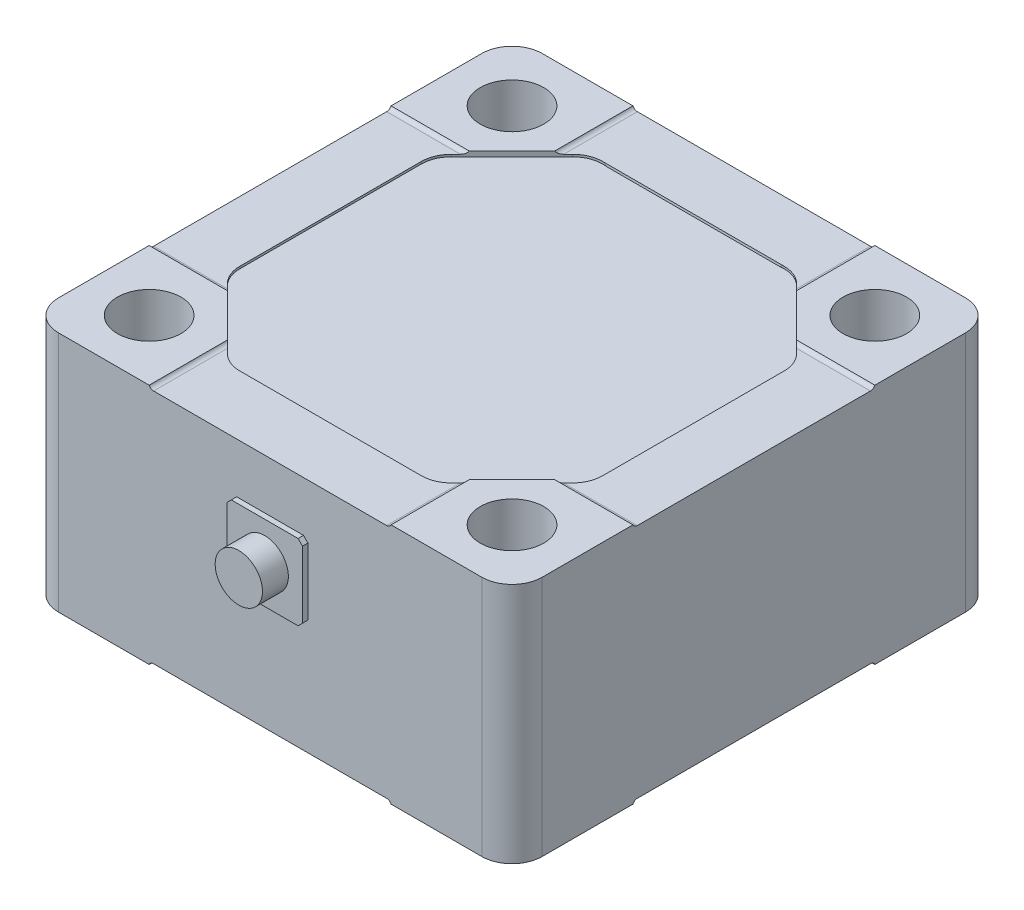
ISO-10303-21;
HEADER;
FILE_DESCRIPTION(('STEP AP214'),'2;1');
FILE_NAME('part.step','',(''),(''),'','','');
FILE_SCHEMA(('AUTOMOTIVE_DESIGN { 1 0 10303 214 1 1 1 1 }'));
ENDSEC;
DATA;
#1=APPLICATION_CONTEXT('core data for automotive mechanical design processes');
#2=APPLICATION_PROTOCOL_DEFINITION('international standard','automotive_design',2000,#1);
#3=PRODUCT_CONTEXT('',#1,'mechanical');
#4=PRODUCT('Part','Part','',(#3));
#5=PRODUCT_RELATED_PRODUCT_CATEGORY('part','',(#4));
#6=PRODUCT_DEFINITION_FORMATION('','',#4);
#7=PRODUCT_DEFINITION_CONTEXT('part definition',#1,'design');
#8=PRODUCT_DEFINITION('design','',#6,#7);
#9=PRODUCT_DEFINITION_SHAPE('','',#8);
#10=(LENGTH_UNIT() NAMED_UNIT(*) SI_UNIT(.MILLI.,.METRE.));
#11=(NAMED_UNIT(*) PLANE_ANGLE_UNIT() SI_UNIT($,.RADIAN.));
#12=(NAMED_UNIT(*) SI_UNIT($,.STERADIAN.) SOLID_ANGLE_UNIT());
#13=UNCERTAINTY_MEASURE_WITH_UNIT(LENGTH_MEASURE(1.E-05),#10,'distance_accuracy_value','');
#14=(GEOMETRIC_REPRESENTATION_CONTEXT(3) GLOBAL_UNCERTAINTY_ASSIGNED_CONTEXT((#13)) GLOBAL_UNIT_ASSIGNED_CONTEXT((#10,
#11,#12)) REPRESENTATION_CONTEXT('',''));
#15=CARTESIAN_POINT('',(0.,0.,0.));
#16=DIRECTION('',(0.,0.,1.));
#17=DIRECTION('',(1.,0.,0.));
#18=AXIS2_PLACEMENT_3D('',#15,#16,#17);
#19=CARTESIAN_POINT('',(0.,47.625,86.0552));
#20=DIRECTION('',(0.,0.,1.));
#21=DIRECTION('',(1.,0.,0.));
#22=AXIS2_PLACEMENT_3D('',#19,#20,#21);
#23=PLANE('',#22);
#24=CARTESIAN_POINT('',(0.,47.625,86.0552));
#25=DIRECTION('',(0.,0.,-1.));
#26=DIRECTION('',(-1.,0.,0.));
#27=AXIS2_PLACEMENT_3D('',#24,#25,#26);
#28=CIRCLE('',#27,7.4549);
#29=CARTESIAN_POINT('',(-7.4549,47.625,86.0552));
#30=VERTEX_POINT('',#29);
#31=EDGE_CURVE('E20',#30,#30,#28,.T.);
#32=ORIENTED_EDGE('',*,*,#31,.F.);
#33=EDGE_LOOP('',(#32));
#34=FACE_BOUND('',#33,.T.);
#35=ADVANCED_FACE('F17',(#34),#23,.T.);
#36=CARTESIAN_POINT('',(0.,47.625,86.0552));
#37=DIRECTION('',(0.,0.,-1.));
#38=DIRECTION('',(-1.,0.,0.));
#39=AXIS2_PLACEMENT_3D('',#36,#37,#38);
#40=CYLINDRICAL_SURFACE('',#39,7.4549);
#41=CARTESIAN_POINT('',(0.,47.625,77.9018));
#42=DIRECTION('',(0.,0.,-1.));
#43=DIRECTION('',(-1.,0.,0.));
#44=AXIS2_PLACEMENT_3D('',#41,#42,#43);
#45=CIRCLE('',#44,7.4549);
#46=CARTESIAN_POINT('',(-7.4549,47.625,77.9018));
#47=VERTEX_POINT('',#46);
#48=EDGE_CURVE('E1731',#47,#47,#45,.T.);
#49=ORIENTED_EDGE('',*,*,#48,.F.);
#50=EDGE_LOOP('',(#49));
#51=FACE_BOUND('',#50,.T.);
#52=ORIENTED_EDGE('',*,*,#31,.T.);
#53=EDGE_LOOP('',(#52));
#54=FACE_BOUND('',#53,.T.);
#55=ADVANCED_FACE('F1736',(#51,#54),#40,.T.);
#56=CARTESIAN_POINT('',(66.675,74.6125,66.675));
#57=DIRECTION('',(0.,1.,0.));
#58=DIRECTION('',(0.,0.,1.));
#59=AXIS2_PLACEMENT_3D('',#56,#57,#58);
#60=PLANE('',#59);
#61=CARTESIAN_POINT('',(47.625,74.6125,28.575));
#62=DIRECTION('',(0.,-1.,0.));
#63=DIRECTION('',(0.,0.,-1.));
#64=AXIS2_PLACEMENT_3D('',#61,#62,#63);
#65=CIRCLE('',#64,9.525);
#66=CARTESIAN_POINT('',(54.3601920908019,74.6125,35.3101920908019));
#67=VERTEX_POINT('',#66);
#68=CARTESIAN_POINT('',(57.15,74.6125,28.575));
#69=VERTEX_POINT('',#68);
#70=EDGE_CURVE('E1009',#67,#69,#65,.F.);
#71=ORIENTED_EDGE('',*,*,#70,.T.);
#72=DIRECTION('',(0.,0.,-1.));
#73=VECTOR('',#72,1.);
#74=CARTESIAN_POINT('',(57.1500000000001,74.6125,-28.5749999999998));
#75=LINE('',#74,#73);
#76=CARTESIAN_POINT('',(57.1500000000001,74.6125,-28.5749999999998));
#77=VERTEX_POINT('',#76);
#78=EDGE_CURVE('E1005',#69,#77,#75,.T.);
#79=ORIENTED_EDGE('',*,*,#78,.T.);
#80=CARTESIAN_POINT('',(47.6250000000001,74.6125,-28.5749999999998));
#81=DIRECTION('',(0.,-1.,0.));
#82=DIRECTION('',(0.,0.,-1.));
#83=AXIS2_PLACEMENT_3D('',#80,#81,#82);
#84=CIRCLE('',#83,9.525);
#85=CARTESIAN_POINT('',(54.360192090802,74.6125,-35.3101920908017));
#86=VERTEX_POINT('',#85);
#87=EDGE_CURVE('E1001',#77,#86,#84,.F.);
#88=ORIENTED_EDGE('',*,*,#87,.T.);
#89=DIRECTION('',(0.707106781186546,0.,0.70710678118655));
#90=VECTOR('',#89,1.);
#91=CARTESIAN_POINT('',(54.360192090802,74.6125,-35.3101920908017));
#92=LINE('',#91,#90);
#93=CARTESIAN_POINT('',(35.310192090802,74.6125,-54.3601920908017));
#94=VERTEX_POINT('',#93);
#95=EDGE_CURVE('E481',#94,#86,#92,.T.);
#96=ORIENTED_EDGE('',*,*,#95,.F.);
#97=CARTESIAN_POINT('',(28.5750000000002,74.6125,-47.6249999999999));
#98=DIRECTION('',(0.,-1.,0.));
#99=DIRECTION('',(0.,0.,-1.));
#100=AXIS2_PLACEMENT_3D('',#97,#98,#99);
#101=CIRCLE('',#100,9.52499999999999);
#102=CARTESIAN_POINT('',(27.2568740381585,74.6125,-57.0583540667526));
#103=VERTEX_POINT('',#102);
#104=EDGE_CURVE('E475',#94,#103,#101,.F.);
#105=ORIENTED_EDGE('',*,*,#104,.T.);
#106=DIRECTION('',(-1.,0.,0.));
#107=VECTOR('',#106,1.);
#108=CARTESIAN_POINT('',(-28.575,74.6125,-57.0583540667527));
#109=LINE('',#108,#107);
#110=CARTESIAN_POINT('',(-27.2568740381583,74.6125,-57.0583540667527));
#111=VERTEX_POINT('',#110);
#112=EDGE_CURVE('E479',#103,#111,#109,.T.);
#113=ORIENTED_EDGE('',*,*,#112,.T.);
#114=CARTESIAN_POINT('',(-28.575,74.6125,-47.625));
#115=DIRECTION('',(0.,-1.,0.));
#116=DIRECTION('',(0.,0.,-1.));
#117=AXIS2_PLACEMENT_3D('',#114,#115,#116);
#118=CIRCLE('',#117,9.52500000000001);
#119=CARTESIAN_POINT('',(-35.3101920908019,74.6125,-54.3601920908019));
#120=VERTEX_POINT('',#119);
#121=EDGE_CURVE('E469',#111,#120,#118,.F.);
#122=ORIENTED_EDGE('',*,*,#121,.T.);
#123=DIRECTION('',(0.707106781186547,0.,-0.707106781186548));
#124=VECTOR('',#123,1.);
#125=CARTESIAN_POINT('',(-35.3101920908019,74.6125,-54.3601920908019));
#126=LINE('',#125,#124);
#127=CARTESIAN_POINT('',(-54.3601920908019,74.6125,-35.3101920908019));
#128=VERTEX_POINT('',#127);
#129=EDGE_CURVE('E499',#128,#120,#126,.T.);
#130=ORIENTED_EDGE('',*,*,#129,.F.);
#131=CARTESIAN_POINT('',(-47.625,74.6125,-28.575));
#132=DIRECTION('',(0.,-1.,0.));
#133=DIRECTION('',(0.,0.,-1.));
#134=AXIS2_PLACEMENT_3D('',#131,#132,#133);
#135=CIRCLE('',#134,9.525);
#136=CARTESIAN_POINT('',(-57.15,74.6125,-28.575));
#137=VERTEX_POINT('',#136);
#138=EDGE_CURVE('E974',#128,#137,#135,.F.);
#139=ORIENTED_EDGE('',*,*,#138,.T.);
#140=DIRECTION('',(0.,0.,1.));
#141=VECTOR('',#140,1.);
#142=CARTESIAN_POINT('',(-57.15,74.6125,-28.575));
#143=LINE('',#142,#141);
#144=CARTESIAN_POINT('',(-57.1500000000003,74.6125,28.5749999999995));
#145=VERTEX_POINT('',#144);
#146=EDGE_CURVE('E976',#137,#145,#143,.T.);
#147=ORIENTED_EDGE('',*,*,#146,.T.);
#148=CARTESIAN_POINT('',(-47.6250000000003,74.6125,28.5749999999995));
#149=DIRECTION('',(0.,-1.,0.));
#150=DIRECTION('',(0.,0.,-1.));
#151=AXIS2_PLACEMENT_3D('',#148,#149,#150);
#152=CIRCLE('',#151,9.52500000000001);
#153=CARTESIAN_POINT('',(-54.3601920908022,74.6125,35.3101920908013));
#154=VERTEX_POINT('',#153);
#155=EDGE_CURVE('E970',#145,#154,#152,.F.);
#156=ORIENTED_EDGE('',*,*,#155,.T.);
#157=DIRECTION('',(-0.70710678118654,0.,-0.707106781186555));
#158=VECTOR('',#157,1.);
#159=CARTESIAN_POINT('',(-54.3601920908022,74.6125,35.3101920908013));
#160=LINE('',#159,#158);
#161=CARTESIAN_POINT('',(-35.3101920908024,74.6125,54.3601920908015));
#162=VERTEX_POINT('',#161);
#163=EDGE_CURVE('E1021',#162,#154,#160,.T.);
#164=ORIENTED_EDGE('',*,*,#163,.F.);
#165=CARTESIAN_POINT('',(-28.5750000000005,74.6125,47.6249999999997));
#166=DIRECTION('',(0.,-1.,0.));
#167=DIRECTION('',(0.,0.,-1.));
#168=AXIS2_PLACEMENT_3D('',#165,#166,#167);
#169=CIRCLE('',#168,9.525);
#170=CARTESIAN_POINT('',(-27.2568740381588,74.6125,57.0583540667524));
#171=VERTEX_POINT('',#170);
#172=EDGE_CURVE('E1018',#162,#171,#169,.F.);
#173=ORIENTED_EDGE('',*,*,#172,.T.);
#174=DIRECTION('',(1.,0.,0.));
#175=VECTOR('',#174,1.);
#176=CARTESIAN_POINT('',(28.575,74.6125,57.0583540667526));
#177=LINE('',#176,#175);
#178=CARTESIAN_POINT('',(27.2568740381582,74.6125,57.0583540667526));
#179=VERTEX_POINT('',#178);
#180=EDGE_CURVE('E1015',#171,#179,#177,.T.);
#181=ORIENTED_EDGE('',*,*,#180,.T.);
#182=CARTESIAN_POINT('',(28.575,74.6125,47.625));
#183=DIRECTION('',(0.,-1.,0.));
#184=DIRECTION('',(0.,0.,-1.));
#185=AXIS2_PLACEMENT_3D('',#182,#183,#184);
#186=CIRCLE('',#185,9.52500000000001);
#187=CARTESIAN_POINT('',(35.3101920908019,74.6125,54.3601920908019));
#188=VERTEX_POINT('',#187);
#189=EDGE_CURVE('E1027',#179,#188,#186,.F.);
#190=ORIENTED_EDGE('',*,*,#189,.T.);
#191=DIRECTION('',(-0.707106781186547,0.,0.707106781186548));
#192=VECTOR('',#191,1.);
#193=CARTESIAN_POINT('',(35.3101920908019,74.6125,54.3601920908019));
#194=LINE('',#193,#192);
#195=EDGE_CURVE('E1014',#67,#188,#194,.T.);
#196=ORIENTED_EDGE('',*,*,#195,.F.);
#197=EDGE_LOOP('',(#71,#79,#88,#96,#105,#113,#122,#130,#139,#147,#156,#164,#173,#181,#190,#196));
#198=FACE_BOUND('',#197,.T.);
#199=ADVANCED_FACE('F478',(#198),#60,.T.);
#200=CARTESIAN_POINT('',(0.,0.,77.9018));
#201=DIRECTION('',(0.,0.,1.));
#202=DIRECTION('',(1.,0.,0.));
#203=AXIS2_PLACEMENT_3D('',#200,#201,#202);
#204=PLANE('',#203);
#205=DIRECTION('',(0.,1.,0.));
#206=VECTOR('',#205,1.);
#207=CARTESIAN_POINT('',(-11.9126,58.1406,77.9018));
#208=LINE('',#207,#206);
#209=CARTESIAN_POINT('',(-11.9126,58.1406,77.9018));
#210=VERTEX_POINT('',#209);
#211=CARTESIAN_POINT('',(-11.9126,37.1094,77.9018));
#212=VERTEX_POINT('',#211);
#213=EDGE_CURVE('E1348',#210,#212,#208,.F.);
#214=ORIENTED_EDGE('',*,*,#213,.T.);
#215=DIRECTION('',(-0.707106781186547,0.707106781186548,0.));
#216=VECTOR('',#215,1.);
#217=CARTESIAN_POINT('',(-10.5156,35.7124,77.9018));
#218=LINE('',#217,#216);
#219=CARTESIAN_POINT('',(-10.5156,35.7124,77.9018));
#220=VERTEX_POINT('',#219);
#221=EDGE_CURVE('E1342',#212,#220,#218,.F.);
#222=ORIENTED_EDGE('',*,*,#221,.T.);
#223=DIRECTION('',(-1.,0.,0.));
#224=VECTOR('',#223,1.);
#225=CARTESIAN_POINT('',(10.5156,35.7124,77.9018));
#226=LINE('',#225,#224);
#227=CARTESIAN_POINT('',(10.5156,35.7124,77.9018));
#228=VERTEX_POINT('',#227);
#229=EDGE_CURVE('E1336',#220,#228,#226,.F.);
#230=ORIENTED_EDGE('',*,*,#229,.T.);
#231=DIRECTION('',(-0.707106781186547,-0.707106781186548,0.));
#232=VECTOR('',#231,1.);
#233=CARTESIAN_POINT('',(11.9126,37.1094,77.9018));
#234=LINE('',#233,#232);
#235=CARTESIAN_POINT('',(11.9126,37.1094,77.9018));
#236=VERTEX_POINT('',#235);
#237=EDGE_CURVE('E1330',#228,#236,#234,.F.);
#238=ORIENTED_EDGE('',*,*,#237,.T.);
#239=DIRECTION('',(0.,-1.,0.));
#240=VECTOR('',#239,1.);
#241=CARTESIAN_POINT('',(11.9126,58.1406,77.9018));
#242=LINE('',#241,#240);
#243=CARTESIAN_POINT('',(11.9126,58.1406,77.9018));
#244=VERTEX_POINT('',#243);
#245=EDGE_CURVE('E969',#236,#244,#242,.F.);
#246=ORIENTED_EDGE('',*,*,#245,.T.);
#247=DIRECTION('',(0.707106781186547,-0.707106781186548,0.));
#248=VECTOR('',#247,1.);
#249=CARTESIAN_POINT('',(11.9126,58.1406,77.9018));
#250=LINE('',#249,#248);
#251=CARTESIAN_POINT('',(10.5156,59.5376,77.9018));
#252=VERTEX_POINT('',#251);
#253=EDGE_CURVE('E1366',#244,#252,#250,.F.);
#254=ORIENTED_EDGE('',*,*,#253,.T.);
#255=DIRECTION('',(1.,0.,0.));
#256=VECTOR('',#255,1.);
#257=CARTESIAN_POINT('',(10.5156,59.5376,77.9018));
#258=LINE('',#257,#256);
#259=CARTESIAN_POINT('',(-10.5156,59.5376,77.9018));
#260=VERTEX_POINT('',#259);
#261=EDGE_CURVE('E1360',#252,#260,#258,.F.);
#262=ORIENTED_EDGE('',*,*,#261,.T.);
#263=DIRECTION('',(0.707106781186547,0.707106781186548,0.));
#264=VECTOR('',#263,1.);
#265=CARTESIAN_POINT('',(-10.5156,59.5376,77.9018));
#266=LINE('',#265,#264);
#267=EDGE_CURVE('E1354',#260,#210,#266,.F.);
#268=ORIENTED_EDGE('',*,*,#267,.T.);
#269=EDGE_LOOP('',(#214,#222,#230,#238,#246,#254,#262,#268));
#270=FACE_BOUND('',#269,.T.);
#271=ORIENTED_EDGE('',*,*,#48,.T.);
#272=EDGE_LOOP('',(#271));
#273=FACE_BOUND('',#272,.T.);
#274=ADVANCED_FACE('F1705',(#270,#273),#204,.T.);
#275=CARTESIAN_POINT('',(-28.5750000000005,76.2,47.6249999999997));
#276=DIRECTION('',(0.,-1.,0.));
#277=DIRECTION('',(0.,0.,-1.));
#278=AXIS2_PLACEMENT_3D('',#275,#276,#277);
#279=CYLINDRICAL_SURFACE('',#278,9.525);
#280=CARTESIAN_POINT('',(-28.5750000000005,75.311,57.1499999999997));
#281=CARTESIAN_POINT('',(-28.5131753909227,75.3113455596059,57.1500165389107));
#282=CARTESIAN_POINT('',(-28.4519424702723,75.3045901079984,57.1494005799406));
#283=CARTESIAN_POINT('',(-28.3328232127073,75.2804473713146,57.1470980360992));
#284=CARTESIAN_POINT('',(-28.2748942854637,75.2632772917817,57.1454332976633));
#285=CARTESIAN_POINT('',(-28.0942293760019,75.1966276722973,57.138682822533));
#286=CARTESIAN_POINT('',(-27.9771399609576,75.133101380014,57.1318890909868));
#287=CARTESIAN_POINT('',(-27.7504012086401,74.9918523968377,57.1149294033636));
#288=CARTESIAN_POINT('',(-27.6409272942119,74.9138911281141,57.1047039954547));
#289=CARTESIAN_POINT('',(-27.4865392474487,74.7967955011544,57.0877227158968));
#290=CARTESIAN_POINT('',(-27.4395992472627,74.7601966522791,57.0822025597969));
#291=CARTESIAN_POINT('',(-27.3473001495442,74.6866595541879,57.0706611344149));
#292=CARTESIAN_POINT('',(-27.3019277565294,74.6497365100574,57.0646494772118));
#293=CARTESIAN_POINT('',(-27.2568740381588,74.6125,57.0583540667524));
#294=B_SPLINE_CURVE_WITH_KNOTS('',3,(#280,#281,#282,#283,#284,#285,#286,#287,#288,#289,#290,
#291,#292,#293),.UNSPECIFIED.,.F.,.F.,(4,2,2,2,2,2,4),(0.,0.184174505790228,0.364633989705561,
0.761638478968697,1.16591009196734,1.34521564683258,1.52160450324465),.UNSPECIFIED.);
#295=CARTESIAN_POINT('',(-28.5750000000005,75.311,57.1499999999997));
#296=VERTEX_POINT('',#295);
#297=EDGE_CURVE('E1017',#296,#171,#294,.T.);
#298=ORIENTED_EDGE('',*,*,#297,.T.);
#299=ORIENTED_EDGE('',*,*,#172,.F.);
#300=DIRECTION('',(0.,1.,0.));
#301=VECTOR('',#300,1.);
#302=CARTESIAN_POINT('',(-35.3101920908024,76.2,54.3601920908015));
#303=LINE('',#302,#301);
#304=CARTESIAN_POINT('',(-35.3101920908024,75.311,54.3601920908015));
#305=VERTEX_POINT('',#304);
#306=EDGE_CURVE('E972',#305,#162,#303,.F.);
#307=ORIENTED_EDGE('',*,*,#306,.F.);
#308=CARTESIAN_POINT('',(-28.5750000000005,75.311,47.6249999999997));
#309=DIRECTION('',(0.,-1.,0.));
#310=DIRECTION('',(0.,0.,-1.));
#311=AXIS2_PLACEMENT_3D('',#308,#309,#310);
#312=CIRCLE('',#311,9.525);
#313=EDGE_CURVE('E962',#305,#296,#312,.F.);
#314=ORIENTED_EDGE('',*,*,#313,.T.);
#315=EDGE_LOOP('',(#298,#299,#307,#314));
#316=FACE_BOUND('',#315,.T.);
#317=ADVANCED_FACE('F1384',(#316),#279,.F.);
#318=CARTESIAN_POINT('',(28.575,76.2,47.666577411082));
#319=DIRECTION('',(1.,0.,0.));
#320=DIRECTION('',(0.,0.,-1.));
#321=AXIS2_PLACEMENT_3D('',#318,#319,#320);
#322=CYLINDRICAL_SURFACE('',#321,9.525);
#323=DIRECTION('',(1.,0.,0.));
#324=VECTOR('',#323,1.);
#325=CARTESIAN_POINT('',(0.,75.311,57.1499999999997));
#326=LINE('',#325,#324);
#327=CARTESIAN_POINT('',(28.575,75.311,57.1499999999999));
#328=VERTEX_POINT('',#327);
#329=EDGE_CURVE('E961',#296,#328,#326,.T.);
#330=ORIENTED_EDGE('',*,*,#329,.T.);
#331=CARTESIAN_POINT('',(28.575,75.3110000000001,57.15));
#332=CARTESIAN_POINT('',(28.5131753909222,75.3113455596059,57.150016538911));
#333=CARTESIAN_POINT('',(28.4519424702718,75.3045901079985,57.1494005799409));
#334=CARTESIAN_POINT('',(28.3328232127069,75.2804473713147,57.1470980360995));
#335=CARTESIAN_POINT('',(28.2748942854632,75.2632772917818,57.1454332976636));
#336=CARTESIAN_POINT('',(28.0942293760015,75.1966276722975,57.1386828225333));
#337=CARTESIAN_POINT('',(27.9771399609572,75.1331013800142,57.1318890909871));
#338=CARTESIAN_POINT('',(27.7504012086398,74.991852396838,57.1149294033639));
#339=CARTESIAN_POINT('',(27.6409272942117,74.9138911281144,57.104703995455));
#340=CARTESIAN_POINT('',(27.4865392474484,74.7967955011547,57.0877227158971));
#341=CARTESIAN_POINT('',(27.4395992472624,74.7601966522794,57.0822025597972));
#342=CARTESIAN_POINT('',(27.3473001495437,74.686659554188,57.0706611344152));
#343=CARTESIAN_POINT('',(27.3019277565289,74.6497365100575,57.0646494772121));
#344=CARTESIAN_POINT('',(27.2568740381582,74.6125,57.0583540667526));
#345=B_SPLINE_CURVE_WITH_KNOTS('',3,(#331,#332,#333,#334,#335,#336,#337,#338,#339,#340,#341,
#342,#343,#344),.UNSPECIFIED.,.F.,.F.,(4,2,2,2,2,2,4),(0.,0.184174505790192,0.364633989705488,
0.761638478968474,1.16591009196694,1.34521564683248,1.52160450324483),.UNSPECIFIED.);
#346=EDGE_CURVE('E1391',#328,#179,#345,.T.);
#347=ORIENTED_EDGE('',*,*,#346,.T.);
#348=ORIENTED_EDGE('',*,*,#180,.F.);
#349=ORIENTED_EDGE('',*,*,#297,.F.);
#350=EDGE_LOOP('',(#330,#347,#348,#349));
#351=FACE_BOUND('',#350,.T.);
#352=ADVANCED_FACE('F1390',(#351),#322,.F.);
#353=CARTESIAN_POINT('',(28.575,76.2,47.625));
#354=DIRECTION('',(0.,-1.,0.));
#355=DIRECTION('',(0.,0.,-1.));
#356=AXIS2_PLACEMENT_3D('',#353,#354,#355);
#357=CYLINDRICAL_SURFACE('',#356,9.52500000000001);
#358=DIRECTION('',(0.,1.,0.));
#359=VECTOR('',#358,1.);
#360=CARTESIAN_POINT('',(35.3101920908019,76.2,54.3601920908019));
#361=LINE('',#360,#359);
#362=CARTESIAN_POINT('',(35.3101920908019,75.311,54.3601920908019));
#363=VERTEX_POINT('',#362);
#364=EDGE_CURVE('E1010',#188,#363,#361,.T.);
#365=ORIENTED_EDGE('',*,*,#364,.F.);
#366=ORIENTED_EDGE('',*,*,#189,.F.);
#367=ORIENTED_EDGE('',*,*,#346,.F.);
#368=CARTESIAN_POINT('',(28.575,75.311,47.625));
#369=DIRECTION('',(0.,-1.,0.));
#370=DIRECTION('',(0.,0.,-1.));
#371=AXIS2_PLACEMENT_3D('',#368,#369,#370);
#372=CIRCLE('',#371,9.52500000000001);
#373=EDGE_CURVE('E957',#328,#363,#372,.F.);
#374=ORIENTED_EDGE('',*,*,#373,.T.);
#375=EDGE_LOOP('',(#365,#366,#367,#374));
#376=FACE_BOUND('',#375,.T.);
#377=ADVANCED_FACE('F1409',(#376),#357,.F.);
#378=CARTESIAN_POINT('',(35.3101920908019,76.2,54.3601920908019));
#379=DIRECTION('',(-0.707106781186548,0.,-0.707106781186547));
#380=DIRECTION('',(-0.707106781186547,0.,0.707106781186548));
#381=AXIS2_PLACEMENT_3D('',#378,#379,#380);
#382=PLANE('',#381);
#383=DIRECTION('',(0.707106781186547,0.,-0.707106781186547));
#384=VECTOR('',#383,1.);
#385=CARTESIAN_POINT('',(35.3101920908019,75.311,54.3601920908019));
#386=LINE('',#385,#384);
#387=CARTESIAN_POINT('',(36.7145935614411,75.311,52.9557906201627));
#388=VERTEX_POINT('',#387);
#389=EDGE_CURVE('E960',#363,#388,#386,.T.);
#390=ORIENTED_EDGE('',*,*,#389,.T.);
#391=CARTESIAN_POINT('',(36.7145935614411,76.835,52.9557906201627));
#392=DIRECTION('',(-0.707106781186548,0.,-0.707106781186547));
#393=DIRECTION('',(-0.707106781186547,0.,0.707106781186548));
#394=AXIS2_PLACEMENT_3D('',#391,#392,#393);
#395=ELLIPSE('',#394,2.1552614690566,1.524);
#396=CARTESIAN_POINT('',(38.0999999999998,76.2,51.5703841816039));
#397=VERTEX_POINT('',#396);
#398=EDGE_CURVE('E952',#388,#397,#395,.F.);
#399=ORIENTED_EDGE('',*,*,#398,.T.);
#400=DIRECTION('',(-0.707106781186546,0.,0.707106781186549));
#401=VECTOR('',#400,1.);
#402=CARTESIAN_POINT('',(51.5703841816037,76.2,38.1));
#403=LINE('',#402,#401);
#404=CARTESIAN_POINT('',(51.5703841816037,76.2,38.1));
#405=VERTEX_POINT('',#404);
#406=EDGE_CURVE('E955',#405,#397,#403,.T.);
#407=ORIENTED_EDGE('',*,*,#406,.F.);
#408=CARTESIAN_POINT('',(52.9557906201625,76.835,36.7145935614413));
#409=DIRECTION('',(-0.707106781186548,0.,-0.707106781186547));
#410=DIRECTION('',(-0.707106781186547,0.,0.707106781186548));
#411=AXIS2_PLACEMENT_3D('',#408,#409,#410);
#412=ELLIPSE('',#411,2.15526146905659,1.524);
#413=CARTESIAN_POINT('',(52.9557906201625,75.311,36.7145935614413));
#414=VERTEX_POINT('',#413);
#415=EDGE_CURVE('E948',#405,#414,#412,.F.);
#416=ORIENTED_EDGE('',*,*,#415,.T.);
#417=DIRECTION('',(0.707106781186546,0.,-0.707106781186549));
#418=VECTOR('',#417,1.);
#419=CARTESIAN_POINT('',(52.9557906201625,75.311,36.7145935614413));
#420=LINE('',#419,#418);
#421=CARTESIAN_POINT('',(54.3601920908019,75.311,35.3101920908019));
#422=VERTEX_POINT('',#421);
#423=EDGE_CURVE('E947',#414,#422,#420,.T.);
#424=ORIENTED_EDGE('',*,*,#423,.T.);
#425=DIRECTION('',(0.,-1.,0.));
#426=VECTOR('',#425,1.);
#427=CARTESIAN_POINT('',(54.3601920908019,76.2,35.3101920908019));
#428=LINE('',#427,#426);
#429=EDGE_CURVE('E1006',#422,#67,#428,.T.);
#430=ORIENTED_EDGE('',*,*,#429,.T.);
#431=ORIENTED_EDGE('',*,*,#195,.T.);
#432=ORIENTED_EDGE('',*,*,#364,.T.);
#433=EDGE_LOOP('',(#390,#399,#407,#416,#424,#430,#431,#432));
#434=FACE_BOUND('',#433,.T.);
#435=ADVANCED_FACE('F1414',(#434),#382,.T.);
#436=CARTESIAN_POINT('',(47.625,76.2,28.575));
#437=DIRECTION('',(0.,-1.,0.));
#438=DIRECTION('',(0.,0.,-1.));
#439=AXIS2_PLACEMENT_3D('',#436,#437,#438);
#440=CYLINDRICAL_SURFACE('',#439,9.525);
#441=DIRECTION('',(0.,1.,0.));
#442=VECTOR('',#441,1.);
#443=CARTESIAN_POINT('',(57.15,66.675,28.575));
#444=LINE('',#443,#442);
#445=CARTESIAN_POINT('',(57.15,75.311,28.575));
#446=VERTEX_POINT('',#445);
#447=EDGE_CURVE('E1002',#446,#69,#444,.F.);
#448=ORIENTED_EDGE('',*,*,#447,.T.);
#449=ORIENTED_EDGE('',*,*,#70,.F.);
#450=ORIENTED_EDGE('',*,*,#429,.F.);
#451=CARTESIAN_POINT('',(47.625,75.311,28.575));
#452=DIRECTION('',(0.,-1.,0.));
#453=DIRECTION('',(0.,0.,-1.));
#454=AXIS2_PLACEMENT_3D('',#451,#452,#453);
#455=CIRCLE('',#454,9.525);
#456=EDGE_CURVE('E944',#422,#446,#455,.F.);
#457=ORIENTED_EDGE('',*,*,#456,.T.);
#458=EDGE_LOOP('',(#448,#449,#450,#457));
#459=FACE_BOUND('',#458,.T.);
#460=ADVANCED_FACE('F1418',(#459),#440,.F.);
#461=CARTESIAN_POINT('',(57.1500000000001,66.675,-28.5749999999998));
#462=DIRECTION('',(1.,0.,0.));
#463=DIRECTION('',(0.,0.,-1.));
#464=AXIS2_PLACEMENT_3D('',#461,#462,#463);
#465=PLANE('',#464);
#466=DIRECTION('',(0.,0.,-1.));
#467=VECTOR('',#466,1.);
#468=CARTESIAN_POINT('',(57.15,75.311,0.));
#469=LINE('',#468,#467);
#470=CARTESIAN_POINT('',(57.15,75.311,-28.5749999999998));
#471=VERTEX_POINT('',#470);
#472=EDGE_CURVE('E943',#446,#471,#469,.T.);
#473=ORIENTED_EDGE('',*,*,#472,.T.);
#474=DIRECTION('',(0.,-1.,0.));
#475=VECTOR('',#474,1.);
#476=CARTESIAN_POINT('',(57.1500000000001,76.2,-28.5749999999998));
#477=LINE('',#476,#475);
#478=EDGE_CURVE('E998',#471,#77,#477,.T.);
#479=ORIENTED_EDGE('',*,*,#478,.T.);
#480=ORIENTED_EDGE('',*,*,#78,.F.);
#481=ORIENTED_EDGE('',*,*,#447,.F.);
#482=EDGE_LOOP('',(#473,#479,#480,#481));
#483=FACE_BOUND('',#482,.T.);
#484=ADVANCED_FACE('F1422',(#483),#465,.F.);
#485=CARTESIAN_POINT('',(47.6250000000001,76.2,-28.5749999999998));
#486=DIRECTION('',(0.,-1.,0.));
#487=DIRECTION('',(0.,0.,-1.));
#488=AXIS2_PLACEMENT_3D('',#485,#486,#487);
#489=CYLINDRICAL_SURFACE('',#488,9.525);
#490=DIRECTION('',(0.,1.,0.));
#491=VECTOR('',#490,1.);
#492=CARTESIAN_POINT('',(54.360192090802,76.2,-35.3101920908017));
#493=LINE('',#492,#491);
#494=CARTESIAN_POINT('',(54.360192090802,75.311,-35.3101920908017));
#495=VERTEX_POINT('',#494);
#496=EDGE_CURVE('E993',#86,#495,#493,.T.);
#497=ORIENTED_EDGE('',*,*,#496,.F.);
#498=ORIENTED_EDGE('',*,*,#87,.F.);
#499=ORIENTED_EDGE('',*,*,#478,.F.);
#500=CARTESIAN_POINT('',(47.6250000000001,75.311,-28.5749999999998));
#501=DIRECTION('',(0.,-1.,0.));
#502=DIRECTION('',(0.,0.,-1.));
#503=AXIS2_PLACEMENT_3D('',#500,#501,#502);
#504=CIRCLE('',#503,9.525);
#505=EDGE_CURVE('E939',#471,#495,#504,.F.);
#506=ORIENTED_EDGE('',*,*,#505,.T.);
#507=EDGE_LOOP('',(#497,#498,#499,#506));
#508=FACE_BOUND('',#507,.T.);
#509=ADVANCED_FACE('F1426',(#508),#489,.F.);
#510=CARTESIAN_POINT('',(54.360192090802,76.2,-35.3101920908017));
#511=DIRECTION('',(-0.70710678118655,0.,0.707106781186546));
#512=DIRECTION('',(0.707106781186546,0.,0.70710678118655));
#513=AXIS2_PLACEMENT_3D('',#510,#511,#512);
#514=PLANE('',#513);
#515=DIRECTION('',(-0.707106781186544,0.,-0.707106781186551));
#516=VECTOR('',#515,1.);
#517=CARTESIAN_POINT('',(54.360192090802,75.311,-35.3101920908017));
#518=LINE('',#517,#516);
#519=CARTESIAN_POINT('',(52.9557906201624,75.311,-36.7145935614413));
#520=VERTEX_POINT('',#519);
#521=EDGE_CURVE('E942',#495,#520,#518,.T.);
#522=ORIENTED_EDGE('',*,*,#521,.T.);
#523=CARTESIAN_POINT('',(52.9557906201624,76.835,-36.7145935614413));
#524=DIRECTION('',(-0.70710678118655,0.,0.707106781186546));
#525=DIRECTION('',(0.707106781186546,0.,0.70710678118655));
#526=AXIS2_PLACEMENT_3D('',#523,#524,#525);
#527=ELLIPSE('',#526,2.15526146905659,1.524);
#528=CARTESIAN_POINT('',(51.5703841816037,76.2,-38.1));
#529=VERTEX_POINT('',#528);
#530=EDGE_CURVE('E935',#520,#529,#527,.F.);
#531=ORIENTED_EDGE('',*,*,#530,.T.);
#532=DIRECTION('',(0.707106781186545,0.,0.70710678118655));
#533=VECTOR('',#532,1.);
#534=CARTESIAN_POINT('',(38.1000000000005,76.2,-51.5703841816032));
#535=LINE('',#534,#533);
#536=CARTESIAN_POINT('',(38.1000000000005,76.2,-51.5703841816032));
#537=VERTEX_POINT('',#536);
#538=EDGE_CURVE('E994',#537,#529,#535,.T.);
#539=ORIENTED_EDGE('',*,*,#538,.F.);
#540=CARTESIAN_POINT('',(36.7145935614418,76.835,-52.955790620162));
#541=DIRECTION('',(-0.70710678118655,0.,0.707106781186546));
#542=DIRECTION('',(0.707106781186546,0.,0.70710678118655));
#543=AXIS2_PLACEMENT_3D('',#540,#541,#542);
#544=ELLIPSE('',#543,2.15526146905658,1.524);
#545=CARTESIAN_POINT('',(36.7145935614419,75.311,-52.9557906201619));
#546=VERTEX_POINT('',#545);
#547=EDGE_CURVE('E931',#537,#546,#544,.F.);
#548=ORIENTED_EDGE('',*,*,#547,.T.);
#549=DIRECTION('',(-0.707106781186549,0.,-0.707106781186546));
#550=VECTOR('',#549,1.);
#551=CARTESIAN_POINT('',(36.7145935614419,75.311,-52.9557906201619));
#552=LINE('',#551,#550);
#553=CARTESIAN_POINT('',(35.310192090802,75.311,-54.3601920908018));
#554=VERTEX_POINT('',#553);
#555=EDGE_CURVE('E930',#546,#554,#552,.T.);
#556=ORIENTED_EDGE('',*,*,#555,.T.);
#557=DIRECTION('',(0.,-1.,0.));
#558=VECTOR('',#557,1.);
#559=CARTESIAN_POINT('',(35.310192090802,76.2,-54.3601920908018));
#560=LINE('',#559,#558);
#561=EDGE_CURVE('E485',#554,#94,#560,.T.);
#562=ORIENTED_EDGE('',*,*,#561,.T.);
#563=ORIENTED_EDGE('',*,*,#95,.T.);
#564=ORIENTED_EDGE('',*,*,#496,.T.);
#565=EDGE_LOOP('',(#522,#531,#539,#548,#556,#562,#563,#564));
#566=FACE_BOUND('',#565,.T.);
#567=ADVANCED_FACE('F1429',(#566),#514,.T.);
#568=CARTESIAN_POINT('',(28.5750000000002,76.2,-47.6249999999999));
#569=DIRECTION('',(0.,-1.,0.));
#570=DIRECTION('',(0.,0.,-1.));
#571=AXIS2_PLACEMENT_3D('',#568,#569,#570);
#572=CYLINDRICAL_SURFACE('',#571,9.52499999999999);
#573=CARTESIAN_POINT('',(28.5750000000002,75.3109999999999,-47.6249999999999));
#574=DIRECTION('',(0.,-1.,0.));
#575=DIRECTION('',(0.,0.,-1.));
#576=AXIS2_PLACEMENT_3D('',#573,#574,#575);
#577=CIRCLE('',#576,9.52499999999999);
#578=CARTESIAN_POINT('',(28.5750000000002,75.3109999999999,-57.1499999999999));
#579=VERTEX_POINT('',#578);
#580=EDGE_CURVE('E497',#554,#579,#577,.F.);
#581=ORIENTED_EDGE('',*,*,#580,.T.);
#582=CARTESIAN_POINT('',(28.5750000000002,75.3109999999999,-57.1499999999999));
#583=CARTESIAN_POINT('',(28.5131753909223,75.3113455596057,-57.1500165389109));
#584=CARTESIAN_POINT('',(28.451942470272,75.3045901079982,-57.1494005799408));
#585=CARTESIAN_POINT('',(28.332823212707,75.2804473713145,-57.1470980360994));
#586=CARTESIAN_POINT('',(28.2748942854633,75.2632772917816,-57.1454332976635));
#587=CARTESIAN_POINT('',(28.0942293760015,75.1966276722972,-57.1386828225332));
#588=CARTESIAN_POINT('',(27.9771399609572,75.1331013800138,-57.131889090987));
#589=CARTESIAN_POINT('',(27.7504012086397,74.9918523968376,-57.1149294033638));
#590=CARTESIAN_POINT('',(27.6409272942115,74.9138911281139,-57.1047039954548));
#591=CARTESIAN_POINT('',(27.4865392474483,74.7967955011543,-57.087722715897));
#592=CARTESIAN_POINT('',(27.4395992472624,74.760196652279,-57.0822025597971));
#593=CARTESIAN_POINT('',(27.3473001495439,74.6866595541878,-57.0706611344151));
#594=CARTESIAN_POINT('',(27.3019277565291,74.6497365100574,-57.064649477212));
#595=CARTESIAN_POINT('',(27.2568740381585,74.6125,-57.0583540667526));
#596=B_SPLINE_CURVE_WITH_KNOTS('',3,(#582,#583,#584,#585,#586,#587,#588,#589,#590,#591,#592,
#593,#594,#595),.UNSPECIFIED.,.F.,.F.,(4,2,2,2,2,2,4),(0.,0.184174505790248,0.364633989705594,
0.761638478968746,1.1659100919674,1.34521564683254,1.52160450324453),.UNSPECIFIED.);
#597=EDGE_CURVE('E490',#579,#103,#596,.T.);
#598=ORIENTED_EDGE('',*,*,#597,.T.);
#599=ORIENTED_EDGE('',*,*,#104,.F.);
#600=ORIENTED_EDGE('',*,*,#561,.F.);
#601=EDGE_LOOP('',(#581,#598,#599,#600));
#602=FACE_BOUND('',#601,.T.);
#603=ADVANCED_FACE('F495',(#602),#572,.F.);
#604=CARTESIAN_POINT('',(-28.575,76.2,-47.666577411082));
#605=DIRECTION('',(-1.,0.,0.));
#606=DIRECTION('',(0.,0.,1.));
#607=AXIS2_PLACEMENT_3D('',#604,#605,#606);
#608=CYLINDRICAL_SURFACE('',#607,9.525);
#609=DIRECTION('',(1.,0.,0.));
#610=VECTOR('',#609,1.);
#611=CARTESIAN_POINT('',(0.,75.311,-57.1499999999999));
#612=LINE('',#611,#610);
#613=CARTESIAN_POINT('',(-28.575,75.3109999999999,-57.1499999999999));
#614=VERTEX_POINT('',#613);
#615=EDGE_CURVE('E928',#579,#614,#612,.F.);
#616=ORIENTED_EDGE('',*,*,#615,.T.);
#617=CARTESIAN_POINT('',(-27.2568740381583,74.6125,-57.0583540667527));
#618=CARTESIAN_POINT('',(-27.3041768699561,74.6515988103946,-57.0649628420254));
#619=CARTESIAN_POINT('',(-27.3518084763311,74.6903294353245,-57.071257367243));
#620=CARTESIAN_POINT('',(-27.4480271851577,74.7668225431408,-57.0832190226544));
#621=CARTESIAN_POINT('',(-27.4966155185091,74.8045836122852,-57.0888852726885));
#622=CARTESIAN_POINT('',(-27.6474752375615,74.9184759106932,-57.1052877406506));
#623=CARTESIAN_POINT('',(-27.7515909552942,74.9924577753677,-57.1149660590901));
#624=CARTESIAN_POINT('',(-27.9257289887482,75.1011545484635,-57.1280736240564));
#625=CARTESIAN_POINT('',(-27.9931208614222,75.1398952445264,-57.1324654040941));
#626=CARTESIAN_POINT('',(-28.1313485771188,75.2086655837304,-57.1399105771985));
#627=CARTESIAN_POINT('',(-28.202122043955,75.2388109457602,-57.1429820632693));
#628=CARTESIAN_POINT('',(-28.3232481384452,75.277277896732,-57.1467920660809));
#629=CARTESIAN_POINT('',(-28.3722802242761,75.289538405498,-57.147969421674));
#630=CARTESIAN_POINT('',(-28.4724372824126,75.3065572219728,-57.1495843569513));
#631=CARTESIAN_POINT('',(-28.5235834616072,75.3111880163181,-57.1500093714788));
#632=CARTESIAN_POINT('',(-28.575,75.3109999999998,-57.15));
#633=B_SPLINE_CURVE_WITH_KNOTS('',3,(#617,#618,#619,#620,#621,#622,#623,#624,#625,#626,#627,
#628,#629,#630,#631,#632),.UNSPECIFIED.,.F.,.F.,(4,2,2,2,2,2,2,4),(0.,0.185137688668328,
0.370531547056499,0.754177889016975,0.987465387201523,1.21744530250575,1.36855468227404,
1.52216480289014),.UNSPECIFIED.);
#634=EDGE_CURVE('E492',#111,#614,#633,.T.);
#635=ORIENTED_EDGE('',*,*,#634,.F.);
#636=ORIENTED_EDGE('',*,*,#112,.F.);
#637=ORIENTED_EDGE('',*,*,#597,.F.);
#638=EDGE_LOOP('',(#616,#635,#636,#637));
#639=FACE_BOUND('',#638,.T.);
#640=ADVANCED_FACE('F489',(#639),#608,.F.);
#641=CARTESIAN_POINT('',(-28.575,76.2,-47.625));
#642=DIRECTION('',(0.,-1.,0.));
#643=DIRECTION('',(0.,0.,-1.));
#644=AXIS2_PLACEMENT_3D('',#641,#642,#643);
#645=CYLINDRICAL_SURFACE('',#644,9.52500000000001);
#646=CARTESIAN_POINT('',(-28.575,75.311,-47.625));
#647=DIRECTION('',(0.,-1.,0.));
#648=DIRECTION('',(0.,0.,-1.));
#649=AXIS2_PLACEMENT_3D('',#646,#647,#648);
#650=CIRCLE('',#649,9.52500000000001);
#651=CARTESIAN_POINT('',(-35.3101920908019,75.311,-54.3601920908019));
#652=VERTEX_POINT('',#651);
#653=EDGE_CURVE('E924',#614,#652,#650,.F.);
#654=ORIENTED_EDGE('',*,*,#653,.T.);
#655=DIRECTION('',(0.,1.,0.));
#656=VECTOR('',#655,1.);
#657=CARTESIAN_POINT('',(-35.3101920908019,76.2,-54.3601920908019));
#658=LINE('',#657,#656);
#659=EDGE_CURVE('E983',#120,#652,#658,.T.);
#660=ORIENTED_EDGE('',*,*,#659,.F.);
#661=ORIENTED_EDGE('',*,*,#121,.F.);
#662=ORIENTED_EDGE('',*,*,#634,.T.);
#663=EDGE_LOOP('',(#654,#660,#661,#662));
#664=FACE_BOUND('',#663,.T.);
#665=ADVANCED_FACE('F516',(#664),#645,.F.);
#666=CARTESIAN_POINT('',(-35.3101920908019,76.2,-54.3601920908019));
#667=DIRECTION('',(0.707106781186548,0.,0.707106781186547));
#668=DIRECTION('',(0.707106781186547,0.,-0.707106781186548));
#669=AXIS2_PLACEMENT_3D('',#666,#667,#668);
#670=PLANE('',#669);
#671=DIRECTION('',(-0.707106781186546,0.,0.707106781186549));
#672=VECTOR('',#671,1.);
#673=CARTESIAN_POINT('',(-35.3101920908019,75.311,-54.3601920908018));
#674=LINE('',#673,#672);
#675=CARTESIAN_POINT('',(-36.7145935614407,75.311,-52.955790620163));
#676=VERTEX_POINT('',#675);
#677=EDGE_CURVE('E927',#652,#676,#674,.T.);
#678=ORIENTED_EDGE('',*,*,#677,.T.);
#679=CARTESIAN_POINT('',(-36.7145935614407,76.835,-52.955790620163));
#680=DIRECTION('',(0.707106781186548,0.,0.707106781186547));
#681=DIRECTION('',(0.707106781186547,0.,-0.707106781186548));
#682=AXIS2_PLACEMENT_3D('',#679,#680,#681);
#683=ELLIPSE('',#682,2.15526146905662,1.524);
#684=CARTESIAN_POINT('',(-38.0999999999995,76.2,-51.5703841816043));
#685=VERTEX_POINT('',#684);
#686=EDGE_CURVE('E919',#676,#685,#683,.F.);
#687=ORIENTED_EDGE('',*,*,#686,.T.);
#688=DIRECTION('',(0.707106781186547,0.,-0.707106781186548));
#689=VECTOR('',#688,1.);
#690=CARTESIAN_POINT('',(-51.5703841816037,76.2,-38.1));
#691=LINE('',#690,#689);
#692=CARTESIAN_POINT('',(-51.5703841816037,76.2,-38.1));
#693=VERTEX_POINT('',#692);
#694=EDGE_CURVE('E922',#693,#685,#691,.T.);
#695=ORIENTED_EDGE('',*,*,#694,.F.);
#696=CARTESIAN_POINT('',(-52.9557906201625,76.835,-36.7145935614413));
#697=DIRECTION('',(0.707106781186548,0.,0.707106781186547));
#698=DIRECTION('',(0.707106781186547,0.,-0.707106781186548));
#699=AXIS2_PLACEMENT_3D('',#696,#697,#698);
#700=ELLIPSE('',#699,2.15526146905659,1.524);
#701=CARTESIAN_POINT('',(-52.9557906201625,75.311,-36.7145935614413));
#702=VERTEX_POINT('',#701);
#703=EDGE_CURVE('E915',#693,#702,#700,.F.);
#704=ORIENTED_EDGE('',*,*,#703,.T.);
#705=DIRECTION('',(-0.707106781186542,0.,0.707106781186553));
#706=VECTOR('',#705,1.);
#707=CARTESIAN_POINT('',(-52.9557906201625,75.311,-36.7145935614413));
#708=LINE('',#707,#706);
#709=CARTESIAN_POINT('',(-54.3601920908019,75.311,-35.3101920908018));
#710=VERTEX_POINT('',#709);
#711=EDGE_CURVE('E914',#702,#710,#708,.T.);
#712=ORIENTED_EDGE('',*,*,#711,.T.);
#713=DIRECTION('',(0.,-1.,0.));
#714=VECTOR('',#713,1.);
#715=CARTESIAN_POINT('',(-54.3601920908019,76.2,-35.3101920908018));
#716=LINE('',#715,#714);
#717=EDGE_CURVE('E977',#710,#128,#716,.T.);
#718=ORIENTED_EDGE('',*,*,#717,.T.);
#719=ORIENTED_EDGE('',*,*,#129,.T.);
#720=ORIENTED_EDGE('',*,*,#659,.T.);
#721=EDGE_LOOP('',(#678,#687,#695,#704,#712,#718,#719,#720));
#722=FACE_BOUND('',#721,.T.);
#723=ADVANCED_FACE('F521',(#722),#670,.T.);
#724=CARTESIAN_POINT('',(-47.625,76.2,-28.575));
#725=DIRECTION('',(0.,-1.,0.));
#726=DIRECTION('',(0.,0.,-1.));
#727=AXIS2_PLACEMENT_3D('',#724,#725,#726);
#728=CYLINDRICAL_SURFACE('',#727,9.525);
#729=DIRECTION('',(0.,1.,0.));
#730=VECTOR('',#729,1.);
#731=CARTESIAN_POINT('',(-57.15,66.675,-28.575));
#732=LINE('',#731,#730);
#733=CARTESIAN_POINT('',(-57.15,75.311,-28.575));
#734=VERTEX_POINT('',#733);
#735=EDGE_CURVE('E980',#734,#137,#732,.F.);
#736=ORIENTED_EDGE('',*,*,#735,.T.);
#737=ORIENTED_EDGE('',*,*,#138,.F.);
#738=ORIENTED_EDGE('',*,*,#717,.F.);
#739=CARTESIAN_POINT('',(-47.625,75.311,-28.575));
#740=DIRECTION('',(0.,-1.,0.));
#741=DIRECTION('',(0.,0.,-1.));
#742=AXIS2_PLACEMENT_3D('',#739,#740,#741);
#743=CIRCLE('',#742,9.525);
#744=EDGE_CURVE('E911',#710,#734,#743,.F.);
#745=ORIENTED_EDGE('',*,*,#744,.T.);
#746=EDGE_LOOP('',(#736,#737,#738,#745));
#747=FACE_BOUND('',#746,.T.);
#748=ADVANCED_FACE('F524',(#747),#728,.F.);
#749=CARTESIAN_POINT('',(-57.15,66.675,-28.575));
#750=DIRECTION('',(-1.,0.,0.));
#751=DIRECTION('',(0.,0.,1.));
#752=AXIS2_PLACEMENT_3D('',#749,#750,#751);
#753=PLANE('',#752);
#754=DIRECTION('',(0.,0.,-1.));
#755=VECTOR('',#754,1.);
#756=CARTESIAN_POINT('',(-57.15,75.311,0.));
#757=LINE('',#756,#755);
#758=CARTESIAN_POINT('',(-57.1500000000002,75.311,28.5749999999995));
#759=VERTEX_POINT('',#758);
#760=EDGE_CURVE('E910',#734,#759,#757,.F.);
#761=ORIENTED_EDGE('',*,*,#760,.T.);
#762=DIRECTION('',(0.,-1.,0.));
#763=VECTOR('',#762,1.);
#764=CARTESIAN_POINT('',(-57.1500000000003,76.2,28.5749999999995));
#765=LINE('',#764,#763);
#766=EDGE_CURVE('E973',#759,#145,#765,.T.);
#767=ORIENTED_EDGE('',*,*,#766,.T.);
#768=ORIENTED_EDGE('',*,*,#146,.F.);
#769=ORIENTED_EDGE('',*,*,#735,.F.);
#770=EDGE_LOOP('',(#761,#767,#768,#769));
#771=FACE_BOUND('',#770,.T.);
#772=ADVANCED_FACE('F528',(#771),#753,.F.);
#773=CARTESIAN_POINT('',(-47.6250000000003,76.2,28.5749999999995));
#774=DIRECTION('',(0.,-1.,0.));
#775=DIRECTION('',(0.,0.,-1.));
#776=AXIS2_PLACEMENT_3D('',#773,#774,#775);
#777=CYLINDRICAL_SURFACE('',#776,9.52500000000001);
#778=DIRECTION('',(0.,1.,0.));
#779=VECTOR('',#778,1.);
#780=CARTESIAN_POINT('',(-54.3601920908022,76.2,35.3101920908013));
#781=LINE('',#780,#779);
#782=CARTESIAN_POINT('',(-54.3601920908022,75.311,35.3101920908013));
#783=VERTEX_POINT('',#782);
#784=EDGE_CURVE('E1022',#154,#783,#781,.T.);
#785=ORIENTED_EDGE('',*,*,#784,.F.);
#786=ORIENTED_EDGE('',*,*,#155,.F.);
#787=ORIENTED_EDGE('',*,*,#766,.F.);
#788=CARTESIAN_POINT('',(-47.6250000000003,75.311,28.5749999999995));
#789=DIRECTION('',(0.,-1.,0.));
#790=DIRECTION('',(0.,0.,-1.));
#791=AXIS2_PLACEMENT_3D('',#788,#789,#790);
#792=CIRCLE('',#791,9.52500000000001);
#793=EDGE_CURVE('E906',#759,#783,#792,.F.);
#794=ORIENTED_EDGE('',*,*,#793,.T.);
#795=EDGE_LOOP('',(#785,#786,#787,#794));
#796=FACE_BOUND('',#795,.T.);
#797=ADVANCED_FACE('F532',(#796),#777,.F.);
#798=CARTESIAN_POINT('',(-54.3601920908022,76.2,35.3101920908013));
#799=DIRECTION('',(0.707106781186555,0.,-0.70710678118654));
#800=DIRECTION('',(-0.70710678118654,0.,-0.707106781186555));
#801=AXIS2_PLACEMENT_3D('',#798,#799,#800);
#802=PLANE('',#801);
#803=DIRECTION('',(0.707106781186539,0.,0.707106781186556));
#804=VECTOR('',#803,1.);
#805=CARTESIAN_POINT('',(-54.3601920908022,75.311,35.3101920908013));
#806=LINE('',#805,#804);
#807=CARTESIAN_POINT('',(-52.9557906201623,75.311,36.7145935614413));
#808=VERTEX_POINT('',#807);
#809=EDGE_CURVE('E909',#783,#808,#806,.T.);
#810=ORIENTED_EDGE('',*,*,#809,.T.);
#811=CARTESIAN_POINT('',(-52.9557906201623,76.835,36.7145935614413));
#812=DIRECTION('',(0.707106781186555,0.,-0.70710678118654));
#813=DIRECTION('',(-0.70710678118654,0.,-0.707106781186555));
#814=AXIS2_PLACEMENT_3D('',#811,#812,#813);
#815=ELLIPSE('',#814,2.15526146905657,1.524);
#816=CARTESIAN_POINT('',(-51.5703841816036,76.2,38.1));
#817=VERTEX_POINT('',#816);
#818=EDGE_CURVE('E901',#808,#817,#815,.F.);
#819=ORIENTED_EDGE('',*,*,#818,.T.);
#820=DIRECTION('',(-0.707106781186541,0.,-0.707106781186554));
#821=VECTOR('',#820,1.);
#822=CARTESIAN_POINT('',(-38.1000000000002,76.2,51.5703841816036));
#823=LINE('',#822,#821);
#824=CARTESIAN_POINT('',(-38.1000000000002,76.2,51.5703841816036));
#825=VERTEX_POINT('',#824);
#826=EDGE_CURVE('E1276',#825,#817,#823,.T.);
#827=ORIENTED_EDGE('',*,*,#826,.F.);
#828=CARTESIAN_POINT('',(-36.7145935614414,76.835,52.9557906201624));
#829=DIRECTION('',(0.707106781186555,0.,-0.70710678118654));
#830=DIRECTION('',(-0.70710678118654,0.,-0.707106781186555));
#831=AXIS2_PLACEMENT_3D('',#828,#829,#830);
#832=ELLIPSE('',#831,2.15526146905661,1.524);
#833=CARTESIAN_POINT('',(-36.7145935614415,75.311,52.9557906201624));
#834=VERTEX_POINT('',#833);
#835=EDGE_CURVE('E966',#825,#834,#832,.F.);
#836=ORIENTED_EDGE('',*,*,#835,.T.);
#837=DIRECTION('',(0.707106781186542,0.,0.707106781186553));
#838=VECTOR('',#837,1.);
#839=CARTESIAN_POINT('',(-36.7145935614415,75.311,52.9557906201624));
#840=LINE('',#839,#838);
#841=EDGE_CURVE('E965',#834,#305,#840,.T.);
#842=ORIENTED_EDGE('',*,*,#841,.T.);
#843=ORIENTED_EDGE('',*,*,#306,.T.);
#844=ORIENTED_EDGE('',*,*,#163,.T.);
#845=ORIENTED_EDGE('',*,*,#784,.T.);
#846=EDGE_LOOP('',(#810,#819,#827,#836,#842,#843,#844,#845));
#847=FACE_BOUND('',#846,.T.);
#848=ADVANCED_FACE('F536',(#847),#802,.T.);
#849=CARTESIAN_POINT('',(11.9126,58.1406,77.9018));
#850=DIRECTION('',(-0.707106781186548,-0.707106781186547,0.));
#851=DIRECTION('',(0.707106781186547,-0.707106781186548,0.));
#852=AXIS2_PLACEMENT_3D('',#849,#850,#851);
#853=PLANE('',#852);
#854=DIRECTION('',(0.,0.,1.));
#855=VECTOR('',#854,1.);
#856=CARTESIAN_POINT('',(11.9126,58.1406,77.9018));
#857=LINE('',#856,#855);
#858=CARTESIAN_POINT('',(11.9126,58.1406,76.2));
#859=VERTEX_POINT('',#858);
#860=EDGE_CURVE('E1327',#244,#859,#857,.F.);
#861=ORIENTED_EDGE('',*,*,#860,.T.);
#862=DIRECTION('',(-0.707106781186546,0.707106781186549,0.));
#863=VECTOR('',#862,1.);
#864=CARTESIAN_POINT('',(11.9126,58.1406,76.2));
#865=LINE('',#864,#863);
#866=CARTESIAN_POINT('',(10.5156,59.5376,76.2));
#867=VERTEX_POINT('',#866);
#868=EDGE_CURVE('E891',#859,#867,#865,.T.);
#869=ORIENTED_EDGE('',*,*,#868,.T.);
#870=DIRECTION('',(0.,0.,-1.));
#871=VECTOR('',#870,1.);
#872=CARTESIAN_POINT('',(10.5156,59.5376,77.9018));
#873=LINE('',#872,#871);
#874=EDGE_CURVE('E1363',#867,#252,#873,.F.);
#875=ORIENTED_EDGE('',*,*,#874,.T.);
#876=ORIENTED_EDGE('',*,*,#253,.F.);
#877=EDGE_LOOP('',(#861,#869,#875,#876));
#878=FACE_BOUND('',#877,.T.);
#879=ADVANCED_FACE('F540',(#878),#853,.F.);
#880=CARTESIAN_POINT('',(10.5156,59.5376,77.9018));
#881=DIRECTION('',(0.,-1.,0.));
#882=DIRECTION('',(0.,0.,-1.));
#883=AXIS2_PLACEMENT_3D('',#880,#881,#882);
#884=PLANE('',#883);
#885=ORIENTED_EDGE('',*,*,#874,.F.);
#886=DIRECTION('',(-1.,0.,0.));
#887=VECTOR('',#886,1.);
#888=CARTESIAN_POINT('',(-66.675,59.5376,76.2));
#889=LINE('',#888,#887);
#890=CARTESIAN_POINT('',(-10.5156,59.5376,76.2));
#891=VERTEX_POINT('',#890);
#892=EDGE_CURVE('E1264',#867,#891,#889,.T.);
#893=ORIENTED_EDGE('',*,*,#892,.T.);
#894=DIRECTION('',(0.,0.,1.));
#895=VECTOR('',#894,1.);
#896=CARTESIAN_POINT('',(-10.5156,59.5376,77.9018));
#897=LINE('',#896,#895);
#898=EDGE_CURVE('E1357',#891,#260,#897,.T.);
#899=ORIENTED_EDGE('',*,*,#898,.T.);
#900=ORIENTED_EDGE('',*,*,#261,.F.);
#901=EDGE_LOOP('',(#885,#893,#899,#900));
#902=FACE_BOUND('',#901,.T.);
#903=ADVANCED_FACE('F544',(#902),#884,.F.);
#904=CARTESIAN_POINT('',(-10.5156,59.5376,77.9018));
#905=DIRECTION('',(0.707106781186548,-0.707106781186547,0.));
#906=DIRECTION('',(0.707106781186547,0.707106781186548,0.));
#907=AXIS2_PLACEMENT_3D('',#904,#905,#906);
#908=PLANE('',#907);
#909=ORIENTED_EDGE('',*,*,#898,.F.);
#910=DIRECTION('',(-0.707106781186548,-0.707106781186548,0.));
#911=VECTOR('',#910,1.);
#912=CARTESIAN_POINT('',(-10.5156,59.5376,76.2));
#913=LINE('',#912,#911);
#914=CARTESIAN_POINT('',(-11.9126,58.1406,76.2));
#915=VERTEX_POINT('',#914);
#916=EDGE_CURVE('E1261',#891,#915,#913,.T.);
#917=ORIENTED_EDGE('',*,*,#916,.T.);
#918=DIRECTION('',(0.,0.,1.));
#919=VECTOR('',#918,1.);
#920=CARTESIAN_POINT('',(-11.9126,58.1406,77.9018));
#921=LINE('',#920,#919);
#922=EDGE_CURVE('E1351',#915,#210,#921,.T.);
#923=ORIENTED_EDGE('',*,*,#922,.T.);
#924=ORIENTED_EDGE('',*,*,#267,.F.);
#925=EDGE_LOOP('',(#909,#917,#923,#924));
#926=FACE_BOUND('',#925,.T.);
#927=ADVANCED_FACE('F548',(#926),#908,.F.);
#928=CARTESIAN_POINT('',(-11.9126,58.1406,77.9018));
#929=DIRECTION('',(1.,0.,0.));
#930=DIRECTION('',(0.,1.,0.));
#931=AXIS2_PLACEMENT_3D('',#928,#929,#930);
#932=PLANE('',#931);
#933=ORIENTED_EDGE('',*,*,#922,.F.);
#934=DIRECTION('',(0.,1.,0.));
#935=VECTOR('',#934,1.);
#936=CARTESIAN_POINT('',(-11.9126,76.2,76.2));
#937=LINE('',#936,#935);
#938=CARTESIAN_POINT('',(-11.9126,37.1094,76.2));
#939=VERTEX_POINT('',#938);
#940=EDGE_CURVE('E1258',#915,#939,#937,.F.);
#941=ORIENTED_EDGE('',*,*,#940,.T.);
#942=DIRECTION('',(0.,0.,1.));
#943=VECTOR('',#942,1.);
#944=CARTESIAN_POINT('',(-11.9126,37.1094,77.9018));
#945=LINE('',#944,#943);
#946=EDGE_CURVE('E1345',#939,#212,#945,.T.);
#947=ORIENTED_EDGE('',*,*,#946,.T.);
#948=ORIENTED_EDGE('',*,*,#213,.F.);
#949=EDGE_LOOP('',(#933,#941,#947,#948));
#950=FACE_BOUND('',#949,.T.);
#951=ADVANCED_FACE('F552',(#950),#932,.F.);
#952=CARTESIAN_POINT('',(-10.5156,35.7124,77.9018));
#953=DIRECTION('',(0.707106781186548,0.707106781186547,0.));
#954=DIRECTION('',(-0.707106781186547,0.707106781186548,0.));
#955=AXIS2_PLACEMENT_3D('',#952,#953,#954);
#956=PLANE('',#955);
#957=ORIENTED_EDGE('',*,*,#946,.F.);
#958=DIRECTION('',(0.707106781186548,-0.707106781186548,0.));
#959=VECTOR('',#958,1.);
#960=CARTESIAN_POINT('',(-11.9126,37.1094,76.2));
#961=LINE('',#960,#959);
#962=CARTESIAN_POINT('',(-10.5156,35.7124,76.2));
#963=VERTEX_POINT('',#962);
#964=EDGE_CURVE('E1255',#939,#963,#961,.T.);
#965=ORIENTED_EDGE('',*,*,#964,.T.);
#966=DIRECTION('',(0.,0.,1.));
#967=VECTOR('',#966,1.);
#968=CARTESIAN_POINT('',(-10.5156,35.7124,77.9018));
#969=LINE('',#968,#967);
#970=EDGE_CURVE('E1339',#963,#220,#969,.T.);
#971=ORIENTED_EDGE('',*,*,#970,.T.);
#972=ORIENTED_EDGE('',*,*,#221,.F.);
#973=EDGE_LOOP('',(#957,#965,#971,#972));
#974=FACE_BOUND('',#973,.T.);
#975=ADVANCED_FACE('F556',(#974),#956,.F.);
#976=CARTESIAN_POINT('',(10.5156,35.7124,77.9018));
#977=DIRECTION('',(0.,1.,0.));
#978=DIRECTION('',(-1.,0.,0.));
#979=AXIS2_PLACEMENT_3D('',#976,#977,#978);
#980=PLANE('',#979);
#981=ORIENTED_EDGE('',*,*,#970,.F.);
#982=DIRECTION('',(-1.,0.,0.));
#983=VECTOR('',#982,1.);
#984=CARTESIAN_POINT('',(-66.675,35.7124,76.2));
#985=LINE('',#984,#983);
#986=CARTESIAN_POINT('',(10.5156,35.7124,76.2));
#987=VERTEX_POINT('',#986);
#988=EDGE_CURVE('E1252',#963,#987,#985,.F.);
#989=ORIENTED_EDGE('',*,*,#988,.T.);
#990=DIRECTION('',(0.,0.,1.));
#991=VECTOR('',#990,1.);
#992=CARTESIAN_POINT('',(10.5156,35.7124,77.9018));
#993=LINE('',#992,#991);
#994=EDGE_CURVE('E1333',#987,#228,#993,.T.);
#995=ORIENTED_EDGE('',*,*,#994,.T.);
#996=ORIENTED_EDGE('',*,*,#229,.F.);
#997=EDGE_LOOP('',(#981,#989,#995,#996));
#998=FACE_BOUND('',#997,.T.);
#999=ADVANCED_FACE('F560',(#998),#980,.F.);
#1000=CARTESIAN_POINT('',(11.9126,37.1094,77.9018));
#1001=DIRECTION('',(-0.707106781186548,0.707106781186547,0.));
#1002=DIRECTION('',(-0.707106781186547,-0.707106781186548,0.));
#1003=AXIS2_PLACEMENT_3D('',#1000,#1001,#1002);
#1004=PLANE('',#1003);
#1005=ORIENTED_EDGE('',*,*,#994,.F.);
#1006=DIRECTION('',(0.707106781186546,0.707106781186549,0.));
#1007=VECTOR('',#1006,1.);
#1008=CARTESIAN_POINT('',(10.5156,35.7124,76.2));
#1009=LINE('',#1008,#1007);
#1010=CARTESIAN_POINT('',(11.9126,37.1094,76.2));
#1011=VERTEX_POINT('',#1010);
#1012=EDGE_CURVE('E1249',#987,#1011,#1009,.T.);
#1013=ORIENTED_EDGE('',*,*,#1012,.T.);
#1014=DIRECTION('',(0.,0.,1.));
#1015=VECTOR('',#1014,1.);
#1016=CARTESIAN_POINT('',(11.9126,37.1094,77.9018));
#1017=LINE('',#1016,#1015);
#1018=EDGE_CURVE('E1324',#1011,#236,#1017,.T.);
#1019=ORIENTED_EDGE('',*,*,#1018,.T.);
#1020=ORIENTED_EDGE('',*,*,#237,.F.);
#1021=EDGE_LOOP('',(#1005,#1013,#1019,#1020));
#1022=FACE_BOUND('',#1021,.T.);
#1023=ADVANCED_FACE('F564',(#1022),#1004,.F.);
#1024=CARTESIAN_POINT('',(11.9126,58.1406,77.9018));
#1025=DIRECTION('',(-1.,0.,0.));
#1026=DIRECTION('',(0.,-1.,0.));
#1027=AXIS2_PLACEMENT_3D('',#1024,#1025,#1026);
#1028=PLANE('',#1027);
#1029=ORIENTED_EDGE('',*,*,#1018,.F.);
#1030=DIRECTION('',(0.,1.,0.));
#1031=VECTOR('',#1030,1.);
#1032=CARTESIAN_POINT('',(11.9126,76.2,76.2));
#1033=LINE('',#1032,#1031);
#1034=EDGE_CURVE('E1246',#1011,#859,#1033,.T.);
#1035=ORIENTED_EDGE('',*,*,#1034,.T.);
#1036=ORIENTED_EDGE('',*,*,#860,.F.);
#1037=ORIENTED_EDGE('',*,*,#245,.F.);
#1038=EDGE_LOOP('',(#1029,#1035,#1036,#1037));
#1039=FACE_BOUND('',#1038,.T.);
#1040=ADVANCED_FACE('F568',(#1039),#1028,.F.);
#1041=CARTESIAN_POINT('',(-36.7145935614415,76.835,76.1999999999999));
#1042=DIRECTION('',(0.,0.,-1.));
#1043=DIRECTION('',(-1.,0.,0.));
#1044=AXIS2_PLACEMENT_3D('',#1041,#1042,#1043);
#1045=CYLINDRICAL_SURFACE('',#1044,1.524);
#1046=DIRECTION('',(0.,0.,-1.));
#1047=VECTOR('',#1046,1.);
#1048=CARTESIAN_POINT('',(-36.7145935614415,75.311,0.));
#1049=LINE('',#1048,#1047);
#1050=CARTESIAN_POINT('',(-36.7145935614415,75.311,76.2));
#1051=VERTEX_POINT('',#1050);
#1052=EDGE_CURVE('E968',#1051,#834,#1049,.T.);
#1053=ORIENTED_EDGE('',*,*,#1052,.T.);
#1054=ORIENTED_EDGE('',*,*,#835,.F.);
#1055=DIRECTION('',(0.,0.,1.));
#1056=VECTOR('',#1055,1.);
#1057=CARTESIAN_POINT('',(-38.1000000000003,76.2,66.675));
#1058=LINE('',#1057,#1056);
#1059=CARTESIAN_POINT('',(-38.1000000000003,76.2,76.2));
#1060=VERTEX_POINT('',#1059);
#1061=EDGE_CURVE('E904',#1060,#825,#1058,.F.);
#1062=ORIENTED_EDGE('',*,*,#1061,.F.);
#1063=CARTESIAN_POINT('',(-36.7145935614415,76.835,76.2));
#1064=DIRECTION('',(0.,0.,-1.));
#1065=DIRECTION('',(-1.,0.,0.));
#1066=AXIS2_PLACEMENT_3D('',#1063,#1064,#1065);
#1067=CIRCLE('',#1066,1.524);
#1068=EDGE_CURVE('E885',#1060,#1051,#1067,.F.);
#1069=ORIENTED_EDGE('',*,*,#1068,.T.);
#1070=EDGE_LOOP('',(#1053,#1054,#1062,#1069));
#1071=FACE_BOUND('',#1070,.T.);
#1072=ADVANCED_FACE('F572',(#1071),#1045,.F.);
#1073=CARTESIAN_POINT('',(0.,75.311,0.));
#1074=DIRECTION('',(0.,-1.,0.));
#1075=DIRECTION('',(0.,0.,-1.));
#1076=AXIS2_PLACEMENT_3D('',#1073,#1074,#1075);
#1077=PLANE('',#1076);
#1078=DIRECTION('',(0.,0.,1.));
#1079=VECTOR('',#1078,1.);
#1080=CARTESIAN_POINT('',(36.714593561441,75.311,76.2000000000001));
#1081=LINE('',#1080,#1079);
#1082=CARTESIAN_POINT('',(36.714593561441,75.311,76.2));
#1083=VERTEX_POINT('',#1082);
#1084=EDGE_CURVE('E956',#1083,#388,#1081,.F.);
#1085=ORIENTED_EDGE('',*,*,#1084,.T.);
#1086=ORIENTED_EDGE('',*,*,#389,.F.);
#1087=ORIENTED_EDGE('',*,*,#373,.F.);
#1088=ORIENTED_EDGE('',*,*,#329,.F.);
#1089=ORIENTED_EDGE('',*,*,#313,.F.);
#1090=ORIENTED_EDGE('',*,*,#841,.F.);
#1091=ORIENTED_EDGE('',*,*,#1052,.F.);
#1092=DIRECTION('',(-1.,0.,0.));
#1093=VECTOR('',#1092,1.);
#1094=CARTESIAN_POINT('',(-66.675,75.311,76.2));
#1095=LINE('',#1094,#1093);
#1096=EDGE_CURVE('E884',#1051,#1083,#1095,.F.);
#1097=ORIENTED_EDGE('',*,*,#1096,.T.);
#1098=EDGE_LOOP('',(#1085,#1086,#1087,#1088,#1089,#1090,#1091,#1097));
#1099=FACE_BOUND('',#1098,.T.);
#1100=ADVANCED_FACE('F576',(#1099),#1077,.F.);
#1101=CARTESIAN_POINT('',(36.714593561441,76.835,76.2000000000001));
#1102=DIRECTION('',(0.,0.,1.));
#1103=DIRECTION('',(1.,0.,0.));
#1104=AXIS2_PLACEMENT_3D('',#1101,#1102,#1103);
#1105=CYLINDRICAL_SURFACE('',#1104,1.524);
#1106=ORIENTED_EDGE('',*,*,#1084,.F.);
#1107=CARTESIAN_POINT('',(36.714593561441,76.835,76.2));
#1108=DIRECTION('',(0.,0.,1.));
#1109=DIRECTION('',(1.,0.,0.));
#1110=AXIS2_PLACEMENT_3D('',#1107,#1108,#1109);
#1111=CIRCLE('',#1110,1.524);
#1112=CARTESIAN_POINT('',(38.0999999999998,76.2,76.2));
#1113=VERTEX_POINT('',#1112);
#1114=EDGE_CURVE('E880',#1083,#1113,#1111,.T.);
#1115=ORIENTED_EDGE('',*,*,#1114,.T.);
#1116=DIRECTION('',(0.,0.,1.));
#1117=VECTOR('',#1116,1.);
#1118=CARTESIAN_POINT('',(38.0999999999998,76.2,66.675));
#1119=LINE('',#1118,#1117);
#1120=EDGE_CURVE('E1012',#397,#1113,#1119,.T.);
#1121=ORIENTED_EDGE('',*,*,#1120,.F.);
#1122=ORIENTED_EDGE('',*,*,#398,.F.);
#1123=EDGE_LOOP('',(#1106,#1115,#1121,#1122));
#1124=FACE_BOUND('',#1123,.T.);
#1125=ADVANCED_FACE('F580',(#1124),#1105,.F.);
#1126=CARTESIAN_POINT('',(-66.675,76.2,66.675));
#1127=DIRECTION('',(0.,1.,0.));
#1128=DIRECTION('',(0.,0.,1.));
#1129=AXIS2_PLACEMENT_3D('',#1126,#1127,#1128);
#1130=PLANE('',#1129);
#1131=CARTESIAN_POINT('',(57.15,76.2,57.15));
#1132=DIRECTION('',(0.,-1.,0.));
#1133=DIRECTION('',(0.,0.,-1.));
#1134=AXIS2_PLACEMENT_3D('',#1131,#1132,#1133);
#1135=CIRCLE('',#1134,9.99999999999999);
#1136=CARTESIAN_POINT('',(57.15,76.2,47.15));
#1137=VERTEX_POINT('',#1136);
#1138=EDGE_CURVE('E892',#1137,#1137,#1135,.T.);
#1139=ORIENTED_EDGE('',*,*,#1138,.T.);
#1140=EDGE_LOOP('',(#1139));
#1141=FACE_BOUND('',#1140,.T.);
#1142=ORIENTED_EDGE('',*,*,#1120,.T.);
#1143=DIRECTION('',(-1.,0.,0.));
#1144=VECTOR('',#1143,1.);
#1145=CARTESIAN_POINT('',(-66.675,76.2,76.2));
#1146=LINE('',#1145,#1144);
#1147=CARTESIAN_POINT('',(66.675,76.2,76.2));
#1148=VERTEX_POINT('',#1147);
#1149=EDGE_CURVE('E883',#1113,#1148,#1146,.F.);
#1150=ORIENTED_EDGE('',*,*,#1149,.T.);
#1151=CARTESIAN_POINT('',(66.675,76.2,66.675));
#1152=DIRECTION('',(0.,-1.,0.));
#1153=DIRECTION('',(0.,0.,-1.));
#1154=AXIS2_PLACEMENT_3D('',#1151,#1152,#1153);
#1155=CIRCLE('',#1154,9.52499999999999);
#1156=CARTESIAN_POINT('',(76.2,76.2,66.675));
#1157=VERTEX_POINT('',#1156);
#1158=EDGE_CURVE('E889',#1157,#1148,#1155,.T.);
#1159=ORIENTED_EDGE('',*,*,#1158,.F.);
#1160=DIRECTION('',(0.,0.,1.));
#1161=VECTOR('',#1160,1.);
#1162=CARTESIAN_POINT('',(76.2,76.2,-66.675));
#1163=LINE('',#1162,#1161);
#1164=CARTESIAN_POINT('',(76.2,76.2,38.1));
#1165=VERTEX_POINT('',#1164);
#1166=EDGE_CURVE('E872',#1157,#1165,#1163,.F.);
#1167=ORIENTED_EDGE('',*,*,#1166,.T.);
#1168=DIRECTION('',(-1.,0.,0.));
#1169=VECTOR('',#1168,1.);
#1170=CARTESIAN_POINT('',(76.2,76.2,38.1));
#1171=LINE('',#1170,#1169);
#1172=EDGE_CURVE('E951',#1165,#405,#1171,.T.);
#1173=ORIENTED_EDGE('',*,*,#1172,.T.);
#1174=ORIENTED_EDGE('',*,*,#406,.T.);
#1175=EDGE_LOOP('',(#1142,#1150,#1159,#1167,#1173,#1174));
#1176=FACE_BOUND('',#1175,.T.);
#1177=ADVANCED_FACE('F584',(#1141,#1176),#1130,.T.);
#1178=CARTESIAN_POINT('',(76.2,76.835,36.7145935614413));
#1179=DIRECTION('',(-1.,0.,0.));
#1180=DIRECTION('',(0.,0.,1.));
#1181=AXIS2_PLACEMENT_3D('',#1178,#1179,#1180);
#1182=CYLINDRICAL_SURFACE('',#1181,1.524);
#1183=DIRECTION('',(1.,0.,0.));
#1184=VECTOR('',#1183,1.);
#1185=CARTESIAN_POINT('',(0.,75.311,36.7145935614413));
#1186=LINE('',#1185,#1184);
#1187=CARTESIAN_POINT('',(76.2,75.311,36.7145935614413));
#1188=VERTEX_POINT('',#1187);
#1189=EDGE_CURVE('E950',#1188,#414,#1186,.F.);
#1190=ORIENTED_EDGE('',*,*,#1189,.T.);
#1191=ORIENTED_EDGE('',*,*,#415,.F.);
#1192=ORIENTED_EDGE('',*,*,#1172,.F.);
#1193=CARTESIAN_POINT('',(76.2,76.835,36.7145935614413));
#1194=DIRECTION('',(-1.,0.,0.));
#1195=DIRECTION('',(0.,0.,1.));
#1196=AXIS2_PLACEMENT_3D('',#1193,#1194,#1195);
#1197=CIRCLE('',#1196,1.524);
#1198=EDGE_CURVE('E869',#1165,#1188,#1197,.F.);
#1199=ORIENTED_EDGE('',*,*,#1198,.T.);
#1200=EDGE_LOOP('',(#1190,#1191,#1192,#1199));
#1201=FACE_BOUND('',#1200,.T.);
#1202=ADVANCED_FACE('F588',(#1201),#1182,.F.);
#1203=CARTESIAN_POINT('',(0.,75.311,0.));
#1204=DIRECTION('',(0.,-1.,0.));
#1205=DIRECTION('',(0.,0.,-1.));
#1206=AXIS2_PLACEMENT_3D('',#1203,#1204,#1205);
#1207=PLANE('',#1206);
#1208=DIRECTION('',(1.,0.,0.));
#1209=VECTOR('',#1208,1.);
#1210=CARTESIAN_POINT('',(76.2,75.311,-36.7145935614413));
#1211=LINE('',#1210,#1209);
#1212=CARTESIAN_POINT('',(76.2,75.311,-36.7145935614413));
#1213=VERTEX_POINT('',#1212);
#1214=EDGE_CURVE('E938',#1213,#520,#1211,.F.);
#1215=ORIENTED_EDGE('',*,*,#1214,.T.);
#1216=ORIENTED_EDGE('',*,*,#521,.F.);
#1217=ORIENTED_EDGE('',*,*,#505,.F.);
#1218=ORIENTED_EDGE('',*,*,#472,.F.);
#1219=ORIENTED_EDGE('',*,*,#456,.F.);
#1220=ORIENTED_EDGE('',*,*,#423,.F.);
#1221=ORIENTED_EDGE('',*,*,#1189,.F.);
#1222=DIRECTION('',(0.,0.,1.));
#1223=VECTOR('',#1222,1.);
#1224=CARTESIAN_POINT('',(76.2,75.311,-66.675));
#1225=LINE('',#1224,#1223);
#1226=EDGE_CURVE('E868',#1188,#1213,#1225,.F.);
#1227=ORIENTED_EDGE('',*,*,#1226,.T.);
#1228=EDGE_LOOP('',(#1215,#1216,#1217,#1218,#1219,#1220,#1221,#1227));
#1229=FACE_BOUND('',#1228,.T.);
#1230=ADVANCED_FACE('F592',(#1229),#1207,.F.);
#1231=CARTESIAN_POINT('',(76.2,76.835,-36.7145935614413));
#1232=DIRECTION('',(1.,0.,0.));
#1233=DIRECTION('',(0.,0.,-1.));
#1234=AXIS2_PLACEMENT_3D('',#1231,#1232,#1233);
#1235=CYLINDRICAL_SURFACE('',#1234,1.524);
#1236=ORIENTED_EDGE('',*,*,#1214,.F.);
#1237=CARTESIAN_POINT('',(76.2,76.835,-36.7145935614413));
#1238=DIRECTION('',(1.,0.,0.));
#1239=DIRECTION('',(0.,0.,-1.));
#1240=AXIS2_PLACEMENT_3D('',#1237,#1238,#1239);
#1241=CIRCLE('',#1240,1.524);
#1242=CARTESIAN_POINT('',(76.2,76.2,-38.1));
#1243=VERTEX_POINT('',#1242);
#1244=EDGE_CURVE('E864',#1213,#1243,#1241,.T.);
#1245=ORIENTED_EDGE('',*,*,#1244,.T.);
#1246=DIRECTION('',(1.,0.,0.));
#1247=VECTOR('',#1246,1.);
#1248=CARTESIAN_POINT('',(-66.675,76.2,-38.1));
#1249=LINE('',#1248,#1247);
#1250=EDGE_CURVE('E937',#529,#1243,#1249,.T.);
#1251=ORIENTED_EDGE('',*,*,#1250,.F.);
#1252=ORIENTED_EDGE('',*,*,#530,.F.);
#1253=EDGE_LOOP('',(#1236,#1245,#1251,#1252));
#1254=FACE_BOUND('',#1253,.T.);
#1255=ADVANCED_FACE('F596',(#1254),#1235,.F.);
#1256=CARTESIAN_POINT('',(-66.675,76.2,66.675));
#1257=DIRECTION('',(0.,1.,0.));
#1258=DIRECTION('',(0.,0.,1.));
#1259=AXIS2_PLACEMENT_3D('',#1256,#1257,#1258);
#1260=PLANE('',#1259);
#1261=CARTESIAN_POINT('',(57.15,76.2,-57.15));
#1262=DIRECTION('',(0.,-1.,0.));
#1263=DIRECTION('',(0.,0.,-1.));
#1264=AXIS2_PLACEMENT_3D('',#1261,#1262,#1263);
#1265=CIRCLE('',#1264,9.99999999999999);
#1266=CARTESIAN_POINT('',(57.15,76.2,-67.15));
#1267=VERTEX_POINT('',#1266);
#1268=EDGE_CURVE('E876',#1267,#1267,#1265,.T.);
#1269=ORIENTED_EDGE('',*,*,#1268,.T.);
#1270=EDGE_LOOP('',(#1269));
#1271=FACE_BOUND('',#1270,.T.);
#1272=DIRECTION('',(0.,0.,1.));
#1273=VECTOR('',#1272,1.);
#1274=CARTESIAN_POINT('',(38.1000000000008,76.2,-76.1999999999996));
#1275=LINE('',#1274,#1273);
#1276=CARTESIAN_POINT('',(38.1000000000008,76.2,-76.2));
#1277=VERTEX_POINT('',#1276);
#1278=EDGE_CURVE('E934',#1277,#537,#1275,.T.);
#1279=ORIENTED_EDGE('',*,*,#1278,.T.);
#1280=ORIENTED_EDGE('',*,*,#538,.T.);
#1281=ORIENTED_EDGE('',*,*,#1250,.T.);
#1282=DIRECTION('',(0.,0.,1.));
#1283=VECTOR('',#1282,1.);
#1284=CARTESIAN_POINT('',(76.2,76.2,-66.675));
#1285=LINE('',#1284,#1283);
#1286=CARTESIAN_POINT('',(76.2,76.2,-66.675));
#1287=VERTEX_POINT('',#1286);
#1288=EDGE_CURVE('E867',#1243,#1287,#1285,.F.);
#1289=ORIENTED_EDGE('',*,*,#1288,.T.);
#1290=CARTESIAN_POINT('',(66.675,76.2,-66.675));
#1291=DIRECTION('',(0.,-1.,0.));
#1292=DIRECTION('',(0.,0.,-1.));
#1293=AXIS2_PLACEMENT_3D('',#1290,#1291,#1292);
#1294=CIRCLE('',#1293,9.52500000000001);
#1295=CARTESIAN_POINT('',(66.675,76.2,-76.2));
#1296=VERTEX_POINT('',#1295);
#1297=EDGE_CURVE('E873',#1296,#1287,#1294,.T.);
#1298=ORIENTED_EDGE('',*,*,#1297,.F.);
#1299=DIRECTION('',(1.,0.,0.));
#1300=VECTOR('',#1299,1.);
#1301=CARTESIAN_POINT('',(-66.675,76.2,-76.2));
#1302=LINE('',#1301,#1300);
#1303=EDGE_CURVE('E856',#1296,#1277,#1302,.F.);
#1304=ORIENTED_EDGE('',*,*,#1303,.T.);
#1305=EDGE_LOOP('',(#1279,#1280,#1281,#1289,#1298,#1304));
#1306=FACE_BOUND('',#1305,.T.);
#1307=ADVANCED_FACE('F600',(#1271,#1306),#1260,.T.);
#1308=CARTESIAN_POINT('',(36.7145935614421,76.835,-76.1999999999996));
#1309=DIRECTION('',(0.,0.,1.));
#1310=DIRECTION('',(1.,0.,0.));
#1311=AXIS2_PLACEMENT_3D('',#1308,#1309,#1310);
#1312=CYLINDRICAL_SURFACE('',#1311,1.524);
#1313=DIRECTION('',(0.,0.,-1.));
#1314=VECTOR('',#1313,1.);
#1315=CARTESIAN_POINT('',(36.7145935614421,75.311,0.));
#1316=LINE('',#1315,#1314);
#1317=CARTESIAN_POINT('',(36.7145935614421,75.311,-76.2));
#1318=VERTEX_POINT('',#1317);
#1319=EDGE_CURVE('E933',#1318,#546,#1316,.F.);
#1320=ORIENTED_EDGE('',*,*,#1319,.T.);
#1321=ORIENTED_EDGE('',*,*,#547,.F.);
#1322=ORIENTED_EDGE('',*,*,#1278,.F.);
#1323=CARTESIAN_POINT('',(36.7145935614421,76.835,-76.1999999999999));
#1324=DIRECTION('',(0.,0.,1.));
#1325=DIRECTION('',(1.,0.,0.));
#1326=AXIS2_PLACEMENT_3D('',#1323,#1324,#1325);
#1327=CIRCLE('',#1326,1.524);
#1328=EDGE_CURVE('E853',#1277,#1318,#1327,.F.);
#1329=ORIENTED_EDGE('',*,*,#1328,.T.);
#1330=EDGE_LOOP('',(#1320,#1321,#1322,#1329));
#1331=FACE_BOUND('',#1330,.T.);
#1332=ADVANCED_FACE('F604',(#1331),#1312,.F.);
#1333=CARTESIAN_POINT('',(0.,75.311,0.));
#1334=DIRECTION('',(0.,-1.,0.));
#1335=DIRECTION('',(0.,0.,-1.));
#1336=AXIS2_PLACEMENT_3D('',#1333,#1334,#1335);
#1337=PLANE('',#1336);
#1338=DIRECTION('',(0.,0.,-1.));
#1339=VECTOR('',#1338,1.);
#1340=CARTESIAN_POINT('',(-36.7145935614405,75.311,-76.2000000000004));
#1341=LINE('',#1340,#1339);
#1342=CARTESIAN_POINT('',(-36.7145935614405,75.311,-76.2));
#1343=VERTEX_POINT('',#1342);
#1344=EDGE_CURVE('E923',#1343,#676,#1341,.F.);
#1345=ORIENTED_EDGE('',*,*,#1344,.T.);
#1346=ORIENTED_EDGE('',*,*,#677,.F.);
#1347=ORIENTED_EDGE('',*,*,#653,.F.);
#1348=ORIENTED_EDGE('',*,*,#615,.F.);
#1349=ORIENTED_EDGE('',*,*,#580,.F.);
#1350=ORIENTED_EDGE('',*,*,#555,.F.);
#1351=ORIENTED_EDGE('',*,*,#1319,.F.);
#1352=DIRECTION('',(1.,0.,0.));
#1353=VECTOR('',#1352,1.);
#1354=CARTESIAN_POINT('',(-66.675,75.311,-76.2));
#1355=LINE('',#1354,#1353);
#1356=EDGE_CURVE('E852',#1318,#1343,#1355,.F.);
#1357=ORIENTED_EDGE('',*,*,#1356,.T.);
#1358=EDGE_LOOP('',(#1345,#1346,#1347,#1348,#1349,#1350,#1351,#1357));
#1359=FACE_BOUND('',#1358,.T.);
#1360=ADVANCED_FACE('F608',(#1359),#1337,.F.);
#1361=CARTESIAN_POINT('',(-36.7145935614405,76.835,-76.2000000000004));
#1362=DIRECTION('',(0.,0.,-1.));
#1363=DIRECTION('',(-1.,0.,0.));
#1364=AXIS2_PLACEMENT_3D('',#1361,#1362,#1363);
#1365=CYLINDRICAL_SURFACE('',#1364,1.524);
#1366=ORIENTED_EDGE('',*,*,#1344,.F.);
#1367=CARTESIAN_POINT('',(-36.7145935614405,76.835,-76.2000000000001));
#1368=DIRECTION('',(0.,0.,-1.));
#1369=DIRECTION('',(-1.,0.,0.));
#1370=AXIS2_PLACEMENT_3D('',#1367,#1368,#1369);
#1371=CIRCLE('',#1370,1.524);
#1372=CARTESIAN_POINT('',(-38.0999999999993,76.2,-76.2));
#1373=VERTEX_POINT('',#1372);
#1374=EDGE_CURVE('E848',#1343,#1373,#1371,.T.);
#1375=ORIENTED_EDGE('',*,*,#1374,.T.);
#1376=DIRECTION('',(0.,0.,1.));
#1377=VECTOR('',#1376,1.);
#1378=CARTESIAN_POINT('',(-38.0999999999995,76.2,66.675));
#1379=LINE('',#1378,#1377);
#1380=EDGE_CURVE('E990',#685,#1373,#1379,.F.);
#1381=ORIENTED_EDGE('',*,*,#1380,.F.);
#1382=ORIENTED_EDGE('',*,*,#686,.F.);
#1383=EDGE_LOOP('',(#1366,#1375,#1381,#1382));
#1384=FACE_BOUND('',#1383,.T.);
#1385=ADVANCED_FACE('F612',(#1384),#1365,.F.);
#1386=CARTESIAN_POINT('',(-66.675,76.2,66.675));
#1387=DIRECTION('',(0.,1.,0.));
#1388=DIRECTION('',(0.,0.,1.));
#1389=AXIS2_PLACEMENT_3D('',#1386,#1387,#1388);
#1390=PLANE('',#1389);
#1391=CARTESIAN_POINT('',(-57.15,76.2,-57.15));
#1392=DIRECTION('',(0.,-1.,0.));
#1393=DIRECTION('',(0.,0.,-1.));
#1394=AXIS2_PLACEMENT_3D('',#1391,#1392,#1393);
#1395=CIRCLE('',#1394,9.99999999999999);
#1396=CARTESIAN_POINT('',(-57.15,76.2,-67.15));
#1397=VERTEX_POINT('',#1396);
#1398=EDGE_CURVE('E860',#1397,#1397,#1395,.T.);
#1399=ORIENTED_EDGE('',*,*,#1398,.T.);
#1400=EDGE_LOOP('',(#1399));
#1401=FACE_BOUND('',#1400,.T.);
#1402=ORIENTED_EDGE('',*,*,#1380,.T.);
#1403=DIRECTION('',(1.,0.,0.));
#1404=VECTOR('',#1403,1.);
#1405=CARTESIAN_POINT('',(-66.675,76.2,-76.2));
#1406=LINE('',#1405,#1404);
#1407=CARTESIAN_POINT('',(-66.675,76.2,-76.2));
#1408=VERTEX_POINT('',#1407);
#1409=EDGE_CURVE('E851',#1373,#1408,#1406,.F.);
#1410=ORIENTED_EDGE('',*,*,#1409,.T.);
#1411=CARTESIAN_POINT('',(-66.675,76.2,-66.675));
#1412=DIRECTION('',(0.,-1.,0.));
#1413=DIRECTION('',(0.,0.,-1.));
#1414=AXIS2_PLACEMENT_3D('',#1411,#1412,#1413);
#1415=CIRCLE('',#1414,9.52500000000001);
#1416=CARTESIAN_POINT('',(-76.2,76.2,-66.675));
#1417=VERTEX_POINT('',#1416);
#1418=EDGE_CURVE('E857',#1417,#1408,#1415,.T.);
#1419=ORIENTED_EDGE('',*,*,#1418,.F.);
#1420=DIRECTION('',(0.,0.,-1.));
#1421=VECTOR('',#1420,1.);
#1422=CARTESIAN_POINT('',(-76.2,76.2,-66.675));
#1423=LINE('',#1422,#1421);
#1424=CARTESIAN_POINT('',(-76.2,76.2,-38.1));
#1425=VERTEX_POINT('',#1424);
#1426=EDGE_CURVE('E847',#1417,#1425,#1423,.F.);
#1427=ORIENTED_EDGE('',*,*,#1426,.T.);
#1428=DIRECTION('',(1.,0.,0.));
#1429=VECTOR('',#1428,1.);
#1430=CARTESIAN_POINT('',(-76.2,76.2,-38.1));
#1431=LINE('',#1430,#1429);
#1432=EDGE_CURVE('E918',#1425,#693,#1431,.T.);
#1433=ORIENTED_EDGE('',*,*,#1432,.T.);
#1434=ORIENTED_EDGE('',*,*,#694,.T.);
#1435=EDGE_LOOP('',(#1402,#1410,#1419,#1427,#1433,#1434));
#1436=FACE_BOUND('',#1435,.T.);
#1437=ADVANCED_FACE('F616',(#1401,#1436),#1390,.T.);
#1438=CARTESIAN_POINT('',(-76.2,76.835,-36.7145935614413));
#1439=DIRECTION('',(1.,0.,0.));
#1440=DIRECTION('',(0.,0.,-1.));
#1441=AXIS2_PLACEMENT_3D('',#1438,#1439,#1440);
#1442=CYLINDRICAL_SURFACE('',#1441,1.524);
#1443=DIRECTION('',(1.,0.,0.));
#1444=VECTOR('',#1443,1.);
#1445=CARTESIAN_POINT('',(0.,75.311,-36.7145935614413));
#1446=LINE('',#1445,#1444);
#1447=CARTESIAN_POINT('',(-76.2,75.311,-36.7145935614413));
#1448=VERTEX_POINT('',#1447);
#1449=EDGE_CURVE('E917',#1448,#702,#1446,.T.);
#1450=ORIENTED_EDGE('',*,*,#1449,.T.);
#1451=ORIENTED_EDGE('',*,*,#703,.F.);
#1452=ORIENTED_EDGE('',*,*,#1432,.F.);
#1453=CARTESIAN_POINT('',(-76.2,76.835,-36.7145935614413));
#1454=DIRECTION('',(1.,0.,0.));
#1455=DIRECTION('',(0.,0.,-1.));
#1456=AXIS2_PLACEMENT_3D('',#1453,#1454,#1455);
#1457=CIRCLE('',#1456,1.524);
#1458=EDGE_CURVE('E844',#1425,#1448,#1457,.F.);
#1459=ORIENTED_EDGE('',*,*,#1458,.T.);
#1460=EDGE_LOOP('',(#1450,#1451,#1452,#1459));
#1461=FACE_BOUND('',#1460,.T.);
#1462=ADVANCED_FACE('F620',(#1461),#1442,.F.);
#1463=CARTESIAN_POINT('',(0.,75.311,0.));
#1464=DIRECTION('',(0.,-1.,0.));
#1465=DIRECTION('',(0.,0.,-1.));
#1466=AXIS2_PLACEMENT_3D('',#1463,#1464,#1465);
#1467=PLANE('',#1466);
#1468=DIRECTION('',(-1.,0.,0.));
#1469=VECTOR('',#1468,1.);
#1470=CARTESIAN_POINT('',(-76.2,75.311,36.7145935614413));
#1471=LINE('',#1470,#1469);
#1472=CARTESIAN_POINT('',(-76.2,75.311,36.7145935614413));
#1473=VERTEX_POINT('',#1472);
#1474=EDGE_CURVE('E905',#1473,#808,#1471,.F.);
#1475=ORIENTED_EDGE('',*,*,#1474,.T.);
#1476=ORIENTED_EDGE('',*,*,#809,.F.);
#1477=ORIENTED_EDGE('',*,*,#793,.F.);
#1478=ORIENTED_EDGE('',*,*,#760,.F.);
#1479=ORIENTED_EDGE('',*,*,#744,.F.);
#1480=ORIENTED_EDGE('',*,*,#711,.F.);
#1481=ORIENTED_EDGE('',*,*,#1449,.F.);
#1482=DIRECTION('',(0.,0.,-1.));
#1483=VECTOR('',#1482,1.);
#1484=CARTESIAN_POINT('',(-76.2,75.311,-66.675));
#1485=LINE('',#1484,#1483);
#1486=EDGE_CURVE('E843',#1448,#1473,#1485,.F.);
#1487=ORIENTED_EDGE('',*,*,#1486,.T.);
#1488=EDGE_LOOP('',(#1475,#1476,#1477,#1478,#1479,#1480,#1481,#1487));
#1489=FACE_BOUND('',#1488,.T.);
#1490=ADVANCED_FACE('F624',(#1489),#1467,.F.);
#1491=CARTESIAN_POINT('',(-76.2,76.835,36.7145935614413));
#1492=DIRECTION('',(-1.,0.,0.));
#1493=DIRECTION('',(0.,0.,1.));
#1494=AXIS2_PLACEMENT_3D('',#1491,#1492,#1493);
#1495=CYLINDRICAL_SURFACE('',#1494,1.524);
#1496=ORIENTED_EDGE('',*,*,#1474,.F.);
#1497=CARTESIAN_POINT('',(-76.2,76.835,36.7145935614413));
#1498=DIRECTION('',(-1.,0.,0.));
#1499=DIRECTION('',(0.,0.,1.));
#1500=AXIS2_PLACEMENT_3D('',#1497,#1498,#1499);
#1501=CIRCLE('',#1500,1.524);
#1502=CARTESIAN_POINT('',(-76.2,76.2,38.1));
#1503=VERTEX_POINT('',#1502);
#1504=EDGE_CURVE('E839',#1473,#1503,#1501,.T.);
#1505=ORIENTED_EDGE('',*,*,#1504,.T.);
#1506=DIRECTION('',(1.,0.,0.));
#1507=VECTOR('',#1506,1.);
#1508=CARTESIAN_POINT('',(-66.675,76.2,38.1));
#1509=LINE('',#1508,#1507);
#1510=EDGE_CURVE('E900',#817,#1503,#1509,.F.);
#1511=ORIENTED_EDGE('',*,*,#1510,.F.);
#1512=ORIENTED_EDGE('',*,*,#818,.F.);
#1513=EDGE_LOOP('',(#1496,#1505,#1511,#1512));
#1514=FACE_BOUND('',#1513,.T.);
#1515=ADVANCED_FACE('F628',(#1514),#1495,.F.);
#1516=CARTESIAN_POINT('',(-66.675,76.2,66.675));
#1517=DIRECTION('',(0.,1.,0.));
#1518=DIRECTION('',(0.,0.,1.));
#1519=AXIS2_PLACEMENT_3D('',#1516,#1517,#1518);
#1520=PLANE('',#1519);
#1521=CARTESIAN_POINT('',(-57.15,76.2,57.15));
#1522=DIRECTION('',(0.,-1.,0.));
#1523=DIRECTION('',(0.,0.,-1.));
#1524=AXIS2_PLACEMENT_3D('',#1521,#1522,#1523);
#1525=CIRCLE('',#1524,9.99999999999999);
#1526=CARTESIAN_POINT('',(-57.15,76.2,47.15));
#1527=VERTEX_POINT('',#1526);
#1528=EDGE_CURVE('E897',#1527,#1527,#1525,.T.);
#1529=ORIENTED_EDGE('',*,*,#1528,.T.);
#1530=EDGE_LOOP('',(#1529));
#1531=FACE_BOUND('',#1530,.T.);
#1532=ORIENTED_EDGE('',*,*,#1510,.T.);
#1533=DIRECTION('',(0.,0.,-1.));
#1534=VECTOR('',#1533,1.);
#1535=CARTESIAN_POINT('',(-76.2,76.2,-66.675));
#1536=LINE('',#1535,#1534);
#1537=CARTESIAN_POINT('',(-76.2,76.2,66.675));
#1538=VERTEX_POINT('',#1537);
#1539=EDGE_CURVE('E842',#1503,#1538,#1536,.F.);
#1540=ORIENTED_EDGE('',*,*,#1539,.T.);
#1541=CARTESIAN_POINT('',(-66.675,76.2,66.675));
#1542=DIRECTION('',(0.,-1.,0.));
#1543=DIRECTION('',(0.,0.,-1.));
#1544=AXIS2_PLACEMENT_3D('',#1541,#1542,#1543);
#1545=CIRCLE('',#1544,9.525);
#1546=CARTESIAN_POINT('',(-66.675,76.2,76.2));
#1547=VERTEX_POINT('',#1546);
#1548=EDGE_CURVE('E895',#1547,#1538,#1545,.T.);
#1549=ORIENTED_EDGE('',*,*,#1548,.F.);
#1550=DIRECTION('',(-1.,0.,0.));
#1551=VECTOR('',#1550,1.);
#1552=CARTESIAN_POINT('',(-66.675,76.2,76.2));
#1553=LINE('',#1552,#1551);
#1554=EDGE_CURVE('E888',#1547,#1060,#1553,.F.);
#1555=ORIENTED_EDGE('',*,*,#1554,.T.);
#1556=ORIENTED_EDGE('',*,*,#1061,.T.);
#1557=ORIENTED_EDGE('',*,*,#826,.T.);
#1558=EDGE_LOOP('',(#1532,#1540,#1549,#1555,#1556,#1557));
#1559=FACE_BOUND('',#1558,.T.);
#1560=ADVANCED_FACE('F632',(#1531,#1559),#1520,.T.);
#1561=CARTESIAN_POINT('',(-57.15,0.,57.15));
#1562=DIRECTION('',(0.,-1.,0.));
#1563=DIRECTION('',(0.,0.,-1.));
#1564=AXIS2_PLACEMENT_3D('',#1561,#1562,#1563);
#1565=CYLINDRICAL_SURFACE('',#1564,9.99999999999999);
#1566=ORIENTED_EDGE('',*,*,#1528,.F.);
#1567=EDGE_LOOP('',(#1566));
#1568=FACE_BOUND('',#1567,.T.);
#1569=CARTESIAN_POINT('',(-57.15,0.,57.15));
#1570=DIRECTION('',(0.,-1.,0.));
#1571=DIRECTION('',(0.,0.,-1.));
#1572=AXIS2_PLACEMENT_3D('',#1569,#1570,#1571);
#1573=CIRCLE('',#1572,9.99999999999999);
#1574=CARTESIAN_POINT('',(-57.15,0.,47.15));
#1575=VERTEX_POINT('',#1574);
#1576=EDGE_CURVE('E833',#1575,#1575,#1573,.T.);
#1577=ORIENTED_EDGE('',*,*,#1576,.T.);
#1578=EDGE_LOOP('',(#1577));
#1579=FACE_BOUND('',#1578,.T.);
#1580=ADVANCED_FACE('F636',(#1568,#1579),#1565,.F.);
#1581=CARTESIAN_POINT('',(-66.675,76.2,66.675));
#1582=DIRECTION('',(0.,-1.,0.));
#1583=DIRECTION('',(0.,0.,-1.));
#1584=AXIS2_PLACEMENT_3D('',#1581,#1582,#1583);
#1585=CYLINDRICAL_SURFACE('',#1584,9.525);
#1586=DIRECTION('',(0.,1.,0.));
#1587=VECTOR('',#1586,1.);
#1588=CARTESIAN_POINT('',(-66.675,76.2,76.2));
#1589=LINE('',#1588,#1587);
#1590=CARTESIAN_POINT('',(-66.675,0.,76.2));
#1591=VERTEX_POINT('',#1590);
#1592=EDGE_CURVE('E1245',#1591,#1547,#1589,.T.);
#1593=ORIENTED_EDGE('',*,*,#1592,.T.);
#1594=ORIENTED_EDGE('',*,*,#1548,.T.);
#1595=DIRECTION('',(0.,1.,0.));
#1596=VECTOR('',#1595,1.);
#1597=CARTESIAN_POINT('',(-76.2,76.2,66.675));
#1598=LINE('',#1597,#1596);
#1599=CARTESIAN_POINT('',(-76.2,0.,66.675));
#1600=VERTEX_POINT('',#1599);
#1601=EDGE_CURVE('E838',#1538,#1600,#1598,.F.);
#1602=ORIENTED_EDGE('',*,*,#1601,.T.);
#1603=CARTESIAN_POINT('',(-66.675,0.,66.675));
#1604=DIRECTION('',(0.,-1.,0.));
#1605=DIRECTION('',(0.,0.,-1.));
#1606=AXIS2_PLACEMENT_3D('',#1603,#1604,#1605);
#1607=CIRCLE('',#1606,9.525);
#1608=EDGE_CURVE('E828',#1600,#1591,#1607,.F.);
#1609=ORIENTED_EDGE('',*,*,#1608,.T.);
#1610=EDGE_LOOP('',(#1593,#1594,#1602,#1609));
#1611=FACE_BOUND('',#1610,.T.);
#1612=ADVANCED_FACE('F640',(#1611),#1585,.T.);
#1613=CARTESIAN_POINT('',(57.15,0.,57.15));
#1614=DIRECTION('',(0.,-1.,0.));
#1615=DIRECTION('',(0.,0.,-1.));
#1616=AXIS2_PLACEMENT_3D('',#1613,#1614,#1615);
#1617=CYLINDRICAL_SURFACE('',#1616,9.99999999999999);
#1618=ORIENTED_EDGE('',*,*,#1138,.F.);
#1619=EDGE_LOOP('',(#1618));
#1620=FACE_BOUND('',#1619,.T.);
#1621=CARTESIAN_POINT('',(57.15,0.,57.15));
#1622=DIRECTION('',(0.,-1.,0.));
#1623=DIRECTION('',(0.,0.,-1.));
#1624=AXIS2_PLACEMENT_3D('',#1621,#1622,#1623);
#1625=CIRCLE('',#1624,9.99999999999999);
#1626=CARTESIAN_POINT('',(57.15,0.,47.15));
#1627=VERTEX_POINT('',#1626);
#1628=EDGE_CURVE('E818',#1627,#1627,#1625,.T.);
#1629=ORIENTED_EDGE('',*,*,#1628,.T.);
#1630=EDGE_LOOP('',(#1629));
#1631=FACE_BOUND('',#1630,.T.);
#1632=ADVANCED_FACE('F644',(#1620,#1631),#1617,.F.);
#1633=CARTESIAN_POINT('',(66.675,76.2,66.675));
#1634=DIRECTION('',(0.,-1.,0.));
#1635=DIRECTION('',(0.,0.,-1.));
#1636=AXIS2_PLACEMENT_3D('',#1633,#1634,#1635);
#1637=CYLINDRICAL_SURFACE('',#1636,9.52499999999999);
#1638=DIRECTION('',(0.,1.,0.));
#1639=VECTOR('',#1638,1.);
#1640=CARTESIAN_POINT('',(76.2,76.2,66.675));
#1641=LINE('',#1640,#1639);
#1642=CARTESIAN_POINT('',(76.2,0.,66.675));
#1643=VERTEX_POINT('',#1642);
#1644=EDGE_CURVE('E875',#1643,#1157,#1641,.T.);
#1645=ORIENTED_EDGE('',*,*,#1644,.T.);
#1646=ORIENTED_EDGE('',*,*,#1158,.T.);
#1647=DIRECTION('',(0.,1.,0.));
#1648=VECTOR('',#1647,1.);
#1649=CARTESIAN_POINT('',(66.675,76.2,76.2));
#1650=LINE('',#1649,#1648);
#1651=CARTESIAN_POINT('',(66.675,0.,76.2));
#1652=VERTEX_POINT('',#1651);
#1653=EDGE_CURVE('E879',#1148,#1652,#1650,.F.);
#1654=ORIENTED_EDGE('',*,*,#1653,.T.);
#1655=CARTESIAN_POINT('',(66.675,0.,66.675));
#1656=DIRECTION('',(0.,-1.,0.));
#1657=DIRECTION('',(0.,0.,-1.));
#1658=AXIS2_PLACEMENT_3D('',#1655,#1656,#1657);
#1659=CIRCLE('',#1658,9.52499999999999);
#1660=EDGE_CURVE('E813',#1652,#1643,#1659,.F.);
#1661=ORIENTED_EDGE('',*,*,#1660,.T.);
#1662=EDGE_LOOP('',(#1645,#1646,#1654,#1661));
#1663=FACE_BOUND('',#1662,.T.);
#1664=ADVANCED_FACE('F648',(#1663),#1637,.T.);
#1665=CARTESIAN_POINT('',(-66.675,76.2,76.2));
#1666=DIRECTION('',(0.,0.,-1.));
#1667=DIRECTION('',(-1.,0.,0.));
#1668=AXIS2_PLACEMENT_3D('',#1665,#1666,#1667);
#1669=PLANE('',#1668);
#1670=DIRECTION('',(1.,0.,0.));
#1671=VECTOR('',#1670,1.);
#1672=CARTESIAN_POINT('',(0.,0.889,76.1999999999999));
#1673=LINE('',#1672,#1671);
#1674=CARTESIAN_POINT('',(-36.7145935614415,0.889,76.1999999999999));
#1675=VERTEX_POINT('',#1674);
#1676=CARTESIAN_POINT('',(36.714593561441,0.889,76.1999999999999));
#1677=VERTEX_POINT('',#1676);
#1678=EDGE_CURVE('E1181',#1675,#1677,#1673,.T.);
#1679=ORIENTED_EDGE('',*,*,#1678,.T.);
#1680=CARTESIAN_POINT('',(36.714593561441,-0.635,76.1999999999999));
#1681=DIRECTION('',(0.,0.,-1.));
#1682=DIRECTION('',(-1.,0.,0.));
#1683=AXIS2_PLACEMENT_3D('',#1680,#1681,#1682);
#1684=CIRCLE('',#1683,1.524);
#1685=CARTESIAN_POINT('',(38.0999999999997,0.,76.2));
#1686=VERTEX_POINT('',#1685);
#1687=EDGE_CURVE('E808',#1677,#1686,#1684,.T.);
#1688=ORIENTED_EDGE('',*,*,#1687,.T.);
#1689=DIRECTION('',(1.,0.,0.));
#1690=VECTOR('',#1689,1.);
#1691=CARTESIAN_POINT('',(-66.675,0.,76.2));
#1692=LINE('',#1691,#1690);
#1693=EDGE_CURVE('E817',#1686,#1652,#1692,.T.);
#1694=ORIENTED_EDGE('',*,*,#1693,.T.);
#1695=ORIENTED_EDGE('',*,*,#1653,.F.);
#1696=ORIENTED_EDGE('',*,*,#1149,.F.);
#1697=ORIENTED_EDGE('',*,*,#1114,.F.);
#1698=ORIENTED_EDGE('',*,*,#1096,.F.);
#1699=ORIENTED_EDGE('',*,*,#1068,.F.);
#1700=ORIENTED_EDGE('',*,*,#1554,.F.);
#1701=ORIENTED_EDGE('',*,*,#1592,.F.);
#1702=DIRECTION('',(1.,0.,0.));
#1703=VECTOR('',#1702,1.);
#1704=CARTESIAN_POINT('',(-66.675,0.,76.2));
#1705=LINE('',#1704,#1703);
#1706=CARTESIAN_POINT('',(-38.1000000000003,0.,76.2));
#1707=VERTEX_POINT('',#1706);
#1708=EDGE_CURVE('E831',#1591,#1707,#1705,.T.);
#1709=ORIENTED_EDGE('',*,*,#1708,.T.);
#1710=CARTESIAN_POINT('',(-36.7145935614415,-0.635,76.2));
#1711=DIRECTION('',(0.,0.,1.));
#1712=DIRECTION('',(1.,0.,0.));
#1713=AXIS2_PLACEMENT_3D('',#1710,#1711,#1712);
#1714=CIRCLE('',#1713,1.524);
#1715=EDGE_CURVE('E836',#1707,#1675,#1714,.F.);
#1716=ORIENTED_EDGE('',*,*,#1715,.T.);
#1717=EDGE_LOOP('',(#1679,#1688,#1694,#1695,#1696,#1697,#1698,#1699,#1700,#1701,#1709,#1716));
#1718=FACE_BOUND('',#1717,.T.);
#1719=ORIENTED_EDGE('',*,*,#1012,.F.);
#1720=ORIENTED_EDGE('',*,*,#988,.F.);
#1721=ORIENTED_EDGE('',*,*,#964,.F.);
#1722=ORIENTED_EDGE('',*,*,#940,.F.);
#1723=ORIENTED_EDGE('',*,*,#916,.F.);
#1724=ORIENTED_EDGE('',*,*,#892,.F.);
#1725=ORIENTED_EDGE('',*,*,#868,.F.);
#1726=ORIENTED_EDGE('',*,*,#1034,.F.);
#1727=EDGE_LOOP('',(#1719,#1720,#1721,#1722,#1723,#1724,#1725,#1726));
#1728=FACE_BOUND('',#1727,.T.);
#1729=ADVANCED_FACE('F652',(#1718,#1728),#1669,.F.);
#1730=CARTESIAN_POINT('',(57.15,0.,-57.15));
#1731=DIRECTION('',(0.,-1.,0.));
#1732=DIRECTION('',(0.,0.,-1.));
#1733=AXIS2_PLACEMENT_3D('',#1730,#1731,#1732);
#1734=CYLINDRICAL_SURFACE('',#1733,9.99999999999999);
#1735=ORIENTED_EDGE('',*,*,#1268,.F.);
#1736=EDGE_LOOP('',(#1735));
#1737=FACE_BOUND('',#1736,.T.);
#1738=CARTESIAN_POINT('',(57.15,0.,-57.15));
#1739=DIRECTION('',(0.,-1.,0.));
#1740=DIRECTION('',(0.,0.,-1.));
#1741=AXIS2_PLACEMENT_3D('',#1738,#1739,#1740);
#1742=CIRCLE('',#1741,9.99999999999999);
#1743=CARTESIAN_POINT('',(57.15,0.,-67.15));
#1744=VERTEX_POINT('',#1743);
#1745=EDGE_CURVE('E801',#1744,#1744,#1742,.T.);
#1746=ORIENTED_EDGE('',*,*,#1745,.T.);
#1747=EDGE_LOOP('',(#1746));
#1748=FACE_BOUND('',#1747,.T.);
#1749=ADVANCED_FACE('F656',(#1737,#1748),#1734,.F.);
#1750=CARTESIAN_POINT('',(66.675,76.2,-66.675));
#1751=DIRECTION('',(0.,-1.,0.));
#1752=DIRECTION('',(0.,0.,-1.));
#1753=AXIS2_PLACEMENT_3D('',#1750,#1751,#1752);
#1754=CYLINDRICAL_SURFACE('',#1753,9.52500000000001);
#1755=DIRECTION('',(0.,1.,0.));
#1756=VECTOR('',#1755,1.);
#1757=CARTESIAN_POINT('',(66.675,76.2,-76.2));
#1758=LINE('',#1757,#1756);
#1759=CARTESIAN_POINT('',(66.675,0.,-76.2));
#1760=VERTEX_POINT('',#1759);
#1761=EDGE_CURVE('E859',#1760,#1296,#1758,.T.);
#1762=ORIENTED_EDGE('',*,*,#1761,.T.);
#1763=ORIENTED_EDGE('',*,*,#1297,.T.);
#1764=DIRECTION('',(0.,1.,0.));
#1765=VECTOR('',#1764,1.);
#1766=CARTESIAN_POINT('',(76.2,76.2,-66.675));
#1767=LINE('',#1766,#1765);
#1768=CARTESIAN_POINT('',(76.2,0.,-66.675));
#1769=VERTEX_POINT('',#1768);
#1770=EDGE_CURVE('E863',#1287,#1769,#1767,.F.);
#1771=ORIENTED_EDGE('',*,*,#1770,.T.);
#1772=CARTESIAN_POINT('',(66.675,0.,-66.675));
#1773=DIRECTION('',(0.,-1.,0.));
#1774=DIRECTION('',(0.,0.,-1.));
#1775=AXIS2_PLACEMENT_3D('',#1772,#1773,#1774);
#1776=CIRCLE('',#1775,9.52500000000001);
#1777=EDGE_CURVE('E797',#1769,#1760,#1776,.F.);
#1778=ORIENTED_EDGE('',*,*,#1777,.T.);
#1779=EDGE_LOOP('',(#1762,#1763,#1771,#1778));
#1780=FACE_BOUND('',#1779,.T.);
#1781=ADVANCED_FACE('F660',(#1780),#1754,.T.);
#1782=CARTESIAN_POINT('',(76.2,76.2,-66.675));
#1783=DIRECTION('',(-1.,0.,0.));
#1784=DIRECTION('',(0.,0.,1.));
#1785=AXIS2_PLACEMENT_3D('',#1782,#1783,#1784);
#1786=PLANE('',#1785);
#1787=DIRECTION('',(0.,0.,1.));
#1788=VECTOR('',#1787,1.);
#1789=CARTESIAN_POINT('',(76.2,0.889,0.));
#1790=LINE('',#1789,#1788);
#1791=CARTESIAN_POINT('',(76.2,0.889,36.7145935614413));
#1792=VERTEX_POINT('',#1791);
#1793=CARTESIAN_POINT('',(76.2,0.889,-36.7145935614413));
#1794=VERTEX_POINT('',#1793);
#1795=EDGE_CURVE('E1166',#1792,#1794,#1790,.F.);
#1796=ORIENTED_EDGE('',*,*,#1795,.T.);
#1797=CARTESIAN_POINT('',(76.2,-0.635,-36.7145935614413));
#1798=DIRECTION('',(-1.,0.,0.));
#1799=DIRECTION('',(0.,0.,1.));
#1800=AXIS2_PLACEMENT_3D('',#1797,#1798,#1799);
#1801=CIRCLE('',#1800,1.524);
#1802=CARTESIAN_POINT('',(76.2,0.,-38.1));
#1803=VERTEX_POINT('',#1802);
#1804=EDGE_CURVE('E793',#1794,#1803,#1801,.T.);
#1805=ORIENTED_EDGE('',*,*,#1804,.T.);
#1806=DIRECTION('',(0.,0.,1.));
#1807=VECTOR('',#1806,1.);
#1808=CARTESIAN_POINT('',(76.2,0.,66.675));
#1809=LINE('',#1808,#1807);
#1810=EDGE_CURVE('E800',#1803,#1769,#1809,.F.);
#1811=ORIENTED_EDGE('',*,*,#1810,.T.);
#1812=ORIENTED_EDGE('',*,*,#1770,.F.);
#1813=ORIENTED_EDGE('',*,*,#1288,.F.);
#1814=ORIENTED_EDGE('',*,*,#1244,.F.);
#1815=ORIENTED_EDGE('',*,*,#1226,.F.);
#1816=ORIENTED_EDGE('',*,*,#1198,.F.);
#1817=ORIENTED_EDGE('',*,*,#1166,.F.);
#1818=ORIENTED_EDGE('',*,*,#1644,.F.);
#1819=DIRECTION('',(0.,0.,1.));
#1820=VECTOR('',#1819,1.);
#1821=CARTESIAN_POINT('',(76.2,0.,66.675));
#1822=LINE('',#1821,#1820);
#1823=CARTESIAN_POINT('',(76.2,0.,38.1));
#1824=VERTEX_POINT('',#1823);
#1825=EDGE_CURVE('E816',#1643,#1824,#1822,.F.);
#1826=ORIENTED_EDGE('',*,*,#1825,.T.);
#1827=CARTESIAN_POINT('',(76.2,-0.635,36.7145935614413));
#1828=DIRECTION('',(1.,0.,0.));
#1829=DIRECTION('',(0.,0.,-1.));
#1830=AXIS2_PLACEMENT_3D('',#1827,#1828,#1829);
#1831=CIRCLE('',#1830,1.524);
#1832=EDGE_CURVE('E821',#1824,#1792,#1831,.F.);
#1833=ORIENTED_EDGE('',*,*,#1832,.T.);
#1834=EDGE_LOOP('',(#1796,#1805,#1811,#1812,#1813,#1814,#1815,#1816,#1817,#1818,#1826,#1833));
#1835=FACE_BOUND('',#1834,.T.);
#1836=ADVANCED_FACE('F664',(#1835),#1786,.F.);
#1837=CARTESIAN_POINT('',(-57.15,0.,-57.15));
#1838=DIRECTION('',(0.,-1.,0.));
#1839=DIRECTION('',(0.,0.,-1.));
#1840=AXIS2_PLACEMENT_3D('',#1837,#1838,#1839);
#1841=CYLINDRICAL_SURFACE('',#1840,9.99999999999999);
#1842=ORIENTED_EDGE('',*,*,#1398,.F.);
#1843=EDGE_LOOP('',(#1842));
#1844=FACE_BOUND('',#1843,.T.);
#1845=CARTESIAN_POINT('',(-57.15,0.,-57.15));
#1846=DIRECTION('',(0.,-1.,0.));
#1847=DIRECTION('',(0.,0.,-1.));
#1848=AXIS2_PLACEMENT_3D('',#1845,#1846,#1847);
#1849=CIRCLE('',#1848,9.99999999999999);
#1850=CARTESIAN_POINT('',(-57.15,0.,-67.15));
#1851=VERTEX_POINT('',#1850);
#1852=EDGE_CURVE('E787',#1851,#1851,#1849,.T.);
#1853=ORIENTED_EDGE('',*,*,#1852,.T.);
#1854=EDGE_LOOP('',(#1853));
#1855=FACE_BOUND('',#1854,.T.);
#1856=ADVANCED_FACE('F668',(#1844,#1855),#1841,.F.);
#1857=CARTESIAN_POINT('',(-66.675,76.2,-66.675));
#1858=DIRECTION('',(0.,-1.,0.));
#1859=DIRECTION('',(0.,0.,-1.));
#1860=AXIS2_PLACEMENT_3D('',#1857,#1858,#1859);
#1861=CYLINDRICAL_SURFACE('',#1860,9.52500000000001);
#1862=DIRECTION('',(0.,1.,0.));
#1863=VECTOR('',#1862,1.);
#1864=CARTESIAN_POINT('',(-76.2,76.2,-66.675));
#1865=LINE('',#1864,#1863);
#1866=CARTESIAN_POINT('',(-76.2,0.,-66.675));
#1867=VERTEX_POINT('',#1866);
#1868=EDGE_CURVE('E1213',#1867,#1417,#1865,.T.);
#1869=ORIENTED_EDGE('',*,*,#1868,.T.);
#1870=ORIENTED_EDGE('',*,*,#1418,.T.);
#1871=DIRECTION('',(0.,1.,0.));
#1872=VECTOR('',#1871,1.);
#1873=CARTESIAN_POINT('',(-66.675,76.2,-76.2));
#1874=LINE('',#1873,#1872);
#1875=CARTESIAN_POINT('',(-66.675,0.,-76.2000000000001));
#1876=VERTEX_POINT('',#1875);
#1877=EDGE_CURVE('E1218',#1408,#1876,#1874,.F.);
#1878=ORIENTED_EDGE('',*,*,#1877,.T.);
#1879=CARTESIAN_POINT('',(-66.675,0.,-66.675));
#1880=DIRECTION('',(0.,-1.,0.));
#1881=DIRECTION('',(0.,0.,-1.));
#1882=AXIS2_PLACEMENT_3D('',#1879,#1880,#1881);
#1883=CIRCLE('',#1882,9.52500000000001);
#1884=EDGE_CURVE('E782',#1876,#1867,#1883,.F.);
#1885=ORIENTED_EDGE('',*,*,#1884,.T.);
#1886=EDGE_LOOP('',(#1869,#1870,#1878,#1885));
#1887=FACE_BOUND('',#1886,.T.);
#1888=ADVANCED_FACE('F672',(#1887),#1861,.T.);
#1889=CARTESIAN_POINT('',(-66.675,76.2,-76.2));
#1890=DIRECTION('',(0.,0.,1.));
#1891=DIRECTION('',(1.,0.,0.));
#1892=AXIS2_PLACEMENT_3D('',#1889,#1890,#1891);
#1893=PLANE('',#1892);
#1894=DIRECTION('',(1.,0.,0.));
#1895=VECTOR('',#1894,1.);
#1896=CARTESIAN_POINT('',(0.,0.889,-76.1999999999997));
#1897=LINE('',#1896,#1895);
#1898=CARTESIAN_POINT('',(36.7145935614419,0.889,-76.1999999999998));
#1899=VERTEX_POINT('',#1898);
#1900=CARTESIAN_POINT('',(-36.7145935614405,0.889,-76.1999999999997));
#1901=VERTEX_POINT('',#1900);
#1902=EDGE_CURVE('E1150',#1899,#1901,#1897,.F.);
#1903=ORIENTED_EDGE('',*,*,#1902,.T.);
#1904=CARTESIAN_POINT('',(-36.7145935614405,-0.635,-76.1999999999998));
#1905=DIRECTION('',(0.,0.,1.));
#1906=DIRECTION('',(1.,0.,0.));
#1907=AXIS2_PLACEMENT_3D('',#1904,#1905,#1906);
#1908=CIRCLE('',#1907,1.524);
#1909=CARTESIAN_POINT('',(-38.0999999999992,0.,-76.2));
#1910=VERTEX_POINT('',#1909);
#1911=EDGE_CURVE('E777',#1901,#1910,#1908,.T.);
#1912=ORIENTED_EDGE('',*,*,#1911,.T.);
#1913=DIRECTION('',(1.,0.,0.));
#1914=VECTOR('',#1913,1.);
#1915=CARTESIAN_POINT('',(-66.675,0.,-76.2000000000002));
#1916=LINE('',#1915,#1914);
#1917=EDGE_CURVE('E786',#1910,#1876,#1916,.F.);
#1918=ORIENTED_EDGE('',*,*,#1917,.T.);
#1919=ORIENTED_EDGE('',*,*,#1877,.F.);
#1920=ORIENTED_EDGE('',*,*,#1409,.F.);
#1921=ORIENTED_EDGE('',*,*,#1374,.F.);
#1922=ORIENTED_EDGE('',*,*,#1356,.F.);
#1923=ORIENTED_EDGE('',*,*,#1328,.F.);
#1924=ORIENTED_EDGE('',*,*,#1303,.F.);
#1925=ORIENTED_EDGE('',*,*,#1761,.F.);
#1926=DIRECTION('',(1.,0.,0.));
#1927=VECTOR('',#1926,1.);
#1928=CARTESIAN_POINT('',(-66.675,0.,-76.2));
#1929=LINE('',#1928,#1927);
#1930=CARTESIAN_POINT('',(38.1000000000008,0.,-76.2));
#1931=VERTEX_POINT('',#1930);
#1932=EDGE_CURVE('E804',#1760,#1931,#1929,.F.);
#1933=ORIENTED_EDGE('',*,*,#1932,.T.);
#1934=CARTESIAN_POINT('',(36.7145935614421,-0.635,-76.1999999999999));
#1935=DIRECTION('',(0.,0.,-1.));
#1936=DIRECTION('',(-1.,0.,0.));
#1937=AXIS2_PLACEMENT_3D('',#1934,#1935,#1936);
#1938=CIRCLE('',#1937,1.524);
#1939=EDGE_CURVE('E805',#1931,#1899,#1938,.F.);
#1940=ORIENTED_EDGE('',*,*,#1939,.T.);
#1941=EDGE_LOOP('',(#1903,#1912,#1918,#1919,#1920,#1921,#1922,#1923,#1924,#1925,#1933,#1940));
#1942=FACE_BOUND('',#1941,.T.);
#1943=ADVANCED_FACE('F676',(#1942),#1893,.F.);
#1944=CARTESIAN_POINT('',(-76.2,76.2,-66.675));
#1945=DIRECTION('',(1.,0.,0.));
#1946=DIRECTION('',(0.,0.,-1.));
#1947=AXIS2_PLACEMENT_3D('',#1944,#1945,#1946);
#1948=PLANE('',#1947);
#1949=DIRECTION('',(0.,0.,1.));
#1950=VECTOR('',#1949,1.);
#1951=CARTESIAN_POINT('',(-76.2,0.889,0.));
#1952=LINE('',#1951,#1950);
#1953=CARTESIAN_POINT('',(-76.2,0.889,-36.7145935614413));
#1954=VERTEX_POINT('',#1953);
#1955=CARTESIAN_POINT('',(-76.2,0.889,36.7145935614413));
#1956=VERTEX_POINT('',#1955);
#1957=EDGE_CURVE('E1146',#1954,#1956,#1952,.T.);
#1958=ORIENTED_EDGE('',*,*,#1957,.T.);
#1959=CARTESIAN_POINT('',(-76.2,-0.635,36.7145935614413));
#1960=DIRECTION('',(1.,0.,0.));
#1961=DIRECTION('',(0.,0.,-1.));
#1962=AXIS2_PLACEMENT_3D('',#1959,#1960,#1961);
#1963=CIRCLE('',#1962,1.524);
#1964=CARTESIAN_POINT('',(-76.2,0.,38.1));
#1965=VERTEX_POINT('',#1964);
#1966=EDGE_CURVE('E824',#1956,#1965,#1963,.T.);
#1967=ORIENTED_EDGE('',*,*,#1966,.T.);
#1968=DIRECTION('',(0.,0.,1.));
#1969=VECTOR('',#1968,1.);
#1970=CARTESIAN_POINT('',(-76.2,0.,66.675));
#1971=LINE('',#1970,#1969);
#1972=EDGE_CURVE('E832',#1965,#1600,#1971,.T.);
#1973=ORIENTED_EDGE('',*,*,#1972,.T.);
#1974=ORIENTED_EDGE('',*,*,#1601,.F.);
#1975=ORIENTED_EDGE('',*,*,#1539,.F.);
#1976=ORIENTED_EDGE('',*,*,#1504,.F.);
#1977=ORIENTED_EDGE('',*,*,#1486,.F.);
#1978=ORIENTED_EDGE('',*,*,#1458,.F.);
#1979=ORIENTED_EDGE('',*,*,#1426,.F.);
#1980=ORIENTED_EDGE('',*,*,#1868,.F.);
#1981=DIRECTION('',(0.,0.,1.));
#1982=VECTOR('',#1981,1.);
#1983=CARTESIAN_POINT('',(-76.2,0.,66.675));
#1984=LINE('',#1983,#1982);
#1985=CARTESIAN_POINT('',(-76.2,0.,-38.1));
#1986=VERTEX_POINT('',#1985);
#1987=EDGE_CURVE('E785',#1867,#1986,#1984,.T.);
#1988=ORIENTED_EDGE('',*,*,#1987,.T.);
#1989=CARTESIAN_POINT('',(-76.2,-0.635,-36.7145935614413));
#1990=DIRECTION('',(-1.,0.,0.));
#1991=DIRECTION('',(0.,0.,1.));
#1992=AXIS2_PLACEMENT_3D('',#1989,#1990,#1991);
#1993=CIRCLE('',#1992,1.524);
#1994=EDGE_CURVE('E790',#1986,#1954,#1993,.F.);
#1995=ORIENTED_EDGE('',*,*,#1994,.T.);
#1996=EDGE_LOOP('',(#1958,#1967,#1973,#1974,#1975,#1976,#1977,#1978,#1979,#1980,#1988,#1995));
#1997=FACE_BOUND('',#1996,.T.);
#1998=ADVANCED_FACE('F680',(#1997),#1948,.F.);
#1999=CARTESIAN_POINT('',(-36.7145935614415,-0.635,76.1999999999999));
#2000=DIRECTION('',(0.,0.,1.));
#2001=DIRECTION('',(1.,0.,0.));
#2002=AXIS2_PLACEMENT_3D('',#1999,#2000,#2001);
#2003=CYLINDRICAL_SURFACE('',#2002,1.524);
#2004=DIRECTION('',(0.,0.,1.));
#2005=VECTOR('',#2004,1.);
#2006=CARTESIAN_POINT('',(-38.1000000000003,0.,66.675));
#2007=LINE('',#2006,#2005);
#2008=CARTESIAN_POINT('',(-38.1000000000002,0.,51.5703841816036));
#2009=VERTEX_POINT('',#2008);
#2010=EDGE_CURVE('E827',#1707,#2009,#2007,.F.);
#2011=ORIENTED_EDGE('',*,*,#2010,.T.);
#2012=CARTESIAN_POINT('',(-36.7145935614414,-0.635,52.9557906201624));
#2013=DIRECTION('',(0.707106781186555,0.,-0.70710678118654));
#2014=DIRECTION('',(0.70710678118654,0.,0.707106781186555));
#2015=AXIS2_PLACEMENT_3D('',#2012,#2013,#2014);
#2016=ELLIPSE('',#2015,2.15526146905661,1.524);
#2017=CARTESIAN_POINT('',(-36.7145935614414,0.888999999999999,52.9557906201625));
#2018=VERTEX_POINT('',#2017);
#2019=EDGE_CURVE('E1139',#2018,#2009,#2016,.F.);
#2020=ORIENTED_EDGE('',*,*,#2019,.F.);
#2021=DIRECTION('',(0.,0.,1.));
#2022=VECTOR('',#2021,1.);
#2023=CARTESIAN_POINT('',(-36.7145935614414,0.889,0.));
#2024=LINE('',#2023,#2022);
#2025=EDGE_CURVE('E1184',#2018,#1675,#2024,.T.);
#2026=ORIENTED_EDGE('',*,*,#2025,.T.);
#2027=ORIENTED_EDGE('',*,*,#1715,.F.);
#2028=EDGE_LOOP('',(#2011,#2020,#2026,#2027));
#2029=FACE_BOUND('',#2028,.T.);
#2030=ADVANCED_FACE('F684',(#2029),#2003,.F.);
#2031=CARTESIAN_POINT('',(-66.675,0.,66.675));
#2032=DIRECTION('',(0.,1.,0.));
#2033=DIRECTION('',(0.,0.,1.));
#2034=AXIS2_PLACEMENT_3D('',#2031,#2032,#2033);
#2035=PLANE('',#2034);
#2036=ORIENTED_EDGE('',*,*,#1708,.F.);
#2037=ORIENTED_EDGE('',*,*,#1608,.F.);
#2038=ORIENTED_EDGE('',*,*,#1972,.F.);
#2039=DIRECTION('',(1.,0.,0.));
#2040=VECTOR('',#2039,1.);
#2041=CARTESIAN_POINT('',(-76.2,0.,38.1));
#2042=LINE('',#2041,#2040);
#2043=CARTESIAN_POINT('',(-51.5703841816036,0.,38.1));
#2044=VERTEX_POINT('',#2043);
#2045=EDGE_CURVE('E823',#1965,#2044,#2042,.T.);
#2046=ORIENTED_EDGE('',*,*,#2045,.T.);
#2047=DIRECTION('',(-0.70710678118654,0.,-0.707106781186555));
#2048=VECTOR('',#2047,1.);
#2049=CARTESIAN_POINT('',(-54.3601920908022,0.,35.3101920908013));
#2050=LINE('',#2049,#2048);
#2051=EDGE_CURVE('E1137',#2009,#2044,#2050,.T.);
#2052=ORIENTED_EDGE('',*,*,#2051,.F.);
#2053=ORIENTED_EDGE('',*,*,#2010,.F.);
#2054=EDGE_LOOP('',(#2036,#2037,#2038,#2046,#2052,#2053));
#2055=FACE_BOUND('',#2054,.T.);
#2056=ORIENTED_EDGE('',*,*,#1576,.F.);
#2057=EDGE_LOOP('',(#2056));
#2058=FACE_BOUND('',#2057,.T.);
#2059=ADVANCED_FACE('F688',(#2055,#2058),#2035,.F.);
#2060=CARTESIAN_POINT('',(-76.2,-0.635,36.7145935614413));
#2061=DIRECTION('',(1.,0.,0.));
#2062=DIRECTION('',(0.,0.,-1.));
#2063=AXIS2_PLACEMENT_3D('',#2060,#2061,#2062);
#2064=CYLINDRICAL_SURFACE('',#2063,1.524);
#2065=ORIENTED_EDGE('',*,*,#2045,.F.);
#2066=ORIENTED_EDGE('',*,*,#1966,.F.);
#2067=DIRECTION('',(1.,0.,0.));
#2068=VECTOR('',#2067,1.);
#2069=CARTESIAN_POINT('',(0.,0.889,36.7145935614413));
#2070=LINE('',#2069,#2068);
#2071=CARTESIAN_POINT('',(-52.9557906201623,0.888999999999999,36.7145935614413));
#2072=VERTEX_POINT('',#2071);
#2073=EDGE_CURVE('E1142',#1956,#2072,#2070,.T.);
#2074=ORIENTED_EDGE('',*,*,#2073,.T.);
#2075=CARTESIAN_POINT('',(-52.9557906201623,-0.635,36.7145935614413));
#2076=DIRECTION('',(0.707106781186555,0.,-0.70710678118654));
#2077=DIRECTION('',(0.70710678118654,0.,0.707106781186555));
#2078=AXIS2_PLACEMENT_3D('',#2075,#2076,#2077);
#2079=ELLIPSE('',#2078,2.15526146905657,1.524);
#2080=EDGE_CURVE('E1136',#2044,#2072,#2079,.F.);
#2081=ORIENTED_EDGE('',*,*,#2080,.F.);
#2082=EDGE_LOOP('',(#2065,#2066,#2074,#2081));
#2083=FACE_BOUND('',#2082,.T.);
#2084=ADVANCED_FACE('F692',(#2083),#2064,.F.);
#2085=CARTESIAN_POINT('',(76.2,-0.635,36.7145935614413));
#2086=DIRECTION('',(1.,0.,0.));
#2087=DIRECTION('',(0.,0.,-1.));
#2088=AXIS2_PLACEMENT_3D('',#2085,#2086,#2087);
#2089=CYLINDRICAL_SURFACE('',#2088,1.524);
#2090=DIRECTION('',(1.,0.,0.));
#2091=VECTOR('',#2090,1.);
#2092=CARTESIAN_POINT('',(-66.675,0.,38.1));
#2093=LINE('',#2092,#2091);
#2094=CARTESIAN_POINT('',(51.5703841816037,0.,38.1));
#2095=VERTEX_POINT('',#2094);
#2096=EDGE_CURVE('E812',#1824,#2095,#2093,.F.);
#2097=ORIENTED_EDGE('',*,*,#2096,.T.);
#2098=CARTESIAN_POINT('',(52.9557906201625,-0.635,36.7145935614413));
#2099=DIRECTION('',(-0.707106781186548,0.,-0.707106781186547));
#2100=DIRECTION('',(0.707106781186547,0.,-0.707106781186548));
#2101=AXIS2_PLACEMENT_3D('',#2098,#2099,#2100);
#2102=ELLIPSE('',#2101,2.15526146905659,1.524);
#2103=CARTESIAN_POINT('',(52.9557906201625,0.888999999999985,36.7145935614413));
#2104=VERTEX_POINT('',#2103);
#2105=EDGE_CURVE('E1117',#2104,#2095,#2102,.F.);
#2106=ORIENTED_EDGE('',*,*,#2105,.F.);
#2107=DIRECTION('',(1.,0.,0.));
#2108=VECTOR('',#2107,1.);
#2109=CARTESIAN_POINT('',(0.,0.889,36.7145935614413));
#2110=LINE('',#2109,#2108);
#2111=EDGE_CURVE('E1169',#2104,#1792,#2110,.T.);
#2112=ORIENTED_EDGE('',*,*,#2111,.T.);
#2113=ORIENTED_EDGE('',*,*,#1832,.F.);
#2114=EDGE_LOOP('',(#2097,#2106,#2112,#2113));
#2115=FACE_BOUND('',#2114,.T.);
#2116=ADVANCED_FACE('F696',(#2115),#2089,.F.);
#2117=CARTESIAN_POINT('',(-66.675,0.,66.675));
#2118=DIRECTION('',(0.,1.,0.));
#2119=DIRECTION('',(0.,0.,1.));
#2120=AXIS2_PLACEMENT_3D('',#2117,#2118,#2119);
#2121=PLANE('',#2120);
#2122=ORIENTED_EDGE('',*,*,#1825,.F.);
#2123=ORIENTED_EDGE('',*,*,#1660,.F.);
#2124=ORIENTED_EDGE('',*,*,#1693,.F.);
#2125=DIRECTION('',(0.,0.,-1.));
#2126=VECTOR('',#2125,1.);
#2127=CARTESIAN_POINT('',(38.0999999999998,0.,76.2000000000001));
#2128=LINE('',#2127,#2126);
#2129=CARTESIAN_POINT('',(38.0999999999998,0.,51.5703841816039));
#2130=VERTEX_POINT('',#2129);
#2131=EDGE_CURVE('E811',#1686,#2130,#2128,.T.);
#2132=ORIENTED_EDGE('',*,*,#2131,.T.);
#2133=DIRECTION('',(-0.707106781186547,0.,0.707106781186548));
#2134=VECTOR('',#2133,1.);
#2135=CARTESIAN_POINT('',(35.3101920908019,0.,54.3601920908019));
#2136=LINE('',#2135,#2134);
#2137=EDGE_CURVE('E1115',#2095,#2130,#2136,.T.);
#2138=ORIENTED_EDGE('',*,*,#2137,.F.);
#2139=ORIENTED_EDGE('',*,*,#2096,.F.);
#2140=EDGE_LOOP('',(#2122,#2123,#2124,#2132,#2138,#2139));
#2141=FACE_BOUND('',#2140,.T.);
#2142=ORIENTED_EDGE('',*,*,#1628,.F.);
#2143=EDGE_LOOP('',(#2142));
#2144=FACE_BOUND('',#2143,.T.);
#2145=ADVANCED_FACE('F700',(#2141,#2144),#2121,.F.);
#2146=CARTESIAN_POINT('',(36.714593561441,-0.635,76.2000000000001));
#2147=DIRECTION('',(0.,0.,-1.));
#2148=DIRECTION('',(-1.,0.,0.));
#2149=AXIS2_PLACEMENT_3D('',#2146,#2147,#2148);
#2150=CYLINDRICAL_SURFACE('',#2149,1.524);
#2151=ORIENTED_EDGE('',*,*,#2131,.F.);
#2152=ORIENTED_EDGE('',*,*,#1687,.F.);
#2153=DIRECTION('',(0.,0.,1.));
#2154=VECTOR('',#2153,1.);
#2155=CARTESIAN_POINT('',(36.714593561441,0.889,0.));
#2156=LINE('',#2155,#2154);
#2157=CARTESIAN_POINT('',(36.714593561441,0.888999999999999,52.9557906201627));
#2158=VERTEX_POINT('',#2157);
#2159=EDGE_CURVE('E807',#1677,#2158,#2156,.F.);
#2160=ORIENTED_EDGE('',*,*,#2159,.T.);
#2161=CARTESIAN_POINT('',(36.7145935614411,-0.635,52.9557906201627));
#2162=DIRECTION('',(-0.707106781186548,0.,-0.707106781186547));
#2163=DIRECTION('',(0.707106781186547,0.,-0.707106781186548));
#2164=AXIS2_PLACEMENT_3D('',#2161,#2162,#2163);
#2165=ELLIPSE('',#2164,2.1552614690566,1.524);
#2166=EDGE_CURVE('E1114',#2130,#2158,#2165,.F.);
#2167=ORIENTED_EDGE('',*,*,#2166,.F.);
#2168=EDGE_LOOP('',(#2151,#2152,#2160,#2167));
#2169=FACE_BOUND('',#2168,.T.);
#2170=ADVANCED_FACE('F704',(#2169),#2150,.F.);
#2171=CARTESIAN_POINT('',(0.,0.889,0.));
#2172=DIRECTION('',(0.,1.,0.));
#2173=DIRECTION('',(0.,0.,1.));
#2174=AXIS2_PLACEMENT_3D('',#2171,#2172,#2173);
#2175=PLANE('',#2174);
#2176=CARTESIAN_POINT('',(-28.5750000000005,0.889000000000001,47.6249999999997));
#2177=DIRECTION('',(0.,-1.,0.));
#2178=DIRECTION('',(0.,0.,-1.));
#2179=AXIS2_PLACEMENT_3D('',#2176,#2177,#2178);
#2180=CIRCLE('',#2179,9.525);
#2181=CARTESIAN_POINT('',(-35.3101920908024,0.889000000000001,54.3601920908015));
#2182=VERTEX_POINT('',#2181);
#2183=CARTESIAN_POINT('',(-28.5750000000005,0.889000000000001,57.1499999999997));
#2184=VERTEX_POINT('',#2183);
#2185=EDGE_CURVE('E1126',#2182,#2184,#2180,.F.);
#2186=ORIENTED_EDGE('',*,*,#2185,.T.);
#2187=DIRECTION('',(-1.,0.,0.));
#2188=VECTOR('',#2187,1.);
#2189=CARTESIAN_POINT('',(28.575,0.889000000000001,57.15));
#2190=LINE('',#2189,#2188);
#2191=CARTESIAN_POINT('',(28.575,0.889000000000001,57.15));
#2192=VERTEX_POINT('',#2191);
#2193=EDGE_CURVE('E1123',#2192,#2184,#2190,.T.);
#2194=ORIENTED_EDGE('',*,*,#2193,.F.);
#2195=CARTESIAN_POINT('',(28.575,0.889000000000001,47.625));
#2196=DIRECTION('',(0.,-1.,0.));
#2197=DIRECTION('',(0.,0.,-1.));
#2198=AXIS2_PLACEMENT_3D('',#2195,#2196,#2197);
#2199=CIRCLE('',#2198,9.52500000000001);
#2200=CARTESIAN_POINT('',(35.3101920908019,0.88899999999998,54.3601920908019));
#2201=VERTEX_POINT('',#2200);
#2202=EDGE_CURVE('E1122',#2192,#2201,#2199,.F.);
#2203=ORIENTED_EDGE('',*,*,#2202,.T.);
#2204=DIRECTION('',(-0.707106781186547,0.,0.707106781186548));
#2205=VECTOR('',#2204,1.);
#2206=CARTESIAN_POINT('',(35.3101920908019,0.888999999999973,54.3601920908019));
#2207=LINE('',#2206,#2205);
#2208=EDGE_CURVE('E1112',#2158,#2201,#2207,.T.);
#2209=ORIENTED_EDGE('',*,*,#2208,.F.);
#2210=ORIENTED_EDGE('',*,*,#2159,.F.);
#2211=ORIENTED_EDGE('',*,*,#1678,.F.);
#2212=ORIENTED_EDGE('',*,*,#2025,.F.);
#2213=DIRECTION('',(-0.70710678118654,0.,-0.707106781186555));
#2214=VECTOR('',#2213,1.);
#2215=CARTESIAN_POINT('',(-54.3601920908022,0.889000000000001,35.3101920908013));
#2216=LINE('',#2215,#2214);
#2217=EDGE_CURVE('E1130',#2182,#2018,#2216,.T.);
#2218=ORIENTED_EDGE('',*,*,#2217,.F.);
#2219=EDGE_LOOP('',(#2186,#2194,#2203,#2209,#2210,#2211,#2212,#2218));
#2220=FACE_BOUND('',#2219,.T.);
#2221=ADVANCED_FACE('F708',(#2220),#2175,.F.);
#2222=CARTESIAN_POINT('',(36.7145935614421,-0.635,-76.1999999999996));
#2223=DIRECTION('',(0.,0.,-1.));
#2224=DIRECTION('',(-1.,0.,0.));
#2225=AXIS2_PLACEMENT_3D('',#2222,#2223,#2224);
#2226=CYLINDRICAL_SURFACE('',#2225,1.524);
#2227=DIRECTION('',(0.,0.,1.));
#2228=VECTOR('',#2227,1.);
#2229=CARTESIAN_POINT('',(38.1000000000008,0.,66.675));
#2230=LINE('',#2229,#2228);
#2231=CARTESIAN_POINT('',(38.1000000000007,0.,-51.5703841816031));
#2232=VERTEX_POINT('',#2231);
#2233=EDGE_CURVE('E1172',#1931,#2232,#2230,.T.);
#2234=ORIENTED_EDGE('',*,*,#2233,.T.);
#2235=CARTESIAN_POINT('',(36.7145935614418,-0.635,-52.955790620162));
#2236=DIRECTION('',(-0.70710678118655,0.,0.707106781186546));
#2237=DIRECTION('',(-0.707106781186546,0.,-0.70710678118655));
#2238=AXIS2_PLACEMENT_3D('',#2235,#2236,#2237);
#2239=ELLIPSE('',#2238,2.15526146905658,1.524);
#2240=CARTESIAN_POINT('',(36.7145935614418,0.888999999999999,-52.955790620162));
#2241=VERTEX_POINT('',#2240);
#2242=EDGE_CURVE('E1098',#2241,#2232,#2239,.F.);
#2243=ORIENTED_EDGE('',*,*,#2242,.F.);
#2244=DIRECTION('',(0.,0.,1.));
#2245=VECTOR('',#2244,1.);
#2246=CARTESIAN_POINT('',(36.7145935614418,0.889,0.));
#2247=LINE('',#2246,#2245);
#2248=EDGE_CURVE('E1153',#2241,#1899,#2247,.F.);
#2249=ORIENTED_EDGE('',*,*,#2248,.T.);
#2250=ORIENTED_EDGE('',*,*,#1939,.F.);
#2251=EDGE_LOOP('',(#2234,#2243,#2249,#2250));
#2252=FACE_BOUND('',#2251,.T.);
#2253=ADVANCED_FACE('F712',(#2252),#2226,.F.);
#2254=CARTESIAN_POINT('',(-66.675,0.,66.675));
#2255=DIRECTION('',(0.,1.,0.));
#2256=DIRECTION('',(0.,0.,1.));
#2257=AXIS2_PLACEMENT_3D('',#2254,#2255,#2256);
#2258=PLANE('',#2257);
#2259=ORIENTED_EDGE('',*,*,#1810,.F.);
#2260=DIRECTION('',(-1.,0.,0.));
#2261=VECTOR('',#2260,1.);
#2262=CARTESIAN_POINT('',(76.2,0.,-38.1));
#2263=LINE('',#2262,#2261);
#2264=CARTESIAN_POINT('',(51.5703841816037,0.,-38.1));
#2265=VERTEX_POINT('',#2264);
#2266=EDGE_CURVE('E796',#1803,#2265,#2263,.T.);
#2267=ORIENTED_EDGE('',*,*,#2266,.T.);
#2268=DIRECTION('',(0.707106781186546,0.,0.70710678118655));
#2269=VECTOR('',#2268,1.);
#2270=CARTESIAN_POINT('',(54.360192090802,0.,-35.3101920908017));
#2271=LINE('',#2270,#2269);
#2272=EDGE_CURVE('E1096',#2232,#2265,#2271,.T.);
#2273=ORIENTED_EDGE('',*,*,#2272,.F.);
#2274=ORIENTED_EDGE('',*,*,#2233,.F.);
#2275=ORIENTED_EDGE('',*,*,#1932,.F.);
#2276=ORIENTED_EDGE('',*,*,#1777,.F.);
#2277=EDGE_LOOP('',(#2259,#2267,#2273,#2274,#2275,#2276));
#2278=FACE_BOUND('',#2277,.T.);
#2279=ORIENTED_EDGE('',*,*,#1745,.F.);
#2280=EDGE_LOOP('',(#2279));
#2281=FACE_BOUND('',#2280,.T.);
#2282=ADVANCED_FACE('F716',(#2278,#2281),#2258,.F.);
#2283=CARTESIAN_POINT('',(76.2,-0.635,-36.7145935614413));
#2284=DIRECTION('',(-1.,0.,0.));
#2285=DIRECTION('',(0.,0.,1.));
#2286=AXIS2_PLACEMENT_3D('',#2283,#2284,#2285);
#2287=CYLINDRICAL_SURFACE('',#2286,1.524);
#2288=ORIENTED_EDGE('',*,*,#2266,.F.);
#2289=ORIENTED_EDGE('',*,*,#1804,.F.);
#2290=DIRECTION('',(1.,0.,0.));
#2291=VECTOR('',#2290,1.);
#2292=CARTESIAN_POINT('',(0.,0.889,-36.7145935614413));
#2293=LINE('',#2292,#2291);
#2294=CARTESIAN_POINT('',(52.9557906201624,0.888999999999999,-36.7145935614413));
#2295=VERTEX_POINT('',#2294);
#2296=EDGE_CURVE('E792',#1794,#2295,#2293,.F.);
#2297=ORIENTED_EDGE('',*,*,#2296,.T.);
#2298=CARTESIAN_POINT('',(52.9557906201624,-0.635,-36.7145935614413));
#2299=DIRECTION('',(-0.70710678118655,0.,0.707106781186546));
#2300=DIRECTION('',(-0.707106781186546,0.,-0.70710678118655));
#2301=AXIS2_PLACEMENT_3D('',#2298,#2299,#2300);
#2302=ELLIPSE('',#2301,2.15526146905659,1.524);
#2303=EDGE_CURVE('E1095',#2265,#2295,#2302,.F.);
#2304=ORIENTED_EDGE('',*,*,#2303,.F.);
#2305=EDGE_LOOP('',(#2288,#2289,#2297,#2304));
#2306=FACE_BOUND('',#2305,.T.);
#2307=ADVANCED_FACE('F720',(#2306),#2287,.F.);
#2308=CARTESIAN_POINT('',(0.,0.889,0.));
#2309=DIRECTION('',(0.,1.,0.));
#2310=DIRECTION('',(0.,0.,1.));
#2311=AXIS2_PLACEMENT_3D('',#2308,#2309,#2310);
#2312=PLANE('',#2311);
#2313=CARTESIAN_POINT('',(47.625,0.888999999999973,28.575));
#2314=DIRECTION('',(0.,-1.,0.));
#2315=DIRECTION('',(0.,0.,-1.));
#2316=AXIS2_PLACEMENT_3D('',#2313,#2314,#2315);
#2317=CIRCLE('',#2316,9.525);
#2318=CARTESIAN_POINT('',(54.3601920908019,0.888999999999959,35.3101920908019));
#2319=VERTEX_POINT('',#2318);
#2320=CARTESIAN_POINT('',(57.15,0.888999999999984,28.575));
#2321=VERTEX_POINT('',#2320);
#2322=EDGE_CURVE('E1107',#2319,#2321,#2317,.F.);
#2323=ORIENTED_EDGE('',*,*,#2322,.T.);
#2324=DIRECTION('',(0.,0.,-1.));
#2325=VECTOR('',#2324,1.);
#2326=CARTESIAN_POINT('',(57.1500000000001,0.888999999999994,-28.5749999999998));
#2327=LINE('',#2326,#2325);
#2328=CARTESIAN_POINT('',(57.1500000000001,0.889,-28.5749999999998));
#2329=VERTEX_POINT('',#2328);
#2330=EDGE_CURVE('E1100',#2321,#2329,#2327,.T.);
#2331=ORIENTED_EDGE('',*,*,#2330,.T.);
#2332=CARTESIAN_POINT('',(47.6250000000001,0.889000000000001,-28.5749999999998));
#2333=DIRECTION('',(0.,-1.,0.));
#2334=DIRECTION('',(0.,0.,-1.));
#2335=AXIS2_PLACEMENT_3D('',#2332,#2333,#2334);
#2336=CIRCLE('',#2335,9.525);
#2337=CARTESIAN_POINT('',(54.360192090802,0.889000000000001,-35.3101920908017));
#2338=VERTEX_POINT('',#2337);
#2339=EDGE_CURVE('E1483',#2329,#2338,#2336,.F.);
#2340=ORIENTED_EDGE('',*,*,#2339,.T.);
#2341=DIRECTION('',(0.707106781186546,0.,0.70710678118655));
#2342=VECTOR('',#2341,1.);
#2343=CARTESIAN_POINT('',(54.360192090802,0.889000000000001,-35.3101920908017));
#2344=LINE('',#2343,#2342);
#2345=EDGE_CURVE('E1093',#2295,#2338,#2344,.T.);
#2346=ORIENTED_EDGE('',*,*,#2345,.F.);
#2347=ORIENTED_EDGE('',*,*,#2296,.F.);
#2348=ORIENTED_EDGE('',*,*,#1795,.F.);
#2349=ORIENTED_EDGE('',*,*,#2111,.F.);
#2350=DIRECTION('',(-0.707106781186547,0.,0.707106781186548));
#2351=VECTOR('',#2350,1.);
#2352=CARTESIAN_POINT('',(35.3101920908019,0.888999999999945,54.3601920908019));
#2353=LINE('',#2352,#2351);
#2354=EDGE_CURVE('E1108',#2319,#2104,#2353,.T.);
#2355=ORIENTED_EDGE('',*,*,#2354,.F.);
#2356=EDGE_LOOP('',(#2323,#2331,#2340,#2346,#2347,#2348,#2349,#2355));
#2357=FACE_BOUND('',#2356,.T.);
#2358=ADVANCED_FACE('F724',(#2357),#2312,.F.);
#2359=CARTESIAN_POINT('',(-76.2,-0.635,-36.7145935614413));
#2360=DIRECTION('',(-1.,0.,0.));
#2361=DIRECTION('',(0.,0.,1.));
#2362=AXIS2_PLACEMENT_3D('',#2359,#2360,#2361);
#2363=CYLINDRICAL_SURFACE('',#2362,1.524);
#2364=DIRECTION('',(1.,0.,0.));
#2365=VECTOR('',#2364,1.);
#2366=CARTESIAN_POINT('',(-66.675,0.,-38.1));
#2367=LINE('',#2366,#2365);
#2368=CARTESIAN_POINT('',(-51.5703841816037,0.,-38.1));
#2369=VERTEX_POINT('',#2368);
#2370=EDGE_CURVE('E781',#1986,#2369,#2367,.T.);
#2371=ORIENTED_EDGE('',*,*,#2370,.T.);
#2372=CARTESIAN_POINT('',(-52.9557906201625,-0.635,-36.7145935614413));
#2373=DIRECTION('',(0.707106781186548,0.,0.707106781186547));
#2374=DIRECTION('',(-0.707106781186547,0.,0.707106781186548));
#2375=AXIS2_PLACEMENT_3D('',#2372,#2373,#2374);
#2376=ELLIPSE('',#2375,2.15526146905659,1.524);
#2377=CARTESIAN_POINT('',(-52.9557906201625,0.888999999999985,-36.7145935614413));
#2378=VERTEX_POINT('',#2377);
#2379=EDGE_CURVE('E1076',#2378,#2369,#2376,.F.);
#2380=ORIENTED_EDGE('',*,*,#2379,.F.);
#2381=DIRECTION('',(1.,0.,0.));
#2382=VECTOR('',#2381,1.);
#2383=CARTESIAN_POINT('',(0.,0.889,-36.7145935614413));
#2384=LINE('',#2383,#2382);
#2385=EDGE_CURVE('E1143',#2378,#1954,#2384,.F.);
#2386=ORIENTED_EDGE('',*,*,#2385,.T.);
#2387=ORIENTED_EDGE('',*,*,#1994,.F.);
#2388=EDGE_LOOP('',(#2371,#2380,#2386,#2387));
#2389=FACE_BOUND('',#2388,.T.);
#2390=ADVANCED_FACE('F728',(#2389),#2363,.F.);
#2391=CARTESIAN_POINT('',(-66.675,0.,66.675));
#2392=DIRECTION('',(0.,1.,0.));
#2393=DIRECTION('',(0.,0.,1.));
#2394=AXIS2_PLACEMENT_3D('',#2391,#2392,#2393);
#2395=PLANE('',#2394);
#2396=ORIENTED_EDGE('',*,*,#1987,.F.);
#2397=ORIENTED_EDGE('',*,*,#1884,.F.);
#2398=ORIENTED_EDGE('',*,*,#1917,.F.);
#2399=DIRECTION('',(0.,0.,1.));
#2400=VECTOR('',#2399,1.);
#2401=CARTESIAN_POINT('',(-38.0999999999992,0.,-76.2000000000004));
#2402=LINE('',#2401,#2400);
#2403=CARTESIAN_POINT('',(-38.0999999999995,0.,-51.5703841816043));
#2404=VERTEX_POINT('',#2403);
#2405=EDGE_CURVE('E780',#1910,#2404,#2402,.T.);
#2406=ORIENTED_EDGE('',*,*,#2405,.T.);
#2407=DIRECTION('',(0.707106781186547,0.,-0.707106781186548));
#2408=VECTOR('',#2407,1.);
#2409=CARTESIAN_POINT('',(-35.3101920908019,0.,-54.3601920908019));
#2410=LINE('',#2409,#2408);
#2411=EDGE_CURVE('E1074',#2369,#2404,#2410,.T.);
#2412=ORIENTED_EDGE('',*,*,#2411,.F.);
#2413=ORIENTED_EDGE('',*,*,#2370,.F.);
#2414=EDGE_LOOP('',(#2396,#2397,#2398,#2406,#2412,#2413));
#2415=FACE_BOUND('',#2414,.T.);
#2416=ORIENTED_EDGE('',*,*,#1852,.F.);
#2417=EDGE_LOOP('',(#2416));
#2418=FACE_BOUND('',#2417,.T.);
#2419=ADVANCED_FACE('F732',(#2415,#2418),#2395,.F.);
#2420=CARTESIAN_POINT('',(-36.7145935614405,-0.635,-76.2000000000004));
#2421=DIRECTION('',(0.,0.,1.));
#2422=DIRECTION('',(1.,0.,0.));
#2423=AXIS2_PLACEMENT_3D('',#2420,#2421,#2422);
#2424=CYLINDRICAL_SURFACE('',#2423,1.524);
#2425=ORIENTED_EDGE('',*,*,#2405,.F.);
#2426=ORIENTED_EDGE('',*,*,#1911,.F.);
#2427=DIRECTION('',(0.,0.,1.));
#2428=VECTOR('',#2427,1.);
#2429=CARTESIAN_POINT('',(-36.7145935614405,0.889,0.));
#2430=LINE('',#2429,#2428);
#2431=CARTESIAN_POINT('',(-36.7145935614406,0.888999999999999,-52.9557906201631));
#2432=VERTEX_POINT('',#2431);
#2433=EDGE_CURVE('E1147',#1901,#2432,#2430,.T.);
#2434=ORIENTED_EDGE('',*,*,#2433,.T.);
#2435=CARTESIAN_POINT('',(-36.7145935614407,-0.635,-52.955790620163));
#2436=DIRECTION('',(0.707106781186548,0.,0.707106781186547));
#2437=DIRECTION('',(-0.707106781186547,0.,0.707106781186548));
#2438=AXIS2_PLACEMENT_3D('',#2435,#2436,#2437);
#2439=ELLIPSE('',#2438,2.15526146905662,1.524);
#2440=EDGE_CURVE('E1073',#2404,#2432,#2439,.F.);
#2441=ORIENTED_EDGE('',*,*,#2440,.F.);
#2442=EDGE_LOOP('',(#2425,#2426,#2434,#2441));
#2443=FACE_BOUND('',#2442,.T.);
#2444=ADVANCED_FACE('F736',(#2443),#2424,.F.);
#2445=CARTESIAN_POINT('',(0.,0.889,0.));
#2446=DIRECTION('',(0.,1.,0.));
#2447=DIRECTION('',(0.,0.,1.));
#2448=AXIS2_PLACEMENT_3D('',#2445,#2446,#2447);
#2449=PLANE('',#2448);
#2450=CARTESIAN_POINT('',(28.5750000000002,0.889000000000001,-47.6249999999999));
#2451=DIRECTION('',(0.,-1.,0.));
#2452=DIRECTION('',(0.,0.,-1.));
#2453=AXIS2_PLACEMENT_3D('',#2450,#2451,#2452);
#2454=CIRCLE('',#2453,9.52499999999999);
#2455=CARTESIAN_POINT('',(35.310192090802,0.889000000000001,-54.3601920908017));
#2456=VERTEX_POINT('',#2455);
#2457=CARTESIAN_POINT('',(28.5750000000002,0.889000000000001,-57.1499999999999));
#2458=VERTEX_POINT('',#2457);
#2459=EDGE_CURVE('E1085',#2456,#2458,#2454,.F.);
#2460=ORIENTED_EDGE('',*,*,#2459,.T.);
#2461=DIRECTION('',(1.,0.,0.));
#2462=VECTOR('',#2461,1.);
#2463=CARTESIAN_POINT('',(-28.575,0.889000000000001,-57.15));
#2464=LINE('',#2463,#2462);
#2465=CARTESIAN_POINT('',(-28.575,0.889000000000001,-57.15));
#2466=VERTEX_POINT('',#2465);
#2467=EDGE_CURVE('E1082',#2466,#2458,#2464,.T.);
#2468=ORIENTED_EDGE('',*,*,#2467,.F.);
#2469=CARTESIAN_POINT('',(-28.575,0.889000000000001,-47.625));
#2470=DIRECTION('',(0.,-1.,0.));
#2471=DIRECTION('',(0.,0.,-1.));
#2472=AXIS2_PLACEMENT_3D('',#2469,#2470,#2471);
#2473=CIRCLE('',#2472,9.52500000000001);
#2474=CARTESIAN_POINT('',(-35.3101920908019,0.88899999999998,-54.3601920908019));
#2475=VERTEX_POINT('',#2474);
#2476=EDGE_CURVE('E1081',#2466,#2475,#2473,.F.);
#2477=ORIENTED_EDGE('',*,*,#2476,.T.);
#2478=DIRECTION('',(0.707106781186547,0.,-0.707106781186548));
#2479=VECTOR('',#2478,1.);
#2480=CARTESIAN_POINT('',(-35.3101920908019,0.888999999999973,-54.3601920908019));
#2481=LINE('',#2480,#2479);
#2482=EDGE_CURVE('E1071',#2432,#2475,#2481,.T.);
#2483=ORIENTED_EDGE('',*,*,#2482,.F.);
#2484=ORIENTED_EDGE('',*,*,#2433,.F.);
#2485=ORIENTED_EDGE('',*,*,#1902,.F.);
#2486=ORIENTED_EDGE('',*,*,#2248,.F.);
#2487=DIRECTION('',(0.707106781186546,0.,0.70710678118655));
#2488=VECTOR('',#2487,1.);
#2489=CARTESIAN_POINT('',(54.360192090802,0.889000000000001,-35.3101920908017));
#2490=LINE('',#2489,#2488);
#2491=EDGE_CURVE('E1089',#2456,#2241,#2490,.T.);
#2492=ORIENTED_EDGE('',*,*,#2491,.F.);
#2493=EDGE_LOOP('',(#2460,#2468,#2477,#2483,#2484,#2485,#2486,#2492));
#2494=FACE_BOUND('',#2493,.T.);
#2495=ADVANCED_FACE('F740',(#2494),#2449,.F.);
#2496=CARTESIAN_POINT('',(0.,0.889,0.));
#2497=DIRECTION('',(0.,1.,0.));
#2498=DIRECTION('',(0.,0.,1.));
#2499=AXIS2_PLACEMENT_3D('',#2496,#2497,#2498);
#2500=PLANE('',#2499);
#2501=CARTESIAN_POINT('',(-47.625,0.888999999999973,-28.575));
#2502=DIRECTION('',(0.,-1.,0.));
#2503=DIRECTION('',(0.,0.,-1.));
#2504=AXIS2_PLACEMENT_3D('',#2501,#2502,#2503);
#2505=CIRCLE('',#2504,9.525);
#2506=CARTESIAN_POINT('',(-54.3601920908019,0.888999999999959,-35.3101920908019));
#2507=VERTEX_POINT('',#2506);
#2508=CARTESIAN_POINT('',(-57.15,0.889000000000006,-28.5750000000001));
#2509=VERTEX_POINT('',#2508);
#2510=EDGE_CURVE('E1063',#2507,#2509,#2505,.F.);
#2511=ORIENTED_EDGE('',*,*,#2510,.T.);
#2512=DIRECTION('',(0.,0.,1.));
#2513=VECTOR('',#2512,1.);
#2514=CARTESIAN_POINT('',(-57.15,0.888999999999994,-28.5750000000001));
#2515=LINE('',#2514,#2513);
#2516=CARTESIAN_POINT('',(-57.1500000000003,0.88900000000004,28.5749999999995));
#2517=VERTEX_POINT('',#2516);
#2518=EDGE_CURVE('E775',#2509,#2517,#2515,.T.);
#2519=ORIENTED_EDGE('',*,*,#2518,.T.);
#2520=CARTESIAN_POINT('',(-47.6250000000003,0.889000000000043,28.5749999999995));
#2521=DIRECTION('',(0.,-1.,0.));
#2522=DIRECTION('',(0.,0.,-1.));
#2523=AXIS2_PLACEMENT_3D('',#2520,#2521,#2522);
#2524=CIRCLE('',#2523,9.52500000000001);
#2525=CARTESIAN_POINT('',(-54.3601920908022,0.889000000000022,35.3101920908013));
#2526=VERTEX_POINT('',#2525);
#2527=EDGE_CURVE('E774',#2517,#2526,#2524,.F.);
#2528=ORIENTED_EDGE('',*,*,#2527,.T.);
#2529=DIRECTION('',(-0.70710678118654,0.,-0.707106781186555));
#2530=VECTOR('',#2529,1.);
#2531=CARTESIAN_POINT('',(-54.3601920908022,0.889000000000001,35.3101920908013));
#2532=LINE('',#2531,#2530);
#2533=EDGE_CURVE('E1134',#2072,#2526,#2532,.T.);
#2534=ORIENTED_EDGE('',*,*,#2533,.F.);
#2535=ORIENTED_EDGE('',*,*,#2073,.F.);
#2536=ORIENTED_EDGE('',*,*,#1957,.F.);
#2537=ORIENTED_EDGE('',*,*,#2385,.F.);
#2538=DIRECTION('',(0.707106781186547,0.,-0.707106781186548));
#2539=VECTOR('',#2538,1.);
#2540=CARTESIAN_POINT('',(-35.3101920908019,0.888999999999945,-54.3601920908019));
#2541=LINE('',#2540,#2539);
#2542=EDGE_CURVE('E1067',#2507,#2378,#2541,.T.);
#2543=ORIENTED_EDGE('',*,*,#2542,.F.);
#2544=EDGE_LOOP('',(#2511,#2519,#2528,#2534,#2535,#2536,#2537,#2543));
#2545=FACE_BOUND('',#2544,.T.);
#2546=ADVANCED_FACE('F744',(#2545),#2500,.F.);
#2547=CARTESIAN_POINT('',(-47.666577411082,0.,-28.575));
#2548=DIRECTION('',(0.,0.,1.));
#2549=DIRECTION('',(1.,0.,0.));
#2550=AXIS2_PLACEMENT_3D('',#2547,#2548,#2549);
#2551=CYLINDRICAL_SURFACE('',#2550,9.525);
#2552=CARTESIAN_POINT('',(-57.15,0.889000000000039,-28.5750000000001));
#2553=CARTESIAN_POINT('',(-57.150016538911,0.888654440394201,-28.5131753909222));
#2554=CARTESIAN_POINT('',(-57.1494005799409,0.895409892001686,-28.4519424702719));
#2555=CARTESIAN_POINT('',(-57.1470980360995,0.919552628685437,-28.3328232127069));
#2556=CARTESIAN_POINT('',(-57.1454332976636,0.936722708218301,-28.2748942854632));
#2557=CARTESIAN_POINT('',(-57.1386828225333,1.00337232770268,-28.0942293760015));
#2558=CARTESIAN_POINT('',(-57.1318890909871,1.06689861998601,-27.9771399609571));
#2559=CARTESIAN_POINT('',(-57.1149294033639,1.20814760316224,-27.7504012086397));
#2560=CARTESIAN_POINT('',(-57.104703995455,1.28610887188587,-27.6409272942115));
#2561=CARTESIAN_POINT('',(-57.0877227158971,1.4032044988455,-27.4865392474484));
#2562=CARTESIAN_POINT('',(-57.0822025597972,1.43980334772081,-27.4395992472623));
#2563=CARTESIAN_POINT('',(-57.0706611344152,1.51334044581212,-27.3473001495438));
#2564=CARTESIAN_POINT('',(-57.0646494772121,1.55026348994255,-27.301927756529));
#2565=CARTESIAN_POINT('',(-57.0583540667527,1.58749999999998,-27.2568740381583));
#2566=B_SPLINE_CURVE_WITH_KNOTS('',3,(#2552,#2553,#2554,#2555,#2556,#2557,#2558,#2559,#2560,
#2561,#2562,#2563,#2564,#2565),.UNSPECIFIED.,.F.,.F.,(4,2,2,2,2,2,4),(0.,0.184174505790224,
0.364633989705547,0.761638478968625,1.1659100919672,1.34521564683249,1.52160450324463),.UNSPECIFIED.);
#2567=CARTESIAN_POINT('',(-57.0583540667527,1.58749999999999,-27.2568740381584));
#2568=VERTEX_POINT('',#2567);
#2569=EDGE_CURVE('E759',#2509,#2568,#2566,.T.);
#2570=ORIENTED_EDGE('',*,*,#2569,.T.);
#2571=DIRECTION('',(0.,0.,1.));
#2572=VECTOR('',#2571,1.);
#2573=CARTESIAN_POINT('',(-57.0583540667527,1.58750000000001,66.675));
#2574=LINE('',#2573,#2572);
#2575=CARTESIAN_POINT('',(-57.0583540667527,1.58750000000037,27.2568740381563));
#2576=VERTEX_POINT('',#2575);
#2577=EDGE_CURVE('E1054',#2568,#2576,#2574,.T.);
#2578=ORIENTED_EDGE('',*,*,#2577,.T.);
#2579=CARTESIAN_POINT('',(-57.0583540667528,1.58750000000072,27.2568740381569));
#2580=CARTESIAN_POINT('',(-57.0649628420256,1.5484011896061,27.3041768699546));
#2581=CARTESIAN_POINT('',(-57.0712573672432,1.50967056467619,27.3518084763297));
#2582=CARTESIAN_POINT('',(-57.0832190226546,1.4331774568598,27.4480271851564));
#2583=CARTESIAN_POINT('',(-57.0888852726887,1.39541638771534,27.4966155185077));
#2584=CARTESIAN_POINT('',(-57.1052877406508,1.28152408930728,27.6474752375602));
#2585=CARTESIAN_POINT('',(-57.1149660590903,1.20754222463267,27.751590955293));
#2586=CARTESIAN_POINT('',(-57.1280736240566,1.09884545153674,27.9257289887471));
#2587=CARTESIAN_POINT('',(-57.1324654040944,1.06010475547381,27.9931208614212));
#2588=CARTESIAN_POINT('',(-57.1399105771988,0.991334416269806,28.1313485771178));
#2589=CARTESIAN_POINT('',(-57.1429820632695,0.961189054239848,28.202122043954));
#2590=CARTESIAN_POINT('',(-57.1467920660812,0.922722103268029,28.3232481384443));
#2591=CARTESIAN_POINT('',(-57.1479694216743,0.910461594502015,28.3722802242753));
#2592=CARTESIAN_POINT('',(-57.1495843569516,0.893442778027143,28.4724372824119));
#2593=CARTESIAN_POINT('',(-57.1500093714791,0.888811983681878,28.5235834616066));
#2594=CARTESIAN_POINT('',(-57.1500000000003,0.889000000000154,28.5749999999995));
#2595=B_SPLINE_CURVE_WITH_KNOTS('',3,(#2579,#2580,#2581,#2582,#2583,#2584,#2585,#2586,#2587,
#2588,#2589,#2590,#2591,#2592,#2593,#2594),.UNSPECIFIED.,.F.,.F.,(4,2,2,2,2,2,2,4),(0.,
0.185137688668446,0.370531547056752,0.754177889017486,0.987465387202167,1.21744530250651,
1.368554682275,1.52216480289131),.UNSPECIFIED.);
#2596=EDGE_CURVE('E767',#2576,#2517,#2595,.T.);
#2597=ORIENTED_EDGE('',*,*,#2596,.T.);
#2598=ORIENTED_EDGE('',*,*,#2518,.F.);
#2599=EDGE_LOOP('',(#2570,#2578,#2597,#2598));
#2600=FACE_BOUND('',#2599,.T.);
#2601=ADVANCED_FACE('F748',(#2600),#2551,.F.);
#2602=CARTESIAN_POINT('',(-47.6250000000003,76.2,28.5749999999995));
#2603=DIRECTION('',(0.,-1.,0.));
#2604=DIRECTION('',(0.,0.,-1.));
#2605=AXIS2_PLACEMENT_3D('',#2602,#2603,#2604);
#2606=CYLINDRICAL_SURFACE('',#2605,9.52500000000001);
#2607=ORIENTED_EDGE('',*,*,#2527,.F.);
#2608=ORIENTED_EDGE('',*,*,#2596,.F.);
#2609=CARTESIAN_POINT('',(-47.6250000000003,1.58750000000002,28.5749999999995));
#2610=DIRECTION('',(0.,-1.,0.));
#2611=DIRECTION('',(0.,0.,-1.));
#2612=AXIS2_PLACEMENT_3D('',#2609,#2610,#2611);
#2613=CIRCLE('',#2612,9.52500000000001);
#2614=CARTESIAN_POINT('',(-54.3601920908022,1.58750000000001,35.3101920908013));
#2615=VERTEX_POINT('',#2614);
#2616=EDGE_CURVE('E1052',#2576,#2615,#2613,.F.);
#2617=ORIENTED_EDGE('',*,*,#2616,.T.);
#2618=DIRECTION('',(0.,1.,0.));
#2619=VECTOR('',#2618,1.);
#2620=CARTESIAN_POINT('',(-54.3601920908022,76.2,35.3101920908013));
#2621=LINE('',#2620,#2619);
#2622=EDGE_CURVE('E1133',#2526,#2615,#2621,.T.);
#2623=ORIENTED_EDGE('',*,*,#2622,.F.);
#2624=EDGE_LOOP('',(#2607,#2608,#2617,#2623));
#2625=FACE_BOUND('',#2624,.T.);
#2626=ADVANCED_FACE('F753',(#2625),#2606,.F.);
#2627=CARTESIAN_POINT('',(-54.3601920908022,76.2,35.3101920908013));
#2628=DIRECTION('',(0.707106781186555,0.,-0.70710678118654));
#2629=DIRECTION('',(-0.70710678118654,0.,-0.707106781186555));
#2630=AXIS2_PLACEMENT_3D('',#2627,#2628,#2629);
#2631=PLANE('',#2630);
#2632=DIRECTION('',(0.,-1.,0.));
#2633=VECTOR('',#2632,1.);
#2634=CARTESIAN_POINT('',(-35.3101920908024,76.2,54.3601920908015));
#2635=LINE('',#2634,#2633);
#2636=CARTESIAN_POINT('',(-35.3101920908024,1.58750000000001,54.3601920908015));
#2637=VERTEX_POINT('',#2636);
#2638=EDGE_CURVE('E1127',#2637,#2182,#2635,.T.);
#2639=ORIENTED_EDGE('',*,*,#2638,.T.);
#2640=ORIENTED_EDGE('',*,*,#2217,.T.);
#2641=ORIENTED_EDGE('',*,*,#2019,.T.);
#2642=ORIENTED_EDGE('',*,*,#2051,.T.);
#2643=ORIENTED_EDGE('',*,*,#2080,.T.);
#2644=ORIENTED_EDGE('',*,*,#2533,.T.);
#2645=ORIENTED_EDGE('',*,*,#2622,.T.);
#2646=DIRECTION('',(0.70710678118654,0.,0.707106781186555));
#2647=VECTOR('',#2646,1.);
#2648=CARTESIAN_POINT('',(-54.3601920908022,1.58750000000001,35.3101920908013));
#2649=LINE('',#2648,#2647);
#2650=EDGE_CURVE('E1051',#2615,#2637,#2649,.T.);
#2651=ORIENTED_EDGE('',*,*,#2650,.T.);
#2652=EDGE_LOOP('',(#2639,#2640,#2641,#2642,#2643,#2644,#2645,#2651));
#2653=FACE_BOUND('',#2652,.T.);
#2654=ADVANCED_FACE('F1510',(#2653),#2631,.T.);
#2655=CARTESIAN_POINT('',(-28.5750000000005,76.2,47.6249999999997));
#2656=DIRECTION('',(0.,-1.,0.));
#2657=DIRECTION('',(0.,0.,-1.));
#2658=AXIS2_PLACEMENT_3D('',#2655,#2656,#2657);
#2659=CYLINDRICAL_SURFACE('',#2658,9.525);
#2660=ORIENTED_EDGE('',*,*,#2185,.F.);
#2661=ORIENTED_EDGE('',*,*,#2638,.F.);
#2662=CARTESIAN_POINT('',(-28.5750000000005,1.58750000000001,47.6249999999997));
#2663=DIRECTION('',(0.,-1.,0.));
#2664=DIRECTION('',(0.,0.,-1.));
#2665=AXIS2_PLACEMENT_3D('',#2662,#2663,#2664);
#2666=CIRCLE('',#2665,9.525);
#2667=CARTESIAN_POINT('',(-28.5750000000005,1.58750000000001,57.1499999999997));
#2668=VERTEX_POINT('',#2667);
#2669=EDGE_CURVE('E1049',#2637,#2668,#2666,.F.);
#2670=ORIENTED_EDGE('',*,*,#2669,.T.);
#2671=DIRECTION('',(0.,1.,0.));
#2672=VECTOR('',#2671,1.);
#2673=CARTESIAN_POINT('',(-28.5750000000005,9.525,57.1499999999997));
#2674=LINE('',#2673,#2672);
#2675=EDGE_CURVE('E1124',#2184,#2668,#2674,.T.);
#2676=ORIENTED_EDGE('',*,*,#2675,.F.);
#2677=EDGE_LOOP('',(#2660,#2661,#2670,#2676));
#2678=FACE_BOUND('',#2677,.T.);
#2679=ADVANCED_FACE('F1507',(#2678),#2659,.F.);
#2680=CARTESIAN_POINT('',(28.575,9.525,57.15));
#2681=DIRECTION('',(0.,0.,-1.));
#2682=DIRECTION('',(-1.,0.,0.));
#2683=AXIS2_PLACEMENT_3D('',#2680,#2681,#2682);
#2684=PLANE('',#2683);
#2685=DIRECTION('',(0.,-1.,0.));
#2686=VECTOR('',#2685,1.);
#2687=CARTESIAN_POINT('',(28.575,76.2,57.15));
#2688=LINE('',#2687,#2686);
#2689=CARTESIAN_POINT('',(28.575,1.58750000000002,57.1499999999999));
#2690=VERTEX_POINT('',#2689);
#2691=EDGE_CURVE('E1119',#2690,#2192,#2688,.T.);
#2692=ORIENTED_EDGE('',*,*,#2691,.T.);
#2693=ORIENTED_EDGE('',*,*,#2193,.T.);
#2694=ORIENTED_EDGE('',*,*,#2675,.T.);
#2695=DIRECTION('',(1.,0.,0.));
#2696=VECTOR('',#2695,1.);
#2697=CARTESIAN_POINT('',(66.675,1.58750000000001,57.1499999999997));
#2698=LINE('',#2697,#2696);
#2699=EDGE_CURVE('E1048',#2668,#2690,#2698,.T.);
#2700=ORIENTED_EDGE('',*,*,#2699,.T.);
#2701=EDGE_LOOP('',(#2692,#2693,#2694,#2700));
#2702=FACE_BOUND('',#2701,.T.);
#2703=ADVANCED_FACE('F1503',(#2702),#2684,.T.);
#2704=CARTESIAN_POINT('',(28.575,76.2,47.625));
#2705=DIRECTION('',(0.,-1.,0.));
#2706=DIRECTION('',(0.,0.,-1.));
#2707=AXIS2_PLACEMENT_3D('',#2704,#2705,#2706);
#2708=CYLINDRICAL_SURFACE('',#2707,9.52500000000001);
#2709=ORIENTED_EDGE('',*,*,#2202,.F.);
#2710=ORIENTED_EDGE('',*,*,#2691,.F.);
#2711=CARTESIAN_POINT('',(28.575,1.58750000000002,47.625));
#2712=DIRECTION('',(0.,-1.,0.));
#2713=DIRECTION('',(0.,0.,-1.));
#2714=AXIS2_PLACEMENT_3D('',#2711,#2712,#2713);
#2715=CIRCLE('',#2714,9.52500000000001);
#2716=CARTESIAN_POINT('',(35.3101920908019,1.58750000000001,54.3601920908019));
#2717=VERTEX_POINT('',#2716);
#2718=EDGE_CURVE('E1045',#2690,#2717,#2715,.F.);
#2719=ORIENTED_EDGE('',*,*,#2718,.T.);
#2720=DIRECTION('',(0.,1.,0.));
#2721=VECTOR('',#2720,1.);
#2722=CARTESIAN_POINT('',(35.3101920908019,76.2,54.3601920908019));
#2723=LINE('',#2722,#2721);
#2724=EDGE_CURVE('E1111',#2201,#2717,#2723,.T.);
#2725=ORIENTED_EDGE('',*,*,#2724,.F.);
#2726=EDGE_LOOP('',(#2709,#2710,#2719,#2725));
#2727=FACE_BOUND('',#2726,.T.);
#2728=ADVANCED_FACE('F1499',(#2727),#2708,.F.);
#2729=CARTESIAN_POINT('',(35.3101920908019,76.2,54.3601920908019));
#2730=DIRECTION('',(-0.707106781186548,0.,-0.707106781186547));
#2731=DIRECTION('',(-0.707106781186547,0.,0.707106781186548));
#2732=AXIS2_PLACEMENT_3D('',#2729,#2730,#2731);
#2733=PLANE('',#2732);
#2734=DIRECTION('',(0.,-1.,0.));
#2735=VECTOR('',#2734,1.);
#2736=CARTESIAN_POINT('',(54.3601920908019,76.2,35.3101920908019));
#2737=LINE('',#2736,#2735);
#2738=CARTESIAN_POINT('',(54.3601920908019,1.58750000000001,35.3101920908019));
#2739=VERTEX_POINT('',#2738);
#2740=EDGE_CURVE('E1104',#2739,#2319,#2737,.T.);
#2741=ORIENTED_EDGE('',*,*,#2740,.T.);
#2742=ORIENTED_EDGE('',*,*,#2354,.T.);
#2743=ORIENTED_EDGE('',*,*,#2105,.T.);
#2744=ORIENTED_EDGE('',*,*,#2137,.T.);
#2745=ORIENTED_EDGE('',*,*,#2166,.T.);
#2746=ORIENTED_EDGE('',*,*,#2208,.T.);
#2747=ORIENTED_EDGE('',*,*,#2724,.T.);
#2748=DIRECTION('',(0.707106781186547,0.,-0.707106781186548));
#2749=VECTOR('',#2748,1.);
#2750=CARTESIAN_POINT('',(35.3101920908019,1.58750000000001,54.3601920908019));
#2751=LINE('',#2750,#2749);
#2752=EDGE_CURVE('E1044',#2717,#2739,#2751,.T.);
#2753=ORIENTED_EDGE('',*,*,#2752,.T.);
#2754=EDGE_LOOP('',(#2741,#2742,#2743,#2744,#2745,#2746,#2747,#2753));
#2755=FACE_BOUND('',#2754,.T.);
#2756=ADVANCED_FACE('F1495',(#2755),#2733,.T.);
#2757=CARTESIAN_POINT('',(47.625,76.2,28.575));
#2758=DIRECTION('',(0.,-1.,0.));
#2759=DIRECTION('',(0.,0.,-1.));
#2760=AXIS2_PLACEMENT_3D('',#2757,#2758,#2759);
#2761=CYLINDRICAL_SURFACE('',#2760,9.525);
#2762=ORIENTED_EDGE('',*,*,#2322,.F.);
#2763=ORIENTED_EDGE('',*,*,#2740,.F.);
#2764=CARTESIAN_POINT('',(47.625,1.58750000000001,28.575));
#2765=DIRECTION('',(0.,-1.,0.));
#2766=DIRECTION('',(0.,0.,-1.));
#2767=AXIS2_PLACEMENT_3D('',#2764,#2765,#2766);
#2768=CIRCLE('',#2767,9.525);
#2769=CARTESIAN_POINT('',(57.0583540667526,1.5875,27.2568740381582));
#2770=VERTEX_POINT('',#2769);
#2771=EDGE_CURVE('E1041',#2739,#2770,#2768,.F.);
#2772=ORIENTED_EDGE('',*,*,#2771,.T.);
#2773=CARTESIAN_POINT('',(57.0583540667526,1.5875,27.2568740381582));
#2774=CARTESIAN_POINT('',(57.0649628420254,1.54840118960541,27.304176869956));
#2775=CARTESIAN_POINT('',(57.071257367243,1.50967056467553,27.351808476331));
#2776=CARTESIAN_POINT('',(57.0832190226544,1.43317745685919,27.4480271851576));
#2777=CARTESIAN_POINT('',(57.0888852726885,1.39541638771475,27.496615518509));
#2778=CARTESIAN_POINT('',(57.1052877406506,1.28152408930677,27.6474752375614));
#2779=CARTESIAN_POINT('',(57.1149660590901,1.20754222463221,27.7515909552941));
#2780=CARTESIAN_POINT('',(57.1280736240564,1.09884545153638,27.9257289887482));
#2781=CARTESIAN_POINT('',(57.1324654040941,1.06010475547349,27.9931208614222));
#2782=CARTESIAN_POINT('',(57.1399105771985,0.991334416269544,28.1313485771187));
#2783=CARTESIAN_POINT('',(57.1429820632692,0.961189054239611,28.202122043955));
#2784=CARTESIAN_POINT('',(57.1467920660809,0.922722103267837,28.3232481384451));
#2785=CARTESIAN_POINT('',(57.147969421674,0.910461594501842,28.372280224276));
#2786=CARTESIAN_POINT('',(57.1495843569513,0.89344277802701,28.4724372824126));
#2787=CARTESIAN_POINT('',(57.1500093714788,0.888811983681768,28.5235834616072));
#2788=CARTESIAN_POINT('',(57.15,0.889000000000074,28.575));
#2789=B_SPLINE_CURVE_WITH_KNOTS('',3,(#2773,#2774,#2775,#2776,#2777,#2778,#2779,#2780,#2781,
#2782,#2783,#2784,#2785,#2786,#2787,#2788),.UNSPECIFIED.,.F.,.F.,(4,2,2,2,2,2,2,4),(0.,
0.185137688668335,0.37053154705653,0.754177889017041,0.987465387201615,1.21744530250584,
1.36855468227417,1.52216480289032),.UNSPECIFIED.);
#2790=EDGE_CURVE('E1103',#2770,#2321,#2789,.T.);
#2791=ORIENTED_EDGE('',*,*,#2790,.T.);
#2792=EDGE_LOOP('',(#2762,#2763,#2772,#2791));
#2793=FACE_BOUND('',#2792,.T.);
#2794=ADVANCED_FACE('F1491',(#2793),#2761,.F.);
#2795=CARTESIAN_POINT('',(47.6665774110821,0.,-28.5749999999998));
#2796=DIRECTION('',(0.,0.,-1.));
#2797=DIRECTION('',(-1.,0.,0.));
#2798=AXIS2_PLACEMENT_3D('',#2795,#2796,#2797);
#2799=CYLINDRICAL_SURFACE('',#2798,9.525);
#2800=ORIENTED_EDGE('',*,*,#2790,.F.);
#2801=DIRECTION('',(0.,0.,1.));
#2802=VECTOR('',#2801,1.);
#2803=CARTESIAN_POINT('',(57.0583540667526,1.58750000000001,66.675));
#2804=LINE('',#2803,#2802);
#2805=CARTESIAN_POINT('',(57.0583540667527,1.58750000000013,-27.2568740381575));
#2806=VERTEX_POINT('',#2805);
#2807=EDGE_CURVE('E1040',#2770,#2806,#2804,.F.);
#2808=ORIENTED_EDGE('',*,*,#2807,.T.);
#2809=CARTESIAN_POINT('',(57.0583540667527,1.58750000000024,-27.2568740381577));
#2810=CARTESIAN_POINT('',(57.0649628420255,1.54840118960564,-27.3041768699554));
#2811=CARTESIAN_POINT('',(57.0712573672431,1.50967056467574,-27.3518084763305));
#2812=CARTESIAN_POINT('',(57.0832190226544,1.43317745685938,-27.4480271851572));
#2813=CARTESIAN_POINT('',(57.0888852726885,1.39541638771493,-27.4966155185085));
#2814=CARTESIAN_POINT('',(57.1052877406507,1.28152408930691,-27.6474752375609));
#2815=CARTESIAN_POINT('',(57.1149660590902,1.20754222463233,-27.7515909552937));
#2816=CARTESIAN_POINT('',(57.1280736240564,1.09884545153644,-27.9257289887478));
#2817=CARTESIAN_POINT('',(57.1324654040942,1.06010475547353,-27.9931208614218));
#2818=CARTESIAN_POINT('',(57.1399105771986,0.991334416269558,-28.1313485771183));
#2819=CARTESIAN_POINT('',(57.1429820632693,0.961189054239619,-28.2021220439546));
#2820=CARTESIAN_POINT('',(57.146792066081,0.922722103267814,-28.3232481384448));
#2821=CARTESIAN_POINT('',(57.1479694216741,0.910461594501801,-28.3722802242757));
#2822=CARTESIAN_POINT('',(57.1495843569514,0.893442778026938,-28.4724372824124));
#2823=CARTESIAN_POINT('',(57.1500093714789,0.888811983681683,-28.523583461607));
#2824=CARTESIAN_POINT('',(57.1500000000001,0.888999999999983,-28.5749999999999));
#2825=B_SPLINE_CURVE_WITH_KNOTS('',3,(#2809,#2810,#2811,#2812,#2813,#2814,#2815,#2816,#2817,
#2818,#2819,#2820,#2821,#2822,#2823,#2824),.UNSPECIFIED.,.F.,.F.,(4,2,2,2,2,2,2,4),(0.,
0.185137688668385,0.370531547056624,0.754177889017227,0.987465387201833,1.2174453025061,
1.36855468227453,1.52216480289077),.UNSPECIFIED.);
#2826=EDGE_CURVE('E1102',#2806,#2329,#2825,.T.);
#2827=ORIENTED_EDGE('',*,*,#2826,.T.);
#2828=ORIENTED_EDGE('',*,*,#2330,.F.);
#2829=EDGE_LOOP('',(#2800,#2808,#2827,#2828));
#2830=FACE_BOUND('',#2829,.T.);
#2831=ADVANCED_FACE('F1472',(#2830),#2799,.F.);
#2832=CARTESIAN_POINT('',(47.6250000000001,76.2,-28.5749999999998));
#2833=DIRECTION('',(0.,-1.,0.));
#2834=DIRECTION('',(0.,0.,-1.));
#2835=AXIS2_PLACEMENT_3D('',#2832,#2833,#2834);
#2836=CYLINDRICAL_SURFACE('',#2835,9.525);
#2837=ORIENTED_EDGE('',*,*,#2339,.F.);
#2838=ORIENTED_EDGE('',*,*,#2826,.F.);
#2839=CARTESIAN_POINT('',(47.6250000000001,1.58750000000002,-28.5749999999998));
#2840=DIRECTION('',(0.,-1.,0.));
#2841=DIRECTION('',(0.,0.,-1.));
#2842=AXIS2_PLACEMENT_3D('',#2839,#2840,#2841);
#2843=CIRCLE('',#2842,9.525);
#2844=CARTESIAN_POINT('',(54.360192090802,1.58750000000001,-35.3101920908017));
#2845=VERTEX_POINT('',#2844);
#2846=EDGE_CURVE('E1037',#2806,#2845,#2843,.F.);
#2847=ORIENTED_EDGE('',*,*,#2846,.T.);
#2848=DIRECTION('',(0.,1.,0.));
#2849=VECTOR('',#2848,1.);
#2850=CARTESIAN_POINT('',(54.360192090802,76.2,-35.3101920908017));
#2851=LINE('',#2850,#2849);
#2852=EDGE_CURVE('E1092',#2338,#2845,#2851,.T.);
#2853=ORIENTED_EDGE('',*,*,#2852,.F.);
#2854=EDGE_LOOP('',(#2837,#2838,#2847,#2853));
#2855=FACE_BOUND('',#2854,.T.);
#2856=ADVANCED_FACE('F1467',(#2855),#2836,.F.);
#2857=CARTESIAN_POINT('',(54.360192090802,76.2,-35.3101920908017));
#2858=DIRECTION('',(-0.70710678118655,0.,0.707106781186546));
#2859=DIRECTION('',(0.707106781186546,0.,0.70710678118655));
#2860=AXIS2_PLACEMENT_3D('',#2857,#2858,#2859);
#2861=PLANE('',#2860);
#2862=DIRECTION('',(0.,-1.,0.));
#2863=VECTOR('',#2862,1.);
#2864=CARTESIAN_POINT('',(35.310192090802,76.2,-54.3601920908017));
#2865=LINE('',#2864,#2863);
#2866=CARTESIAN_POINT('',(35.310192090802,1.58750000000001,-54.3601920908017));
#2867=VERTEX_POINT('',#2866);
#2868=EDGE_CURVE('E1086',#2867,#2456,#2865,.T.);
#2869=ORIENTED_EDGE('',*,*,#2868,.T.);
#2870=ORIENTED_EDGE('',*,*,#2491,.T.);
#2871=ORIENTED_EDGE('',*,*,#2242,.T.);
#2872=ORIENTED_EDGE('',*,*,#2272,.T.);
#2873=ORIENTED_EDGE('',*,*,#2303,.T.);
#2874=ORIENTED_EDGE('',*,*,#2345,.T.);
#2875=ORIENTED_EDGE('',*,*,#2852,.T.);
#2876=DIRECTION('',(-0.707106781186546,0.,-0.707106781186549));
#2877=VECTOR('',#2876,1.);
#2878=CARTESIAN_POINT('',(54.360192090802,1.58750000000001,-35.3101920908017));
#2879=LINE('',#2878,#2877);
#2880=EDGE_CURVE('E1036',#2845,#2867,#2879,.T.);
#2881=ORIENTED_EDGE('',*,*,#2880,.T.);
#2882=EDGE_LOOP('',(#2869,#2870,#2871,#2872,#2873,#2874,#2875,#2881));
#2883=FACE_BOUND('',#2882,.T.);
#2884=ADVANCED_FACE('F1463',(#2883),#2861,.T.);
#2885=CARTESIAN_POINT('',(28.5750000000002,76.2,-47.6249999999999));
#2886=DIRECTION('',(0.,-1.,0.));
#2887=DIRECTION('',(0.,0.,-1.));
#2888=AXIS2_PLACEMENT_3D('',#2885,#2886,#2887);
#2889=CYLINDRICAL_SURFACE('',#2888,9.52499999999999);
#2890=ORIENTED_EDGE('',*,*,#2459,.F.);
#2891=ORIENTED_EDGE('',*,*,#2868,.F.);
#2892=CARTESIAN_POINT('',(28.5750000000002,1.58750000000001,-47.6249999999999));
#2893=DIRECTION('',(0.,-1.,0.));
#2894=DIRECTION('',(0.,0.,-1.));
#2895=AXIS2_PLACEMENT_3D('',#2892,#2893,#2894);
#2896=CIRCLE('',#2895,9.52499999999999);
#2897=CARTESIAN_POINT('',(28.5750000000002,1.58750000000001,-57.1499999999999));
#2898=VERTEX_POINT('',#2897);
#2899=EDGE_CURVE('E1033',#2867,#2898,#2896,.F.);
#2900=ORIENTED_EDGE('',*,*,#2899,.T.);
#2901=DIRECTION('',(0.,1.,0.));
#2902=VECTOR('',#2901,1.);
#2903=CARTESIAN_POINT('',(28.5750000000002,9.525,-57.1499999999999));
#2904=LINE('',#2903,#2902);
#2905=EDGE_CURVE('E1083',#2458,#2898,#2904,.T.);
#2906=ORIENTED_EDGE('',*,*,#2905,.F.);
#2907=EDGE_LOOP('',(#2890,#2891,#2900,#2906));
#2908=FACE_BOUND('',#2907,.T.);
#2909=ADVANCED_FACE('F1459',(#2908),#2889,.F.);
#2910=CARTESIAN_POINT('',(-28.575,9.525,-57.15));
#2911=DIRECTION('',(0.,0.,1.));
#2912=DIRECTION('',(1.,0.,0.));
#2913=AXIS2_PLACEMENT_3D('',#2910,#2911,#2912);
#2914=PLANE('',#2913);
#2915=DIRECTION('',(0.,-1.,0.));
#2916=VECTOR('',#2915,1.);
#2917=CARTESIAN_POINT('',(-28.575,76.2,-57.15));
#2918=LINE('',#2917,#2916);
#2919=CARTESIAN_POINT('',(-28.575,1.58750000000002,-57.15));
#2920=VERTEX_POINT('',#2919);
#2921=EDGE_CURVE('E1078',#2920,#2466,#2918,.T.);
#2922=ORIENTED_EDGE('',*,*,#2921,.T.);
#2923=ORIENTED_EDGE('',*,*,#2467,.T.);
#2924=ORIENTED_EDGE('',*,*,#2905,.T.);
#2925=DIRECTION('',(1.,0.,0.));
#2926=VECTOR('',#2925,1.);
#2927=CARTESIAN_POINT('',(66.675,1.58750000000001,-57.1499999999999));
#2928=LINE('',#2927,#2926);
#2929=EDGE_CURVE('E1032',#2898,#2920,#2928,.F.);
#2930=ORIENTED_EDGE('',*,*,#2929,.T.);
#2931=EDGE_LOOP('',(#2922,#2923,#2924,#2930));
#2932=FACE_BOUND('',#2931,.T.);
#2933=ADVANCED_FACE('F1455',(#2932),#2914,.T.);
#2934=CARTESIAN_POINT('',(-28.575,76.2,-47.625));
#2935=DIRECTION('',(0.,-1.,0.));
#2936=DIRECTION('',(0.,0.,-1.));
#2937=AXIS2_PLACEMENT_3D('',#2934,#2935,#2936);
#2938=CYLINDRICAL_SURFACE('',#2937,9.52500000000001);
#2939=ORIENTED_EDGE('',*,*,#2476,.F.);
#2940=ORIENTED_EDGE('',*,*,#2921,.F.);
#2941=CARTESIAN_POINT('',(-28.575,1.58750000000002,-47.625));
#2942=DIRECTION('',(0.,-1.,0.));
#2943=DIRECTION('',(0.,0.,-1.));
#2944=AXIS2_PLACEMENT_3D('',#2941,#2942,#2943);
#2945=CIRCLE('',#2944,9.52500000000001);
#2946=CARTESIAN_POINT('',(-35.3101920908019,1.58750000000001,-54.3601920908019));
#2947=VERTEX_POINT('',#2946);
#2948=EDGE_CURVE('E1029',#2920,#2947,#2945,.F.);
#2949=ORIENTED_EDGE('',*,*,#2948,.T.);
#2950=DIRECTION('',(0.,1.,0.));
#2951=VECTOR('',#2950,1.);
#2952=CARTESIAN_POINT('',(-35.3101920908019,76.2,-54.3601920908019));
#2953=LINE('',#2952,#2951);
#2954=EDGE_CURVE('E1070',#2475,#2947,#2953,.T.);
#2955=ORIENTED_EDGE('',*,*,#2954,.F.);
#2956=EDGE_LOOP('',(#2939,#2940,#2949,#2955));
#2957=FACE_BOUND('',#2956,.T.);
#2958=ADVANCED_FACE('F1451',(#2957),#2938,.F.);
#2959=CARTESIAN_POINT('',(-35.3101920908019,76.2,-54.3601920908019));
#2960=DIRECTION('',(0.707106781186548,0.,0.707106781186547));
#2961=DIRECTION('',(0.707106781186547,0.,-0.707106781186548));
#2962=AXIS2_PLACEMENT_3D('',#2959,#2960,#2961);
#2963=PLANE('',#2962);
#2964=DIRECTION('',(0.,-1.,0.));
#2965=VECTOR('',#2964,1.);
#2966=CARTESIAN_POINT('',(-54.3601920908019,76.2,-35.3101920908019));
#2967=LINE('',#2966,#2965);
#2968=CARTESIAN_POINT('',(-54.3601920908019,1.5875,-35.3101920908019));
#2969=VERTEX_POINT('',#2968);
#2970=EDGE_CURVE('E34',#2969,#2507,#2967,.T.);
#2971=ORIENTED_EDGE('',*,*,#2970,.T.);
#2972=ORIENTED_EDGE('',*,*,#2542,.T.);
#2973=ORIENTED_EDGE('',*,*,#2379,.T.);
#2974=ORIENTED_EDGE('',*,*,#2411,.T.);
#2975=ORIENTED_EDGE('',*,*,#2440,.T.);
#2976=ORIENTED_EDGE('',*,*,#2482,.T.);
#2977=ORIENTED_EDGE('',*,*,#2954,.T.);
#2978=DIRECTION('',(-0.707106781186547,0.,0.707106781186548));
#2979=VECTOR('',#2978,1.);
#2980=CARTESIAN_POINT('',(-35.3101920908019,1.58750000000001,-54.3601920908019));
#2981=LINE('',#2980,#2979);
#2982=EDGE_CURVE('E26',#2947,#2969,#2981,.T.);
#2983=ORIENTED_EDGE('',*,*,#2982,.T.);
#2984=EDGE_LOOP('',(#2971,#2972,#2973,#2974,#2975,#2976,#2977,#2983));
#2985=FACE_BOUND('',#2984,.T.);
#2986=ADVANCED_FACE('F1445',(#2985),#2963,.T.);
#2987=CARTESIAN_POINT('',(-47.625,76.2,-28.575));
#2988=DIRECTION('',(0.,-1.,0.));
#2989=DIRECTION('',(0.,0.,-1.));
#2990=AXIS2_PLACEMENT_3D('',#2987,#2988,#2989);
#2991=CYLINDRICAL_SURFACE('',#2990,9.525);
#2992=ORIENTED_EDGE('',*,*,#2510,.F.);
#2993=ORIENTED_EDGE('',*,*,#2970,.F.);
#2994=CARTESIAN_POINT('',(-47.625,1.58749999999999,-28.575));
#2995=DIRECTION('',(0.,-1.,0.));
#2996=DIRECTION('',(0.,0.,-1.));
#2997=AXIS2_PLACEMENT_3D('',#2994,#2995,#2996);
#2998=CIRCLE('',#2997,9.525);
#2999=EDGE_CURVE('E10',#2969,#2568,#2998,.F.);
#3000=ORIENTED_EDGE('',*,*,#2999,.T.);
#3001=ORIENTED_EDGE('',*,*,#2569,.F.);
#3002=EDGE_LOOP('',(#2992,#2993,#3000,#3001));
#3003=FACE_BOUND('',#3002,.T.);
#3004=ADVANCED_FACE('F1439',(#3003),#2991,.F.);
#3005=CARTESIAN_POINT('',(66.675,1.58750000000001,66.675));
#3006=DIRECTION('',(0.,1.,0.));
#3007=DIRECTION('',(0.,0.,1.));
#3008=AXIS2_PLACEMENT_3D('',#3005,#3006,#3007);
#3009=PLANE('',#3008);
#3010=ORIENTED_EDGE('',*,*,#2982,.F.);
#3011=ORIENTED_EDGE('',*,*,#2948,.F.);
#3012=ORIENTED_EDGE('',*,*,#2929,.F.);
#3013=ORIENTED_EDGE('',*,*,#2899,.F.);
#3014=ORIENTED_EDGE('',*,*,#2880,.F.);
#3015=ORIENTED_EDGE('',*,*,#2846,.F.);
#3016=ORIENTED_EDGE('',*,*,#2807,.F.);
#3017=ORIENTED_EDGE('',*,*,#2771,.F.);
#3018=ORIENTED_EDGE('',*,*,#2752,.F.);
#3019=ORIENTED_EDGE('',*,*,#2718,.F.);
#3020=ORIENTED_EDGE('',*,*,#2699,.F.);
#3021=ORIENTED_EDGE('',*,*,#2669,.F.);
#3022=ORIENTED_EDGE('',*,*,#2650,.F.);
#3023=ORIENTED_EDGE('',*,*,#2616,.F.);
#3024=ORIENTED_EDGE('',*,*,#2577,.F.);
#3025=ORIENTED_EDGE('',*,*,#2999,.F.);
#3026=EDGE_LOOP('',(#3010,#3011,#3012,#3013,#3014,#3015,#3016,#3017,#3018,#3019,#3020,#3021,
#3022,#3023,#3024,#3025));
#3027=FACE_BOUND('',#3026,.T.);
#3028=ADVANCED_FACE('F1437',(#3027),#3009,.F.);
#3029=CLOSED_SHELL('',(#35,#55,#199,#274,#317,#352,#377,#435,#460,#484,#509,#567,#603,#640,#665,
#723,#748,#772,#797,#848,#879,#903,#927,#951,#975,#999,#1023,#1040,#1072,#1100,#1125,#1177,
#1202,#1230,#1255,#1307,#1332,#1360,#1385,#1437,#1462,#1490,#1515,#1560,#1580,#1612,#1632,#1664,
#1729,#1749,#1781,#1836,#1856,#1888,#1943,#1998,#2030,#2059,#2084,#2116,#2145,#2170,#2221,#2253,
#2282,#2307,#2358,#2390,#2419,#2444,#2495,#2546,#2601,#2626,#2654,#2679,#2703,#2728,#2756,#2794,
#2831,#2856,#2884,#2909,#2933,#2958,#2986,#3004,#3028));
#3030=MANIFOLD_SOLID_BREP('B1',#3029);
#3031=ADVANCED_BREP_SHAPE_REPRESENTATION('',(#18,#3030),#14);
#3032=SHAPE_DEFINITION_REPRESENTATION(#9,#3031);
ENDSEC;
END-ISO-10303-21;
